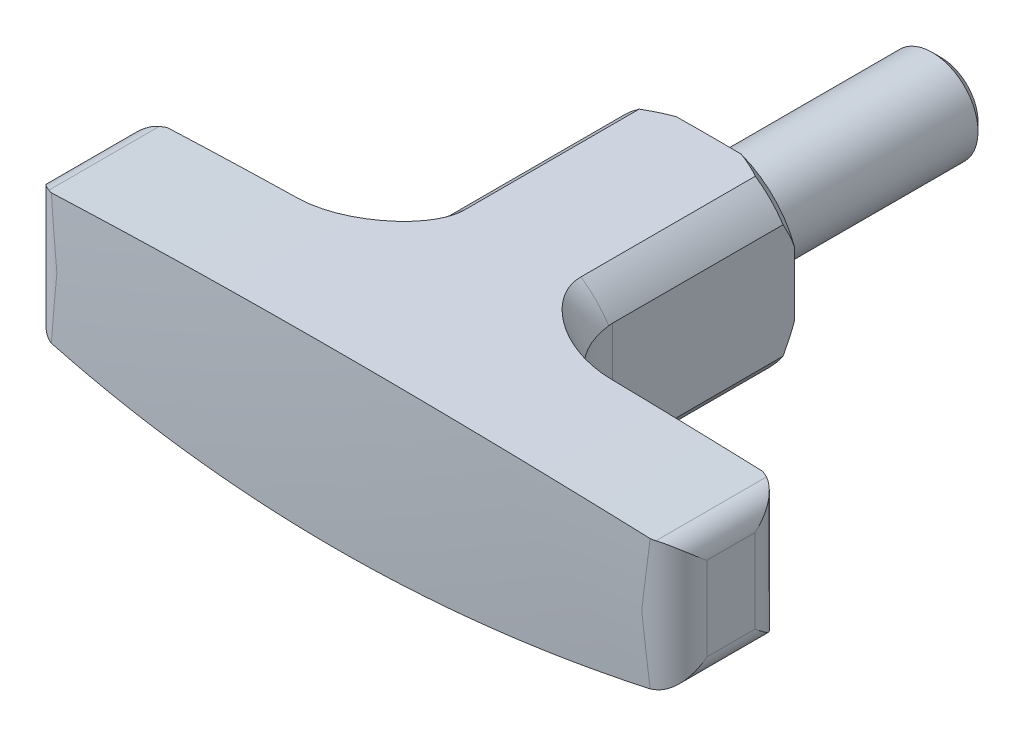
ISO-10303-21;
HEADER;
FILE_DESCRIPTION(('STEP AP214'),'2;1');
FILE_NAME('part.step','',(''),(''),'','','');
FILE_SCHEMA(('AUTOMOTIVE_DESIGN { 1 0 10303 214 1 1 1 1 }'));
ENDSEC;
DATA;
#1=APPLICATION_CONTEXT('core data for automotive mechanical design processes');
#2=APPLICATION_PROTOCOL_DEFINITION('international standard','automotive_design',2000,#1);
#3=PRODUCT_CONTEXT('',#1,'mechanical');
#4=PRODUCT('Part','Part','',(#3));
#5=PRODUCT_RELATED_PRODUCT_CATEGORY('part','',(#4));
#6=PRODUCT_DEFINITION_FORMATION('','',#4);
#7=PRODUCT_DEFINITION_CONTEXT('part definition',#1,'design');
#8=PRODUCT_DEFINITION('design','',#6,#7);
#9=PRODUCT_DEFINITION_SHAPE('','',#8);
#10=(LENGTH_UNIT() NAMED_UNIT(*) SI_UNIT(.MILLI.,.METRE.));
#11=(NAMED_UNIT(*) PLANE_ANGLE_UNIT() SI_UNIT($,.RADIAN.));
#12=(NAMED_UNIT(*) SI_UNIT($,.STERADIAN.) SOLID_ANGLE_UNIT());
#13=UNCERTAINTY_MEASURE_WITH_UNIT(LENGTH_MEASURE(1.E-05),#10,'distance_accuracy_value','');
#14=(GEOMETRIC_REPRESENTATION_CONTEXT(3) GLOBAL_UNCERTAINTY_ASSIGNED_CONTEXT((#13)) GLOBAL_UNIT_ASSIGNED_CONTEXT((#10,
#11,#12)) REPRESENTATION_CONTEXT('',''));
#15=CARTESIAN_POINT('',(0.,0.,0.));
#16=DIRECTION('',(0.,0.,1.));
#17=DIRECTION('',(1.,0.,0.));
#18=AXIS2_PLACEMENT_3D('',#15,#16,#17);
#19=CARTESIAN_POINT('',(-9.92261828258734E-13,0.,-229.835000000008));
#20=DIRECTION('',(0.,0.,-1.));
#21=DIRECTION('',(1.,0.,0.));
#22=AXIS2_PLACEMENT_3D('',#19,#20,#21);
#23=SPHERICAL_SURFACE('',#22,252.835000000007);
#24=CARTESIAN_POINT('',(-25.2498,-10.8950721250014,21.5000000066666));
#25=CARTESIAN_POINT('',(-25.2713311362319,-10.844823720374,21.500015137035));
#26=CARTESIAN_POINT('',(-25.2910180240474,-10.7938554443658,21.50022893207));
#27=CARTESIAN_POINT('',(-25.3275880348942,-10.6909777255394,21.5009434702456));
#28=CARTESIAN_POINT('',(-25.3444741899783,-10.6390693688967,21.5014439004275));
#29=CARTESIAN_POINT('',(-25.376335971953,-10.5348114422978,21.5026205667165));
#30=CARTESIAN_POINT('',(-25.3913156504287,-10.4824630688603,21.5032964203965));
#31=CARTESIAN_POINT('',(-25.4198241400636,-10.3773580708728,21.5047763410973));
#32=CARTESIAN_POINT('',(-25.4333524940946,-10.324601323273,21.5055804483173));
#33=CARTESIAN_POINT('',(-25.4721360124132,-10.1663138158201,21.508122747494));
#34=CARTESIAN_POINT('',(-25.4957036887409,-10.0603737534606,21.5099959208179));
#35=CARTESIAN_POINT('',(-25.5397410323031,-9.84780192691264,21.5139435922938));
#36=CARTESIAN_POINT('',(-25.5602087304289,-9.74116976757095,21.5160182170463));
#37=CARTESIAN_POINT('',(-25.5987530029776,-9.52771283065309,21.5202774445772));
#38=CARTESIAN_POINT('',(-25.61683455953,-9.42088894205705,21.5224618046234));
#39=CARTESIAN_POINT('',(-25.6511392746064,-9.20697378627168,21.5268898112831));
#40=CARTESIAN_POINT('',(-25.6673628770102,-9.09988258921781,21.5291334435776));
#41=CARTESIAN_POINT('',(-25.7138064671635,-8.77802255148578,21.5359027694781));
#42=CARTESIAN_POINT('',(-25.7417542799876,-8.56292685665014,21.5404615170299));
#43=CARTESIAN_POINT('',(-25.7967800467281,-8.10280288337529,21.5501004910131));
#44=CARTESIAN_POINT('',(-25.8232176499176,-7.85769952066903,21.5551668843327));
#45=CARTESIAN_POINT('',(-25.8717540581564,-7.36705401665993,21.565033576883));
#46=CARTESIAN_POINT('',(-25.8938526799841,-7.12151185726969,21.5698338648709));
#47=CARTESIAN_POINT('',(-25.9549471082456,-6.38437710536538,21.5836964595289));
#48=CARTESIAN_POINT('',(-25.9887340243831,-5.89234313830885,21.5922190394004));
#49=CARTESIAN_POINT('',(-26.0461474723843,-4.90774656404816,21.6074241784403));
#50=CARTESIAN_POINT('',(-26.0697752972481,-4.41518403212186,21.6141069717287));
#51=CARTESIAN_POINT('',(-26.1086786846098,-3.42975444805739,21.6254423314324));
#52=CARTESIAN_POINT('',(-26.123955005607,-2.93688742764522,21.6300950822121));
#53=CARTESIAN_POINT('',(-26.1472170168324,-1.94848067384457,21.6372833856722));
#54=CARTESIAN_POINT('',(-26.1551655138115,-1.45294000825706,21.639808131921));
#55=CARTESIAN_POINT('',(-26.1641023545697,-0.461781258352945,21.6426518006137));
#56=CARTESIAN_POINT('',(-26.1650905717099,0.0338368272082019,21.642970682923));
#57=CARTESIAN_POINT('',(-26.1601606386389,1.02516039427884,21.6413965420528));
#58=CARTESIAN_POINT('',(-26.1542407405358,1.52086586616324,21.639502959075));
#59=CARTESIAN_POINT('',(-26.135156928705,2.51212333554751,21.6335383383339));
#60=CARTESIAN_POINT('',(-26.1219931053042,3.007675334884,21.6294673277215));
#61=CARTESIAN_POINT('',(-26.093954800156,3.81472595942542,21.6211350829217));
#62=CARTESIAN_POINT('',(-26.0815257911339,4.12631712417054,21.6175044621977));
#63=CARTESIAN_POINT('',(-26.0531038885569,4.74929398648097,21.6094559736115));
#64=CARTESIAN_POINT('',(-26.037111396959,5.06067970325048,21.6050381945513));
#65=CARTESIAN_POINT('',(-26.0010581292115,5.68286120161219,21.5954760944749));
#66=CARTESIAN_POINT('',(-25.9810018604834,5.99365725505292,21.5903325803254));
#67=CARTESIAN_POINT('',(-25.9360183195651,6.61500354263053,21.579396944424));
#68=CARTESIAN_POINT('',(-25.9110893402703,6.92555365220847,21.573604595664));
#69=CARTESIAN_POINT('',(-25.8691604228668,7.38996807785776,21.5645546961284));
#70=CARTESIAN_POINT('',(-25.8544823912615,7.5440465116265,21.5614882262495));
#71=CARTESIAN_POINT('',(-25.8233592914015,7.85201126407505,21.5552568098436));
#72=CARTESIAN_POINT('',(-25.8069143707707,8.00589759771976,21.5520918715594));
#73=CARTESIAN_POINT('',(-25.7719532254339,8.31327530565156,21.5457013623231));
#74=CARTESIAN_POINT('',(-25.7534391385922,8.46676692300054,21.5424758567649));
#75=CARTESIAN_POINT('',(-25.7138616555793,8.77346999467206,21.5360100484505));
#76=CARTESIAN_POINT('',(-25.6927975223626,8.92668135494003,21.532769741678));
#77=CARTESIAN_POINT('',(-25.6473289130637,9.23325880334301,21.5263391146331));
#78=CARTESIAN_POINT('',(-25.6229110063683,9.38662291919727,21.5231490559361));
#79=CARTESIAN_POINT('',(-25.5696915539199,9.69249476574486,21.5169598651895));
#80=CARTESIAN_POINT('',(-25.5408934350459,9.84500307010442,21.5139605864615));
#81=CARTESIAN_POINT('',(-25.4926565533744,10.0730244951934,21.5097869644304));
#82=CARTESIAN_POINT('',(-25.4756994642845,10.1490562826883,21.5084476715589));
#83=CARTESIAN_POINT('',(-25.4395890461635,10.3005659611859,21.5059416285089));
#84=CARTESIAN_POINT('',(-25.4204367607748,10.376044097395,21.504774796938));
#85=CARTESIAN_POINT('',(-25.3790551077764,10.5264044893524,21.5027044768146));
#86=CARTESIAN_POINT('',(-25.356817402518,10.6012845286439,21.5018017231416));
#87=CARTESIAN_POINT('',(-25.3199675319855,10.7125292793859,21.5007907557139));
#88=CARTESIAN_POINT('',(-25.3070905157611,10.7494602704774,21.5005108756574));
#89=CARTESIAN_POINT('',(-25.2797442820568,10.8227533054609,21.5001175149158));
#90=CARTESIAN_POINT('',(-25.2652740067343,10.8591149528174,21.5000041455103));
#91=CARTESIAN_POINT('',(-25.2498,10.8950721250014,21.5000000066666));
#92=B_SPLINE_CURVE_WITH_KNOTS('',3,(#24,#25,#26,#27,#28,#29,#30,#31,#32,#33,#34,#35,#36,#37,#38,
#39,#40,#41,#42,#43,#44,#45,#46,#47,#48,#49,#50,#51,#52,#53,#54,#55,#56,#57,#58,#59,#60,#61,#62,
#63,#64,#65,#66,#67,#68,#69,#70,#71,#72,#73,#74,#75,#76,#77,#78,#79,#80,#81,#82,#83,#84,#85,#86,
#87,#88,#89,#90,#91),.UNSPECIFIED.,.F.,.F.,(4,2,2,2,2,2,2,2,2,2,2,2,2,2,2,2,2,2,2,2,2,2,2,2,2,2,
2,2,2,2,2,2,2,4),(0.,0.163873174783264,0.327567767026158,0.490908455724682,0.654300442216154,
0.979860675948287,1.30562684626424,1.63070169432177,1.95569871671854,2.60648297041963,
3.34616696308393,4.08588218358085,5.56551452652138,7.04495849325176,8.5242680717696,
10.0110453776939,11.4978497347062,12.9850303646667,14.4721924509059,15.4077551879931,
16.3432124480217,17.2776377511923,18.2123910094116,18.6768021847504,19.1411745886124,
19.6050715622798,20.0691029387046,20.5350499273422,21.0006342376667,21.2343434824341,
21.4679420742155,21.7021846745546,21.8194906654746,21.9368750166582),.UNSPECIFIED.);
#93=CARTESIAN_POINT('',(-25.9984396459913,-5.71347822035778,21.5948600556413));
#94=VERTEX_POINT('',#93);
#95=CARTESIAN_POINT('',(-25.9984396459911,5.71347822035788,21.5948600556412));
#96=VERTEX_POINT('',#95);
#97=EDGE_CURVE('E362',#94,#96,#92,.T.);
#98=ORIENTED_EDGE('',*,*,#97,.T.);
#99=CARTESIAN_POINT('',(-26.5293588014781,5.63940310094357,21.5410678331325));
#100=CARTESIAN_POINT('',(-25.4640024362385,5.78957881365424,21.6501338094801));
#101=CARTESIAN_POINT('',(-24.3967092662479,5.93079648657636,21.7526249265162));
#102=CARTESIAN_POINT('',(-22.2591784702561,6.19514454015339,21.9443769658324));
#103=CARTESIAN_POINT('',(-21.1889423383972,6.31828281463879,22.033643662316));
#104=CARTESIAN_POINT('',(-19.045520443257,6.54643263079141,22.1989620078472));
#105=CARTESIAN_POINT('',(-17.9723346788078,6.65144416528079,22.2750136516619));
#106=CARTESIAN_POINT('',(-15.8230106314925,6.84329292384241,22.413901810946));
#107=CARTESIAN_POINT('',(-14.7468712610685,6.93012216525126,22.4767325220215));
#108=CARTESIAN_POINT('',(-13.6697239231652,7.00779043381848,22.5329194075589));
#109=B_SPLINE_CURVE_WITH_KNOTS('',3,(#99,#100,#101,#102,#103,#104,#105,#106,#107,#108),
.UNSPECIFIED.,.F.,.F.,(4,2,2,2,4),(0.,3.24415139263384,6.48688208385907,9.72961405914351,
12.9737667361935),.UNSPECIFIED.);
#110=CARTESIAN_POINT('',(-13.6735574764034,7.00751396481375,22.532719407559));
#111=VERTEX_POINT('',#110);
#112=EDGE_CURVE('E351',#96,#111,#109,.T.);
#113=ORIENTED_EDGE('',*,*,#112,.T.);
#114=CARTESIAN_POINT('',(0.,0.,22.532719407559));
#115=DIRECTION('',(0.,0.,-1.));
#116=DIRECTION('',(0.,1.,0.));
#117=AXIS2_PLACEMENT_3D('',#114,#115,#116);
#118=CIRCLE('',#117,15.3646160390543);
#119=CARTESIAN_POINT('',(-13.6735574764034,-7.00751396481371,22.532719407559));
#120=VERTEX_POINT('',#119);
#121=EDGE_CURVE('E535',#120,#111,#118,.T.);
#122=ORIENTED_EDGE('',*,*,#121,.F.);
#123=CARTESIAN_POINT('',(-13.6697239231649,-7.00779043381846,22.532919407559));
#124=CARTESIAN_POINT('',(-14.7468712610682,-6.93012216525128,22.4767325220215));
#125=CARTESIAN_POINT('',(-15.8230106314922,-6.84329292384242,22.413901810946));
#126=CARTESIAN_POINT('',(-17.9723346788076,-6.65144416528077,22.275013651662));
#127=CARTESIAN_POINT('',(-19.0455204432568,-6.54643263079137,22.1989620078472));
#128=CARTESIAN_POINT('',(-21.1889423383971,-6.31828281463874,22.033643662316));
#129=CARTESIAN_POINT('',(-22.259178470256,-6.19514454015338,21.9443769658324));
#130=CARTESIAN_POINT('',(-24.3967092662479,-5.93079648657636,21.7526249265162));
#131=CARTESIAN_POINT('',(-25.4640024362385,-5.78957881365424,21.6501338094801));
#132=CARTESIAN_POINT('',(-26.5293588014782,-5.6394031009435,21.5410678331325));
#133=B_SPLINE_CURVE_WITH_KNOTS('',3,(#123,#124,#125,#126,#127,#128,#129,#130,#131,#132),
.UNSPECIFIED.,.F.,.F.,(4,2,2,2,4),(0.,3.24415267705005,6.4868846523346,9.72961534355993,
12.9737667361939),.UNSPECIFIED.);
#134=EDGE_CURVE('E327',#120,#94,#133,.T.);
#135=ORIENTED_EDGE('',*,*,#134,.T.);
#136=EDGE_LOOP('',(#98,#113,#122,#135));
#137=FACE_BOUND('',#136,.T.);
#138=ADVANCED_FACE('F14',(#137),#23,.F.);
#139=CARTESIAN_POINT('',(0.,0.,16.5438083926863));
#140=DIRECTION('',(0.,0.,-1.));
#141=DIRECTION('',(0.,1.,0.));
#142=AXIS2_PLACEMENT_3D('',#139,#140,#141);
#143=TOROIDAL_SURFACE('',#142,15.,6.);
#144=ORIENTED_EDGE('',*,*,#121,.T.);
#145=CARTESIAN_POINT('',(-15.3648160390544,6.87793772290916,22.2566395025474));
#146=CARTESIAN_POINT('',(-15.1174601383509,6.89800716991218,22.3265203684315));
#147=CARTESIAN_POINT('',(-14.866524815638,6.91786447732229,22.3832956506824));
#148=CARTESIAN_POINT('',(-14.3604248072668,6.95688789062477,22.4713471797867));
#149=CARTESIAN_POINT('',(-14.1052649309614,6.97605471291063,22.5026506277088));
#150=CARTESIAN_POINT('',(-13.5951706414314,7.01332327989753,22.5404636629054));
#151=CARTESIAN_POINT('',(-13.3402510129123,7.03143236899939,22.5471712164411));
#152=CARTESIAN_POINT('',(-12.8307656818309,7.06659241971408,22.5373328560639));
#153=CARTESIAN_POINT('',(-12.5762000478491,7.08364319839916,22.5207829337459));
#154=CARTESIAN_POINT('',(-12.1002489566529,7.11456655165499,22.4688686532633));
#155=CARTESIAN_POINT('',(-11.8785912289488,7.12857353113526,22.4360354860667));
#156=CARTESIAN_POINT('',(-11.4383507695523,7.15562904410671,22.3540590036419));
#157=CARTESIAN_POINT('',(-11.2197675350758,7.16867773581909,22.3049183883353));
#158=CARTESIAN_POINT('',(-10.5690963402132,7.20640662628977,22.1338826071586));
#159=CARTESIAN_POINT('',(-10.142824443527,7.22962194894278,21.9884579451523));
#160=CARTESIAN_POINT('',(-9.48727152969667,7.26322443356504,21.7135548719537));
#161=CARTESIAN_POINT('',(-9.24994355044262,7.27492511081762,21.6026975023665));
#162=CARTESIAN_POINT('',(-8.78457111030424,7.29702797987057,21.3625666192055));
#163=CARTESIAN_POINT('',(-8.55652896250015,7.30742984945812,21.2332885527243));
#164=CARTESIAN_POINT('',(-8.11153583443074,7.32696094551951,20.9571177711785));
#165=CARTESIAN_POINT('',(-7.89457799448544,7.33609096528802,20.8102361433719));
#166=CARTESIAN_POINT('',(-7.47348291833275,7.35312866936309,20.4991283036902));
#167=CARTESIAN_POINT('',(-7.26933986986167,7.36103691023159,20.3349100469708));
#168=CARTESIAN_POINT('',(-6.95067084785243,7.37290407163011,20.0542969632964));
#169=CARTESIAN_POINT('',(-6.83141340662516,7.37722665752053,19.9432595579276));
#170=CARTESIAN_POINT('',(-6.59975825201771,7.38541676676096,19.7142425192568));
#171=CARTESIAN_POINT('',(-6.48735899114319,7.38928439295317,19.5962644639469));
#172=CARTESIAN_POINT('',(-6.27061503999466,7.39656286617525,19.353179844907));
#173=CARTESIAN_POINT('',(-6.16626698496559,7.39997390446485,19.2280762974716));
#174=CARTESIAN_POINT('',(-5.96716491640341,7.4063322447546,18.9704360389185));
#175=CARTESIAN_POINT('',(-5.87240784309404,7.40927969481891,18.8379017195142));
#176=CARTESIAN_POINT('',(-5.72006328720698,7.41391762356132,18.6042155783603));
#177=CARTESIAN_POINT('',(-5.65960006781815,7.41572640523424,18.5049396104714));
#178=CARTESIAN_POINT('',(-5.54559770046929,7.41908833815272,18.3024219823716));
#179=CARTESIAN_POINT('',(-5.49206026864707,7.42064142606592,18.1991793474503));
#180=CARTESIAN_POINT('',(-5.39327191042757,7.42347143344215,17.9892854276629));
#181=CARTESIAN_POINT('',(-5.3479884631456,7.4247494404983,17.8826495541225));
#182=CARTESIAN_POINT('',(-5.26672367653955,7.42701957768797,17.6659317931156));
#183=CARTESIAN_POINT('',(-5.23073530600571,7.42801192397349,17.5558525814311));
#184=CARTESIAN_POINT('',(-5.17989407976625,7.42940340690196,17.3713174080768));
#185=CARTESIAN_POINT('',(-5.16203380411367,7.42988906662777,17.2976825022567));
#186=CARTESIAN_POINT('',(-5.13113540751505,7.43072603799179,17.1494175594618));
#187=CARTESIAN_POINT('',(-5.11809603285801,7.43107738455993,17.0747877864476));
#188=CARTESIAN_POINT('',(-5.09702218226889,7.43164394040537,16.9242825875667));
#189=CARTESIAN_POINT('',(-5.08902375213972,7.43185816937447,16.8484020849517));
#190=CARTESIAN_POINT('',(-5.07832091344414,7.43214441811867,16.6962202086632));
#191=CARTESIAN_POINT('',(-5.07561994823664,7.43221634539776,16.6199185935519));
#192=CARTESIAN_POINT('',(-5.07564444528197,7.43221592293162,16.5436083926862));
#193=B_SPLINE_CURVE_WITH_KNOTS('',3,(#145,#146,#147,#148,#149,#150,#151,#152,#153,#154,#155,
#156,#157,#158,#159,#160,#161,#162,#163,#164,#165,#166,#167,#168,#169,#170,#171,#172,#173,#174,
#175,#176,#177,#178,#179,#180,#181,#182,#183,#184,#185,#186,#187,#188,#189,#190,#191,#192),
.UNSPECIFIED.,.F.,.F.,(4,2,2,2,2,2,2,2,2,2,2,2,2,2,2,2,2,2,2,2,2,2,2,4),(0.,0.772911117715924,
1.54499576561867,2.31085228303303,3.07684081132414,3.74973077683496,4.42250939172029,
5.77027809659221,6.55624635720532,7.34240921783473,8.12807950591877,8.91339083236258,
9.40215808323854,9.89081463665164,10.379265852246,10.8675607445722,11.2160882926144,
11.5647020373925,11.9119110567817,12.2588566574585,12.4860295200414,12.7131432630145,
12.941863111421,13.1707315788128),.UNSPECIFIED.);
#194=CARTESIAN_POINT('',(-5.07564443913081,7.43221592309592,16.5438083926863));
#195=VERTEX_POINT('',#194);
#196=EDGE_CURVE('E478',#111,#195,#193,.T.);
#197=ORIENTED_EDGE('',*,*,#196,.T.);
#198=CARTESIAN_POINT('',(0.,0.,16.5438083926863));
#199=DIRECTION('',(0.,0.,-1.));
#200=DIRECTION('',(0.,1.,0.));
#201=AXIS2_PLACEMENT_3D('',#198,#199,#200);
#202=CIRCLE('',#201,9.);
#203=CARTESIAN_POINT('',(-7.51059243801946,4.95893146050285,16.5438083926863));
#204=VERTEX_POINT('',#203);
#205=EDGE_CURVE('E544',#204,#195,#202,.T.);
#206=ORIENTED_EDGE('',*,*,#205,.F.);
#207=CARTESIAN_POINT('',(-7.51058054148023,-4.95894948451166,16.5436083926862));
#208=CARTESIAN_POINT('',(-7.520449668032,-4.94393890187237,16.709966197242));
#209=CARTESIAN_POINT('',(-7.53730546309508,-4.93090967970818,16.8760761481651));
#210=CARTESIAN_POINT('',(-7.58482718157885,-4.90831468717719,17.2065158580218));
#211=CARTESIAN_POINT('',(-7.61549044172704,-4.89874824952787,17.3708459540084));
#212=CARTESIAN_POINT('',(-7.69040149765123,-4.88258846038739,17.69621855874));
#213=CARTESIAN_POINT('',(-7.73462516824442,-4.87598987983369,17.8572663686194));
#214=CARTESIAN_POINT('',(-7.83636765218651,-4.8651022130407,18.1751842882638));
#215=CARTESIAN_POINT('',(-7.89388653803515,-4.86081313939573,18.3320543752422));
#216=CARTESIAN_POINT('',(-8.0218134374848,-4.85378236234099,18.6404694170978));
#217=CARTESIAN_POINT('',(-8.09222064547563,-4.85104056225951,18.7920147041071));
#218=CARTESIAN_POINT('',(-8.24543304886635,-4.84618055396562,19.0887179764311));
#219=CARTESIAN_POINT('',(-8.3282385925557,-4.84406236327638,19.2338757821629));
#220=CARTESIAN_POINT('',(-8.50569258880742,-4.83931872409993,19.5168252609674));
#221=CARTESIAN_POINT('',(-8.60034531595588,-4.83669309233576,19.6546142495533));
#222=CARTESIAN_POINT('',(-8.80077973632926,-4.82952356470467,19.9217694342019));
#223=CARTESIAN_POINT('',(-8.90655922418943,-4.82498004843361,20.0511372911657));
#224=CARTESIAN_POINT('',(-9.10771117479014,-4.8133436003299,20.2772131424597));
#225=CARTESIAN_POINT('',(-9.20134040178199,-4.80688488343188,20.3755098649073));
#226=CARTESIAN_POINT('',(-9.39487039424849,-4.79021742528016,20.5653723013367));
#227=CARTESIAN_POINT('',(-9.49476995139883,-4.78000940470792,20.6569393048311));
#228=CARTESIAN_POINT('',(-9.70001531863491,-4.75424638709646,20.8326921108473));
#229=CARTESIAN_POINT('',(-9.80535422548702,-4.7386980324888,20.9168869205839));
#230=CARTESIAN_POINT('',(-10.020579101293,-4.7001940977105,21.0773923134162));
#231=CARTESIAN_POINT('',(-10.1304626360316,-4.67724243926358,21.1537070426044));
#232=CARTESIAN_POINT('',(-10.3114743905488,-4.63183770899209,21.2707671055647));
#233=CARTESIAN_POINT('',(-10.381686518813,-4.61242408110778,21.3141207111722));
#234=CARTESIAN_POINT('',(-10.5227535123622,-4.56897802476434,21.3973074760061));
#235=CARTESIAN_POINT('',(-10.593608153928,-4.5449471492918,21.4371418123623));
#236=CARTESIAN_POINT('',(-10.7351791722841,-4.49157490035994,21.5130598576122));
#237=CARTESIAN_POINT('',(-10.8058955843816,-4.46224235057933,21.5491496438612));
#238=CARTESIAN_POINT('',(-10.9464111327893,-4.39758597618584,21.6174771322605));
#239=CARTESIAN_POINT('',(-11.0162107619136,-4.36226552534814,21.6497169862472));
#240=CARTESIAN_POINT('',(-11.1548326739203,-4.28461847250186,21.7106654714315));
#241=CARTESIAN_POINT('',(-11.2236298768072,-4.2422055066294,21.7393218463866));
#242=CARTESIAN_POINT('',(-11.3581631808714,-4.15052086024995,21.7925977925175));
#243=CARTESIAN_POINT('',(-11.4238992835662,-4.1012491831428,21.8172173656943));
#244=CARTESIAN_POINT('',(-11.5512851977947,-3.99606212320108,21.8625707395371));
#245=CARTESIAN_POINT('',(-11.6129344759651,-3.94014587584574,21.8833040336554));
#246=CARTESIAN_POINT('',(-11.7313489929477,-3.82229933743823,21.9211789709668));
#247=CARTESIAN_POINT('',(-11.7881153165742,-3.76037038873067,21.9383214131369));
#248=CARTESIAN_POINT('',(-11.8998191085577,-3.62722285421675,21.9704358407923));
#249=CARTESIAN_POINT('',(-11.9544093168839,-3.55566374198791,21.9851998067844));
#250=CARTESIAN_POINT('',(-12.0575358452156,-3.40781695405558,22.0117117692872));
#251=CARTESIAN_POINT('',(-12.1060712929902,-3.33152859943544,22.0234593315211));
#252=CARTESIAN_POINT('',(-12.2431499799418,-3.09679743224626,22.055086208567));
#253=CARTESIAN_POINT('',(-12.322966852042,-2.93273394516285,22.0712962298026));
#254=CARTESIAN_POINT('',(-12.4534206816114,-2.6186810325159,22.0957741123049));
#255=CARTESIAN_POINT('',(-12.5065267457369,-2.46972209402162,22.1048115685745));
#256=CARTESIAN_POINT('',(-12.6002734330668,-2.16768563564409,22.1197893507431));
#257=CARTESIAN_POINT('',(-12.640904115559,-2.01460493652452,22.1257272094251));
#258=CARTESIAN_POINT('',(-12.7115554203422,-1.70540696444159,22.1355190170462));
#259=CARTESIAN_POINT('',(-12.7415362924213,-1.54928056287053,22.1393651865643));
#260=CARTESIAN_POINT('',(-12.7919695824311,-1.23545164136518,22.1455730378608));
#261=CARTESIAN_POINT('',(-12.8124192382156,-1.07774867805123,22.1479342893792));
#262=CARTESIAN_POINT('',(-12.8540166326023,-0.669377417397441,22.1526246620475));
#263=CARTESIAN_POINT('',(-12.8686437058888,-0.418021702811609,22.154135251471));
#264=CARTESIAN_POINT('',(-12.877643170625,0.0852629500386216,22.1550773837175));
#265=CARTESIAN_POINT('',(-12.8719955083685,0.337192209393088,22.1545068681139));
#266=CARTESIAN_POINT('',(-12.8399169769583,0.838684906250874,22.1510446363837));
#267=CARTESIAN_POINT('',(-12.8135731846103,1.08825383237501,22.1481626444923));
#268=CARTESIAN_POINT('',(-12.7376558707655,1.58358291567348,22.1389444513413));
#269=CARTESIAN_POINT('',(-12.68811837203,1.82934837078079,22.1326136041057));
#270=CARTESIAN_POINT('',(-12.575982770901,2.25442959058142,22.1160619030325));
#271=CARTESIAN_POINT('',(-12.5194801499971,2.43538525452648,22.1071595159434));
#272=CARTESIAN_POINT('',(-12.3862994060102,2.78974541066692,22.0835713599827));
#273=CARTESIAN_POINT('',(-12.3096189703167,2.96314903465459,22.0688849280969));
#274=CARTESIAN_POINT('',(-12.1756425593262,3.21424337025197,22.039634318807));
#275=CARTESIAN_POINT('',(-12.1273074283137,3.2971349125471,22.0285487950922));
#276=CARTESIAN_POINT('',(-12.0239316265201,3.45817059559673,22.0032883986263));
#277=CARTESIAN_POINT('',(-11.9688915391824,3.53631514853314,21.9891137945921));
#278=CARTESIAN_POINT('',(-11.8522121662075,3.68626806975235,21.9570542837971));
#279=CARTESIAN_POINT('',(-11.790597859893,3.75809865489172,21.9391831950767));
#280=CARTESIAN_POINT('',(-11.6610633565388,3.89444538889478,21.8990898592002));
#281=CARTESIAN_POINT('',(-11.5931450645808,3.95896373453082,21.8768689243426));
#282=CARTESIAN_POINT('',(-11.4023161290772,4.12201415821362,21.8102346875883));
#283=CARTESIAN_POINT('',(-11.2742010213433,4.21272750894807,21.7611772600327));
#284=CARTESIAN_POINT('',(-11.0095172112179,4.36930486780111,21.6480478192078));
#285=CARTESIAN_POINT('',(-10.8729275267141,4.43510408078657,21.5839373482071));
#286=CARTESIAN_POINT('',(-10.6456610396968,4.52677334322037,21.4660014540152));
#287=CARTESIAN_POINT('',(-10.555209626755,4.55860815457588,21.4161228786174));
#288=CARTESIAN_POINT('',(-10.3752785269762,4.61472114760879,21.3106219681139));
#289=CARTESIAN_POINT('',(-10.2857992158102,4.63899650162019,21.2549974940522));
#290=CARTESIAN_POINT('',(-10.1087736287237,4.68147331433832,21.1382860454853));
#291=CARTESIAN_POINT('',(-10.0212313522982,4.69966313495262,21.077188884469));
#292=CARTESIAN_POINT('',(-9.84897422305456,4.73121430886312,20.949950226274));
#293=CARTESIAN_POINT('',(-9.76426023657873,4.74457419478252,20.8838072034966));
#294=CARTESIAN_POINT('',(-9.55970904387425,4.77289500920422,20.7150147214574));
#295=CARTESIAN_POINT('',(-9.44180066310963,4.78572561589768,20.609659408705));
#296=CARTESIAN_POINT('',(-9.2144338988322,4.80610193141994,20.389699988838));
#297=CARTESIAN_POINT('',(-9.10497882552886,4.8136455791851,20.2750922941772));
#298=CARTESIAN_POINT('',(-8.89541553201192,4.82545472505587,20.0374926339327));
#299=CARTESIAN_POINT('',(-8.79530666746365,4.82972044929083,19.9145012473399));
#300=CARTESIAN_POINT('',(-8.60508015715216,4.83652261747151,19.6608983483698));
#301=CARTESIAN_POINT('',(-8.51496696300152,4.83905829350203,19.5302834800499));
#302=CARTESIAN_POINT('',(-8.34375631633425,4.84365844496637,19.2597788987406));
#303=CARTESIAN_POINT('',(-8.26286215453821,4.8457130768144,19.1197603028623));
#304=CARTESIAN_POINT('',(-8.11267204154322,4.85032577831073,18.833718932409));
#305=CARTESIAN_POINT('',(-8.04337119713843,4.85288363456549,18.6876987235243));
#306=CARTESIAN_POINT('',(-7.91682917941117,4.85935314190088,18.3906757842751));
#307=CARTESIAN_POINT('',(-7.85957913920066,4.86326379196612,18.2396768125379));
#308=CARTESIAN_POINT('',(-7.75746428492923,4.87314210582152,17.9336672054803));
#309=CARTESIAN_POINT('',(-7.71259569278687,4.8791091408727,17.7786578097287));
#310=CARTESIAN_POINT('',(-7.63044870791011,4.89465822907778,17.4450549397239));
#311=CARTESIAN_POINT('',(-7.59494262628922,4.90461229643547,17.2660391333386));
#312=CARTESIAN_POINT('',(-7.54039097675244,4.92857602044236,16.9059788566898));
#313=CARTESIAN_POINT('',(-7.52132832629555,4.94258144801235,16.7249366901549));
#314=CARTESIAN_POINT('',(-7.51058054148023,4.95894948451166,16.5436083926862));
#315=B_SPLINE_CURVE_WITH_KNOTS('',3,(#207,#208,#209,#210,#211,#212,#213,#214,#215,#216,#217,
#218,#219,#220,#221,#222,#223,#224,#225,#226,#227,#228,#229,#230,#231,#232,#233,#234,#235,#236,
#237,#238,#239,#240,#241,#242,#243,#244,#245,#246,#247,#248,#249,#250,#251,#252,#253,#254,#255,
#256,#257,#258,#259,#260,#261,#262,#263,#264,#265,#266,#267,#268,#269,#270,#271,#272,#273,#274,
#275,#276,#277,#278,#279,#280,#281,#282,#283,#284,#285,#286,#287,#288,#289,#290,#291,#292,#293,
#294,#295,#296,#297,#298,#299,#300,#301,#302,#303,#304,#305,#306,#307,#308,#309,#310,#311,#312,
#313,#314),.UNSPECIFIED.,.F.,.F.,(4,2,2,2,2,2,2,2,2,2,2,2,2,2,2,2,2,2,2,2,2,2,2,2,2,2,2,2,2,2,2,
2,2,2,2,2,2,2,2,2,2,2,2,2,2,2,2,2,2,2,2,2,2,4),(0.,0.501802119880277,1.00350749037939,
1.50432541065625,2.00514606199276,2.50593541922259,3.00673884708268,3.50772349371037,
4.00860902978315,4.41599502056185,4.82330274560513,5.23010567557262,5.63669346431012,
5.89083912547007,6.14489945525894,6.39854077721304,6.65203966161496,6.90888627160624,
7.16573275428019,7.4226126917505,7.67943541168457,7.95262969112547,8.22586328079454,
8.77327913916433,9.24788464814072,9.72286735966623,10.1996047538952,10.6764802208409,
11.430900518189,12.1860672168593,12.9380735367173,13.6889157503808,14.257371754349,
14.8258929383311,15.1153473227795,15.4047765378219,15.6931427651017,15.9814221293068,
16.471570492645,16.9629849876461,17.2868386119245,17.6108132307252,17.9354039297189,
18.2600931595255,18.7353441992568,19.210780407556,19.686183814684,20.161798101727,
20.6464284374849,21.1308537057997,21.6149212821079,22.0988409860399,22.64635422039,
23.1932979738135),.UNSPECIFIED.);
#316=CARTESIAN_POINT('',(-7.51059243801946,-4.95893146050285,16.5438083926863));
#317=VERTEX_POINT('',#316);
#318=EDGE_CURVE('E581',#317,#204,#315,.T.);
#319=ORIENTED_EDGE('',*,*,#318,.F.);
#320=CARTESIAN_POINT('',(-5.07564443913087,-7.43221592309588,16.5438083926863));
#321=VERTEX_POINT('',#320);
#322=EDGE_CURVE('E542',#321,#317,#202,.T.);
#323=ORIENTED_EDGE('',*,*,#322,.F.);
#324=CARTESIAN_POINT('',(-5.07564444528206,-7.43221592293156,16.5436083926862));
#325=CARTESIAN_POINT('',(-5.07557701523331,-7.43221700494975,16.6459869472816));
#326=CARTESIAN_POINT('',(-5.08046529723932,-7.4320871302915,16.7483304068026));
#327=CARTESIAN_POINT('',(-5.09967706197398,-7.43157281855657,16.9519710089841));
#328=CARTESIAN_POINT('',(-5.11398572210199,-7.43118878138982,17.0532695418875));
#329=CARTESIAN_POINT('',(-5.15131086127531,-7.43018031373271,17.2528135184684));
#330=CARTESIAN_POINT('',(-5.17420707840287,-7.42955920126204,17.3510817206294));
#331=CARTESIAN_POINT('',(-5.22798103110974,-7.42808715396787,17.5454328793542));
#332=CARTESIAN_POINT('',(-5.25886241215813,-7.42723611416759,17.6415148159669));
#333=CARTESIAN_POINT('',(-5.33944932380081,-7.42499086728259,17.8631538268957));
#334=CARTESIAN_POINT('',(-5.39198848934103,-7.42351031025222,17.9876809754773));
#335=CARTESIAN_POINT('',(-5.50790137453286,-7.4201852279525,18.2315598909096));
#336=CARTESIAN_POINT('',(-5.57127873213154,-7.41834058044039,18.3509099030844));
#337=CARTESIAN_POINT('',(-5.70753890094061,-7.41429596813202,18.5850442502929));
#338=CARTESIAN_POINT('',(-5.78048026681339,-7.41209379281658,18.6997942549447));
#339=CARTESIAN_POINT('',(-5.93409935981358,-7.40735748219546,18.9240064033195));
#340=CARTESIAN_POINT('',(-6.01478006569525,-7.4048232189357,19.03346648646));
#341=CARTESIAN_POINT('',(-6.23579777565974,-7.39772740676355,19.3148479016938));
#342=CARTESIAN_POINT('',(-6.38159233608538,-7.39289739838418,19.4824889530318));
#343=CARTESIAN_POINT('',(-6.68694977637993,-7.38239357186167,19.8047243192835));
#344=CARTESIAN_POINT('',(-6.84652108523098,-7.37671923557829,19.9593105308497));
#345=CARTESIAN_POINT('',(-7.17690233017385,-7.3645227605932,20.2557681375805));
#346=CARTESIAN_POINT('',(-7.3477083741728,-7.3580009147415,20.3976438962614));
#347=CARTESIAN_POINT('',(-7.69887099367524,-7.34409007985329,20.6688689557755));
#348=CARTESIAN_POINT('',(-7.87922563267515,-7.33670126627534,20.7982207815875));
#349=CARTESIAN_POINT('',(-8.25872936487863,-7.32058580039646,21.0513157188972));
#350=CARTESIAN_POINT('',(-8.4583644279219,-7.31180709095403,21.1743267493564));
#351=CARTESIAN_POINT('',(-8.86578165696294,-7.29322008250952,21.4059479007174));
#352=CARTESIAN_POINT('',(-9.07356425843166,-7.2834117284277,21.5145572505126));
#353=CARTESIAN_POINT('',(-9.49628447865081,-7.26273661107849,21.7168277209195));
#354=CARTESIAN_POINT('',(-9.71122336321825,-7.25186965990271,21.8104861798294));
#355=CARTESIAN_POINT('',(-10.147324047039,-7.22905615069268,21.9821636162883));
#356=CARTESIAN_POINT('',(-10.368488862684,-7.2171090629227,22.0601748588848));
#357=CARTESIAN_POINT('',(-10.8572609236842,-7.18982740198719,22.2125845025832));
#358=CARTESIAN_POINT('',(-11.12590359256,-7.17427465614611,22.283656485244));
#359=CARTESIAN_POINT('',(-11.6683213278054,-7.14169015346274,22.4011563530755));
#360=CARTESIAN_POINT('',(-11.9420938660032,-7.12465911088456,22.4475960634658));
#361=CARTESIAN_POINT('',(-12.4922598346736,-7.08922084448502,22.5143501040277));
#362=CARTESIAN_POINT('',(-12.7686477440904,-7.07081611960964,22.5347107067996));
#363=CARTESIAN_POINT('',(-13.321859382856,-7.03275615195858,22.5480452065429));
#364=CARTESIAN_POINT('',(-13.5986826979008,-7.01310175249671,22.5410373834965));
#365=CARTESIAN_POINT('',(-14.1263357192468,-6.97448007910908,22.5002506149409));
#366=CARTESIAN_POINT('',(-14.3773518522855,-6.95559928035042,22.4688279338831));
#367=CARTESIAN_POINT('',(-14.8750003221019,-6.9171933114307,22.3813718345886));
#368=CARTESIAN_POINT('',(-15.121632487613,-6.89766811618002,22.3253374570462));
#369=CARTESIAN_POINT('',(-15.3648160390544,-6.87793772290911,22.2566395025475));
#370=B_SPLINE_CURVE_WITH_KNOTS('',3,(#324,#325,#326,#327,#328,#329,#330,#331,#332,#333,#334,
#335,#336,#337,#338,#339,#340,#341,#342,#343,#344,#345,#346,#347,#348,#349,#350,#351,#352,#353,
#354,#355,#356,#357,#358,#359,#360,#361,#362,#363,#364,#365,#366,#367,#368,#369),.UNSPECIFIED.,
.F.,.F.,(4,2,2,2,2,2,2,2,2,2,2,2,2,2,2,2,2,2,2,2,2,2,4),(0.,0.306962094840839,0.613442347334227,
0.915781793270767,1.21825951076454,1.62310871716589,2.0280940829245,2.43568606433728,
2.84343555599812,3.50906959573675,4.17511381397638,4.84092849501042,5.50660865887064,
6.20997425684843,6.91337749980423,7.61690583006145,8.32078108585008,9.1546153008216,
9.98804885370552,10.8200015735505,11.6513987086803,12.4112327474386,13.1710964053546),.UNSPECIFIED.);
#371=EDGE_CURVE('E321',#321,#120,#370,.T.);
#372=ORIENTED_EDGE('',*,*,#371,.T.);
#373=EDGE_LOOP('',(#144,#197,#206,#319,#323,#372));
#374=FACE_BOUND('',#373,.T.);
#375=ADVANCED_FACE('F633',(#374),#143,.F.);
#376=CARTESIAN_POINT('',(0.,0.,0.));
#377=DIRECTION('',(0.,0.,-1.));
#378=DIRECTION('',(0.,1.,0.));
#379=AXIS2_PLACEMENT_3D('',#376,#377,#378);
#380=CYLINDRICAL_SURFACE('',#379,9.);
#381=ORIENTED_EDGE('',*,*,#205,.T.);
#382=DIRECTION('',(0.,0.,-1.));
#383=VECTOR('',#382,1.);
#384=CARTESIAN_POINT('',(-5.0756444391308,7.4322159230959,0.));
#385=LINE('',#384,#383);
#386=CARTESIAN_POINT('',(-5.07564443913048,7.43221592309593,1.29999999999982));
#387=VERTEX_POINT('',#386);
#388=EDGE_CURVE('E484',#195,#387,#385,.T.);
#389=ORIENTED_EDGE('',*,*,#388,.T.);
#390=CARTESIAN_POINT('',(0.,0.,1.3));
#391=DIRECTION('',(0.,0.,-1.));
#392=DIRECTION('',(0.,1.,0.));
#393=AXIS2_PLACEMENT_3D('',#390,#391,#392);
#394=CIRCLE('',#393,9.);
#395=CARTESIAN_POINT('',(-7.5,4.9749371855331,1.3));
#396=VERTEX_POINT('',#395);
#397=EDGE_CURVE('E606',#396,#387,#394,.T.);
#398=ORIENTED_EDGE('',*,*,#397,.F.);
#399=DIRECTION('',(0.,0.,-1.));
#400=VECTOR('',#399,1.);
#401=CARTESIAN_POINT('',(-7.5,4.9749371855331,0.));
#402=LINE('',#401,#400);
#403=CARTESIAN_POINT('',(-7.5,4.9749371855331,16.1874419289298));
#404=VERTEX_POINT('',#403);
#405=EDGE_CURVE('E636',#396,#404,#402,.F.);
#406=ORIENTED_EDGE('',*,*,#405,.T.);
#407=CARTESIAN_POINT('',(-7.51059243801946,4.95893146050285,16.5438083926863));
#408=CARTESIAN_POINT('',(-7.50706557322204,4.96426537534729,16.484586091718));
#409=CARTESIAN_POINT('',(-7.50441943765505,4.9682661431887,16.4252777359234));
#410=CARTESIAN_POINT('',(-7.50088862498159,4.97360138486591,16.3064889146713));
#411=CARTESIAN_POINT('',(-7.50000394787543,4.97493585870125,16.2470084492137));
#412=CARTESIAN_POINT('',(-7.5,4.9749371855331,16.1874419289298));
#413=B_SPLINE_CURVE_WITH_KNOTS('',3,(#407,#408,#409,#410,#411,#412),.UNSPECIFIED.,.F.,.F.,(4,2,
4),(0.,0.178506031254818,0.357012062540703),.UNSPECIFIED.);
#414=EDGE_CURVE('E560',#204,#404,#413,.T.);
#415=ORIENTED_EDGE('',*,*,#414,.F.);
#416=EDGE_LOOP('',(#381,#389,#398,#406,#415));
#417=FACE_BOUND('',#416,.T.);
#418=ADVANCED_FACE('F634',(#417),#380,.T.);
#419=CARTESIAN_POINT('',(7.51059243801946,-4.95893146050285,16.5438083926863));
#420=VERTEX_POINT('',#419);
#421=CARTESIAN_POINT('',(5.07564443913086,-7.43221592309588,16.5438083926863));
#422=VERTEX_POINT('',#421);
#423=EDGE_CURVE('E538',#420,#422,#202,.T.);
#424=ORIENTED_EDGE('',*,*,#423,.T.);
#425=DIRECTION('',(0.,0.,-1.));
#426=VECTOR('',#425,1.);
#427=CARTESIAN_POINT('',(5.07564443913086,-7.4322159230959,0.));
#428=LINE('',#427,#426);
#429=CARTESIAN_POINT('',(5.07564443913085,-7.43221592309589,1.3));
#430=VERTEX_POINT('',#429);
#431=EDGE_CURVE('E659',#422,#430,#428,.T.);
#432=ORIENTED_EDGE('',*,*,#431,.T.);
#433=CARTESIAN_POINT('',(7.5,-4.9749371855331,1.3));
#434=VERTEX_POINT('',#433);
#435=EDGE_CURVE('E609',#434,#430,#394,.T.);
#436=ORIENTED_EDGE('',*,*,#435,.F.);
#437=DIRECTION('',(0.,0.,-1.));
#438=VECTOR('',#437,1.);
#439=CARTESIAN_POINT('',(7.5,-4.9749371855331,0.));
#440=LINE('',#439,#438);
#441=CARTESIAN_POINT('',(7.5,-4.9749371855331,16.1874419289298));
#442=VERTEX_POINT('',#441);
#443=EDGE_CURVE('E661',#434,#442,#440,.F.);
#444=ORIENTED_EDGE('',*,*,#443,.T.);
#445=CARTESIAN_POINT('',(7.51059243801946,-4.95893146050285,16.5438083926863));
#446=CARTESIAN_POINT('',(7.50706557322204,-4.96426537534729,16.484586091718));
#447=CARTESIAN_POINT('',(7.50441943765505,-4.9682661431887,16.4252777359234));
#448=CARTESIAN_POINT('',(7.50088862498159,-4.97360138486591,16.3064889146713));
#449=CARTESIAN_POINT('',(7.50000394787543,-4.97493585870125,16.2470084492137));
#450=CARTESIAN_POINT('',(7.5,-4.9749371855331,16.1874419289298));
#451=B_SPLINE_CURVE_WITH_KNOTS('',3,(#445,#446,#447,#448,#449,#450),.UNSPECIFIED.,.F.,.F.,(4,2,
4),(0.,0.178506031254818,0.357012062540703),.UNSPECIFIED.);
#452=EDGE_CURVE('E637',#420,#442,#451,.T.);
#453=ORIENTED_EDGE('',*,*,#452,.F.);
#454=EDGE_LOOP('',(#424,#432,#436,#444,#453));
#455=FACE_BOUND('',#454,.T.);
#456=ADVANCED_FACE('F658',(#455),#380,.T.);
#457=CARTESIAN_POINT('',(0.,0.,1.3));
#458=DIRECTION('',(0.,0.,1.));
#459=DIRECTION('',(0.,-1.,0.));
#460=AXIS2_PLACEMENT_3D('',#457,#458,#459);
#461=CONICAL_SURFACE('',#460,9.,0.785398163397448);
#462=ORIENTED_EDGE('',*,*,#435,.T.);
#463=CARTESIAN_POINT('',(5.07601350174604,-7.43220606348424,1.3002));
#464=CARTESIAN_POINT('',(4.89621897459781,-7.43700890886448,1.20279250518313));
#465=CARTESIAN_POINT('',(4.71490221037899,-7.44159818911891,1.10810293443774));
#466=CARTESIAN_POINT('',(4.34930234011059,-7.45031841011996,0.925456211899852));
#467=CARTESIAN_POINT('',(4.16502498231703,-7.45445013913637,0.837487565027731));
#468=CARTESIAN_POINT('',(3.79289043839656,-7.46224236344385,0.669201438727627));
#469=CARTESIAN_POINT('',(3.60503204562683,-7.46590269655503,0.588886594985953));
#470=CARTESIAN_POINT('',(3.22535337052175,-7.47272628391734,0.437214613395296));
#471=CARTESIAN_POINT('',(3.03352671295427,-7.4758886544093,0.365873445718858));
#472=CARTESIAN_POINT('',(2.83982362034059,-7.47878344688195,0.29979999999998));
#473=B_SPLINE_CURVE_WITH_KNOTS('',3,(#463,#464,#465,#466,#467,#468,#469,#470,#471,#472),
.UNSPECIFIED.,.F.,.F.,(4,2,2,2,4),(0.,0.613657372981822,1.22624052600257,1.83903387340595,
2.45290280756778),.UNSPECIFIED.);
#474=CARTESIAN_POINT('',(2.84041004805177,-7.47877468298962,0.299999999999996));
#475=VERTEX_POINT('',#474);
#476=EDGE_CURVE('E305',#430,#475,#473,.T.);
#477=ORIENTED_EDGE('',*,*,#476,.T.);
#478=CARTESIAN_POINT('',(0.,0.,0.3));
#479=DIRECTION('',(0.,0.,-1.));
#480=DIRECTION('',(0.,1.,0.));
#481=AXIS2_PLACEMENT_3D('',#478,#479,#480);
#482=CIRCLE('',#481,8.);
#483=CARTESIAN_POINT('',(7.5,-2.78388218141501,0.3));
#484=VERTEX_POINT('',#483);
#485=EDGE_CURVE('E605',#484,#475,#482,.T.);
#486=ORIENTED_EDGE('',*,*,#485,.F.);
#487=CARTESIAN_POINT('',(7.5,18.3427832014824,12.116853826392));
#488=CARTESIAN_POINT('',(7.5,18.0676096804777,11.8621540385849));
#489=CARTESIAN_POINT('',(7.5,17.7920321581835,11.6078904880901));
#490=CARTESIAN_POINT('',(7.5,17.2399473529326,11.1003709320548));
#491=CARTESIAN_POINT('',(7.5,16.9634400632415,10.8471149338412));
#492=CARTESIAN_POINT('',(7.5,16.1322277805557,10.0889577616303));
#493=CARTESIAN_POINT('',(7.5,15.5759505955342,9.585777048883));
#494=CARTESIAN_POINT('',(7.5,14.4545876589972,8.5825595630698));
#495=CARTESIAN_POINT('',(7.5,13.8894692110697,8.08255922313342));
#496=CARTESIAN_POINT('',(7.5,13.0361890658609,7.33904552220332));
#497=CARTESIAN_POINT('',(7.5,12.7508436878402,7.09230150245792));
#498=CARTESIAN_POINT('',(7.5,12.1779334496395,6.60140794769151));
#499=CARTESIAN_POINT('',(7.5,11.8903685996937,6.35725840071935));
#500=CARTESIAN_POINT('',(7.5,11.1387792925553,5.72605395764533));
#501=CARTESIAN_POINT('',(7.5,10.6727067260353,5.34142049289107));
#502=CARTESIAN_POINT('',(7.5,9.96684692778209,4.77272122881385));
#503=CARTESIAN_POINT('',(7.5,9.73040218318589,4.58450464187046));
#504=CARTESIAN_POINT('',(7.5,9.25490338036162,4.21140053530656));
#505=CARTESIAN_POINT('',(7.5,9.01584937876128,4.02651294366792));
#506=CARTESIAN_POINT('',(7.5,8.53495973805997,3.66094903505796));
#507=CARTESIAN_POINT('',(7.5,8.29312751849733,3.48026822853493));
#508=CARTESIAN_POINT('',(7.5,7.80587666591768,3.12377539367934));
#509=CARTESIAN_POINT('',(7.5,7.56045789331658,2.94796355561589));
#510=CARTESIAN_POINT('',(7.5,7.06551064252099,2.60242917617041));
#511=CARTESIAN_POINT('',(7.5,6.81598394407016,2.43270409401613));
#512=CARTESIAN_POINT('',(7.5,6.31199187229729,2.10077901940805));
#513=CARTESIAN_POINT('',(7.5,6.05752705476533,1.93857818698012));
#514=CARTESIAN_POINT('',(7.5,5.54877417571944,1.62734404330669));
#515=CARTESIAN_POINT('',(7.5,5.29462088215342,1.4780916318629));
#516=CARTESIAN_POINT('',(7.5,4.77982503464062,1.19106608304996));
#517=CARTESIAN_POINT('',(7.5,4.51918175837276,1.0532942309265));
#518=CARTESIAN_POINT('',(7.5,3.99074563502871,0.792541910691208));
#519=CARTESIAN_POINT('',(7.5,3.722957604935,0.669551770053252));
#520=CARTESIAN_POINT('',(7.5,3.17947874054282,0.442372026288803));
#521=CARTESIAN_POINT('',(7.5,2.90379017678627,0.338177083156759));
#522=CARTESIAN_POINT('',(7.5,2.40582810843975,0.173726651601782));
#523=CARTESIAN_POINT('',(7.5,2.18509082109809,0.108846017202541));
#524=CARTESIAN_POINT('',(7.5,1.73929640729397,-0.00398177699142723));
#525=CARTESIAN_POINT('',(7.5,1.51423982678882,-0.0519310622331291));
#526=CARTESIAN_POINT('',(7.5,1.06157040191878,-0.128515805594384));
#527=CARTESIAN_POINT('',(7.5,0.833968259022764,-0.157213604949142));
#528=CARTESIAN_POINT('',(7.5,0.377088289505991,-0.193977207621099));
#529=CARTESIAN_POINT('',(7.5,0.147810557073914,-0.202044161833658));
#530=CARTESIAN_POINT('',(7.5,-0.311108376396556,-0.197067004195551));
#531=CARTESIAN_POINT('',(7.5,-0.540748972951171,-0.183967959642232));
#532=CARTESIAN_POINT('',(7.5,-0.997927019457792,-0.137321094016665));
#533=CARTESIAN_POINT('',(7.5,-1.2254642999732,-0.10377163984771));
#534=CARTESIAN_POINT('',(7.5,-1.67764543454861,-0.0178761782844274));
#535=CARTESIAN_POINT('',(7.5,-1.90227806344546,0.0345280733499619));
#536=CARTESIAN_POINT('',(7.5,-2.34702149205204,0.155742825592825));
#537=CARTESIAN_POINT('',(7.5,-2.56713210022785,0.224554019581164));
#538=CARTESIAN_POINT('',(7.5,-3.02847542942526,0.385137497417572));
#539=CARTESIAN_POINT('',(7.5,-3.26909011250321,0.478670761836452));
#540=CARTESIAN_POINT('',(7.5,-3.74434491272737,0.679960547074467));
#541=CARTESIAN_POINT('',(7.5,-3.97898242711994,0.787723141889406));
#542=CARTESIAN_POINT('',(7.5,-4.44299815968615,1.01488587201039));
#543=CARTESIAN_POINT('',(7.5,-4.67236692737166,1.13430516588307));
#544=CARTESIAN_POINT('',(7.5,-5.12598265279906,1.3823813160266));
#545=CARTESIAN_POINT('',(7.5,-5.35023026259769,1.51103698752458));
#546=CARTESIAN_POINT('',(7.5,-5.79701218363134,1.77748915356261));
#547=CARTESIAN_POINT('',(7.5,-6.01949011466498,1.91537974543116));
#548=CARTESIAN_POINT('',(7.5,-6.46044410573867,2.19740473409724));
#549=CARTESIAN_POINT('',(7.5,-6.67892007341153,2.34153927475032));
#550=CARTESIAN_POINT('',(7.5,-7.11218457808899,2.63478442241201));
#551=CARTESIAN_POINT('',(7.5,-7.32697651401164,2.78389002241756));
#552=CARTESIAN_POINT('',(7.5,-7.75355073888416,3.08633099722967));
#553=CARTESIAN_POINT('',(7.5,-7.96533305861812,3.23966632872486));
#554=CARTESIAN_POINT('',(7.5,-8.4069705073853,3.56511077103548));
#555=CARTESIAN_POINT('',(7.5,-8.63655678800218,3.73758417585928));
#556=CARTESIAN_POINT('',(7.5,-9.09302900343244,4.08607213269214));
#557=CARTESIAN_POINT('',(7.5,-9.31991486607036,4.26208677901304));
#558=CARTESIAN_POINT('',(7.5,-9.99713552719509,4.79458230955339));
#559=CARTESIAN_POINT('',(7.5,-10.4439936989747,5.15548521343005));
#560=CARTESIAN_POINT('',(7.5,-11.3311051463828,5.88605275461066));
#561=CARTESIAN_POINT('',(7.5,-11.7713522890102,6.25572479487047));
#562=CARTESIAN_POINT('',(7.5,-12.6464717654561,7.00138831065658));
#563=CARTESIAN_POINT('',(7.5,-13.0813439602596,7.37737994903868));
#564=CARTESIAN_POINT('',(7.5,-13.922686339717,8.1130312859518));
#565=CARTESIAN_POINT('',(7.5,-14.3293856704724,8.47242950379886));
#566=CARTESIAN_POINT('',(7.5,-15.1397597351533,9.19463161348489));
#567=CARTESIAN_POINT('',(7.5,-15.5434344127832,9.55743556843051));
#568=CARTESIAN_POINT('',(7.5,-16.3475563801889,10.285085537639));
#569=CARTESIAN_POINT('',(7.5,-16.7480083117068,10.6499264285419));
#570=CARTESIAN_POINT('',(7.5,-17.5468420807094,11.3818349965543));
#571=CARTESIAN_POINT('',(7.5,-17.9452240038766,11.7489025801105));
#572=CARTESIAN_POINT('',(7.5,-18.3427832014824,12.116853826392));
#573=B_SPLINE_CURVE_WITH_KNOTS('',3,(#487,#488,#489,#490,#491,#492,#493,#494,#495,#496,#497,
#498,#499,#500,#501,#502,#503,#504,#505,#506,#507,#508,#509,#510,#511,#512,#513,#514,#515,#516,
#517,#518,#519,#520,#521,#522,#523,#524,#525,#526,#527,#528,#529,#530,#531,#532,#533,#534,#535,
#536,#537,#538,#539,#540,#541,#542,#543,#544,#545,#546,#547,#548,#549,#550,#551,#552,#553,#554,
#555,#556,#557,#558,#559,#560,#561,#562,#563,#564,#565,#566,#567,#568,#569,#570,#571,#572),
.UNSPECIFIED.,.F.,.F.,(4,2,2,2,2,2,2,2,2,2,2,2,2,2,2,2,2,2,2,2,2,2,2,2,2,2,2,2,2,2,2,2,2,2,2,2,
2,2,2,2,2,2,4),(0.,1.12486927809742,2.24974672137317,4.49998530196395,6.76359131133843,
7.89527584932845,9.02695517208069,10.8396782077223,11.7462891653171,12.6528804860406,
13.5584552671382,14.4640653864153,15.3692929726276,16.2744192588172,17.1583988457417,
18.0424772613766,18.925973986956,19.8092193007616,20.4988790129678,21.1884521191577,
21.8757812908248,22.5630721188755,23.2521495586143,23.9412820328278,24.6325618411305,
25.3238708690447,26.0977670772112,26.8719947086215,27.6475169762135,28.4229399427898,
29.2080477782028,29.9931737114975,30.7775314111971,31.561881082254,32.4232982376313,
33.2847383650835,35.0077670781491,36.732306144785,38.456889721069,40.0851003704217,
41.7133412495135,43.338520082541,44.9636311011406),.UNSPECIFIED.);
#574=EDGE_CURVE('E665',#484,#434,#573,.T.);
#575=ORIENTED_EDGE('',*,*,#574,.T.);
#576=EDGE_LOOP('',(#462,#477,#486,#575));
#577=FACE_BOUND('',#576,.T.);
#578=ADVANCED_FACE('F809',(#577),#461,.T.);
#579=ORIENTED_EDGE('',*,*,#397,.T.);
#580=CARTESIAN_POINT('',(-5.07601350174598,7.43220606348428,1.3002));
#581=CARTESIAN_POINT('',(-4.89621897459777,7.43700890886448,1.2027925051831));
#582=CARTESIAN_POINT('',(-4.71490221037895,7.44159818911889,1.10810293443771));
#583=CARTESIAN_POINT('',(-4.34930234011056,7.45031841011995,0.925456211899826));
#584=CARTESIAN_POINT('',(-4.165024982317,7.45445013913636,0.837487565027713));
#585=CARTESIAN_POINT('',(-3.79289043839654,7.46224236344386,0.669201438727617));
#586=CARTESIAN_POINT('',(-3.60503204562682,7.46590269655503,0.588886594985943));
#587=CARTESIAN_POINT('',(-3.22535337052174,7.47272628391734,0.43721461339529));
#588=CARTESIAN_POINT('',(-3.03352671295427,7.47588865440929,0.365873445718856));
#589=CARTESIAN_POINT('',(-2.83982362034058,7.47878344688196,0.299799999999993));
#590=B_SPLINE_CURVE_WITH_KNOTS('',3,(#580,#581,#582,#583,#584,#585,#586,#587,#588,#589),
.UNSPECIFIED.,.F.,.F.,(4,2,2,2,4),(0.,0.61365737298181,1.22624052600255,1.83903387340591,
2.45290280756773),.UNSPECIFIED.);
#591=CARTESIAN_POINT('',(-2.84041004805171,7.47877468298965,0.3));
#592=VERTEX_POINT('',#591);
#593=EDGE_CURVE('E472',#387,#592,#590,.T.);
#594=ORIENTED_EDGE('',*,*,#593,.T.);
#595=CARTESIAN_POINT('',(-7.5,2.78388218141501,0.3));
#596=VERTEX_POINT('',#595);
#597=EDGE_CURVE('E603',#596,#592,#482,.T.);
#598=ORIENTED_EDGE('',*,*,#597,.F.);
#599=CARTESIAN_POINT('',(-7.5,-18.3427832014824,12.116853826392));
#600=CARTESIAN_POINT('',(-7.5,-18.0676096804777,11.8621540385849));
#601=CARTESIAN_POINT('',(-7.5,-17.7920321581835,11.6078904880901));
#602=CARTESIAN_POINT('',(-7.5,-17.2399473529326,11.1003709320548));
#603=CARTESIAN_POINT('',(-7.5,-16.9634400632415,10.8471149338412));
#604=CARTESIAN_POINT('',(-7.5,-16.1322277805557,10.0889577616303));
#605=CARTESIAN_POINT('',(-7.5,-15.5759505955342,9.585777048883));
#606=CARTESIAN_POINT('',(-7.5,-14.4545876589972,8.5825595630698));
#607=CARTESIAN_POINT('',(-7.5,-13.8894692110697,8.08255922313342));
#608=CARTESIAN_POINT('',(-7.5,-13.0361890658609,7.33904552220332));
#609=CARTESIAN_POINT('',(-7.5,-12.7508436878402,7.09230150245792));
#610=CARTESIAN_POINT('',(-7.5,-12.1779334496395,6.60140794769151));
#611=CARTESIAN_POINT('',(-7.5,-11.8903685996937,6.35725840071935));
#612=CARTESIAN_POINT('',(-7.5,-11.1387792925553,5.72605395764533));
#613=CARTESIAN_POINT('',(-7.5,-10.6727067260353,5.34142049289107));
#614=CARTESIAN_POINT('',(-7.5,-9.96684692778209,4.77272122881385));
#615=CARTESIAN_POINT('',(-7.5,-9.73040218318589,4.58450464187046));
#616=CARTESIAN_POINT('',(-7.5,-9.25490338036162,4.21140053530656));
#617=CARTESIAN_POINT('',(-7.5,-9.01584937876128,4.02651294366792));
#618=CARTESIAN_POINT('',(-7.5,-8.53495973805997,3.66094903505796));
#619=CARTESIAN_POINT('',(-7.5,-8.29312751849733,3.48026822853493));
#620=CARTESIAN_POINT('',(-7.5,-7.80587666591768,3.12377539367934));
#621=CARTESIAN_POINT('',(-7.5,-7.56045789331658,2.94796355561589));
#622=CARTESIAN_POINT('',(-7.5,-7.06551064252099,2.60242917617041));
#623=CARTESIAN_POINT('',(-7.5,-6.81598394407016,2.43270409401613));
#624=CARTESIAN_POINT('',(-7.5,-6.31199187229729,2.10077901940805));
#625=CARTESIAN_POINT('',(-7.5,-6.05752705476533,1.93857818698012));
#626=CARTESIAN_POINT('',(-7.5,-5.54877417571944,1.62734404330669));
#627=CARTESIAN_POINT('',(-7.5,-5.29462088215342,1.4780916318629));
#628=CARTESIAN_POINT('',(-7.5,-4.77982503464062,1.19106608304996));
#629=CARTESIAN_POINT('',(-7.5,-4.51918175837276,1.0532942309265));
#630=CARTESIAN_POINT('',(-7.5,-3.99074563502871,0.792541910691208));
#631=CARTESIAN_POINT('',(-7.5,-3.722957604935,0.669551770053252));
#632=CARTESIAN_POINT('',(-7.5,-3.17947874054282,0.442372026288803));
#633=CARTESIAN_POINT('',(-7.5,-2.90379017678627,0.338177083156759));
#634=CARTESIAN_POINT('',(-7.5,-2.40582810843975,0.173726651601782));
#635=CARTESIAN_POINT('',(-7.5,-2.18509082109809,0.108846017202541));
#636=CARTESIAN_POINT('',(-7.5,-1.73929640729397,-0.00398177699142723));
#637=CARTESIAN_POINT('',(-7.5,-1.51423982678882,-0.0519310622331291));
#638=CARTESIAN_POINT('',(-7.5,-1.06157040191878,-0.128515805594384));
#639=CARTESIAN_POINT('',(-7.5,-0.833968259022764,-0.157213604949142));
#640=CARTESIAN_POINT('',(-7.5,-0.377088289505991,-0.193977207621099));
#641=CARTESIAN_POINT('',(-7.5,-0.147810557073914,-0.202044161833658));
#642=CARTESIAN_POINT('',(-7.5,0.311108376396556,-0.197067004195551));
#643=CARTESIAN_POINT('',(-7.5,0.540748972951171,-0.183967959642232));
#644=CARTESIAN_POINT('',(-7.5,0.997927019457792,-0.137321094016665));
#645=CARTESIAN_POINT('',(-7.5,1.2254642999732,-0.10377163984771));
#646=CARTESIAN_POINT('',(-7.5,1.67764543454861,-0.0178761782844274));
#647=CARTESIAN_POINT('',(-7.5,1.90227806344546,0.0345280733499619));
#648=CARTESIAN_POINT('',(-7.5,2.34702149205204,0.155742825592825));
#649=CARTESIAN_POINT('',(-7.5,2.56713210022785,0.224554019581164));
#650=CARTESIAN_POINT('',(-7.5,3.02847542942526,0.385137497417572));
#651=CARTESIAN_POINT('',(-7.5,3.26909011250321,0.478670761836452));
#652=CARTESIAN_POINT('',(-7.5,3.74434491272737,0.679960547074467));
#653=CARTESIAN_POINT('',(-7.5,3.97898242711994,0.787723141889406));
#654=CARTESIAN_POINT('',(-7.5,4.44299815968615,1.01488587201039));
#655=CARTESIAN_POINT('',(-7.5,4.67236692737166,1.13430516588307));
#656=CARTESIAN_POINT('',(-7.5,5.12598265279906,1.3823813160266));
#657=CARTESIAN_POINT('',(-7.5,5.35023026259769,1.51103698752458));
#658=CARTESIAN_POINT('',(-7.5,5.79701218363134,1.77748915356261));
#659=CARTESIAN_POINT('',(-7.5,6.01949011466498,1.91537974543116));
#660=CARTESIAN_POINT('',(-7.5,6.46044410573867,2.19740473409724));
#661=CARTESIAN_POINT('',(-7.5,6.67892007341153,2.34153927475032));
#662=CARTESIAN_POINT('',(-7.5,7.11218457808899,2.63478442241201));
#663=CARTESIAN_POINT('',(-7.5,7.32697651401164,2.78389002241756));
#664=CARTESIAN_POINT('',(-7.5,7.75355073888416,3.08633099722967));
#665=CARTESIAN_POINT('',(-7.5,7.96533305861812,3.23966632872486));
#666=CARTESIAN_POINT('',(-7.5,8.4069705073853,3.56511077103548));
#667=CARTESIAN_POINT('',(-7.5,8.63655678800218,3.73758417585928));
#668=CARTESIAN_POINT('',(-7.5,9.09302900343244,4.08607213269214));
#669=CARTESIAN_POINT('',(-7.5,9.31991486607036,4.26208677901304));
#670=CARTESIAN_POINT('',(-7.5,9.99713552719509,4.79458230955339));
#671=CARTESIAN_POINT('',(-7.5,10.4439936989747,5.15548521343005));
#672=CARTESIAN_POINT('',(-7.5,11.3311051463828,5.88605275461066));
#673=CARTESIAN_POINT('',(-7.5,11.7713522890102,6.25572479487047));
#674=CARTESIAN_POINT('',(-7.5,12.6464717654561,7.00138831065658));
#675=CARTESIAN_POINT('',(-7.5,13.0813439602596,7.37737994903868));
#676=CARTESIAN_POINT('',(-7.5,13.922686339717,8.1130312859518));
#677=CARTESIAN_POINT('',(-7.5,14.3293856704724,8.47242950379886));
#678=CARTESIAN_POINT('',(-7.5,15.1397597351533,9.19463161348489));
#679=CARTESIAN_POINT('',(-7.5,15.5434344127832,9.55743556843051));
#680=CARTESIAN_POINT('',(-7.5,16.3475563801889,10.285085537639));
#681=CARTESIAN_POINT('',(-7.5,16.7480083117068,10.6499264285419));
#682=CARTESIAN_POINT('',(-7.5,17.5468420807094,11.3818349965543));
#683=CARTESIAN_POINT('',(-7.5,17.9452240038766,11.7489025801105));
#684=CARTESIAN_POINT('',(-7.5,18.3427832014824,12.116853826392));
#685=B_SPLINE_CURVE_WITH_KNOTS('',3,(#599,#600,#601,#602,#603,#604,#605,#606,#607,#608,#609,
#610,#611,#612,#613,#614,#615,#616,#617,#618,#619,#620,#621,#622,#623,#624,#625,#626,#627,#628,
#629,#630,#631,#632,#633,#634,#635,#636,#637,#638,#639,#640,#641,#642,#643,#644,#645,#646,#647,
#648,#649,#650,#651,#652,#653,#654,#655,#656,#657,#658,#659,#660,#661,#662,#663,#664,#665,#666,
#667,#668,#669,#670,#671,#672,#673,#674,#675,#676,#677,#678,#679,#680,#681,#682,#683,#684),
.UNSPECIFIED.,.F.,.F.,(4,2,2,2,2,2,2,2,2,2,2,2,2,2,2,2,2,2,2,2,2,2,2,2,2,2,2,2,2,2,2,2,2,2,2,2,
2,2,2,2,2,2,4),(0.,1.12486927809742,2.24974672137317,4.49998530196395,6.76359131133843,
7.89527584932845,9.02695517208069,10.8396782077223,11.7462891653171,12.6528804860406,
13.5584552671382,14.4640653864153,15.3692929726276,16.2744192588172,17.1583988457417,
18.0424772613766,18.925973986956,19.8092193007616,20.4988790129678,21.1884521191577,
21.8757812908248,22.5630721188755,23.2521495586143,23.9412820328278,24.6325618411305,
25.3238708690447,26.0977670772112,26.8719947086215,27.6475169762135,28.4229399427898,
29.2080477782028,29.9931737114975,30.7775314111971,31.561881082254,32.4232982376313,
33.2847383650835,35.0077670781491,36.732306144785,38.456889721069,40.0851003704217,
41.7133412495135,43.338520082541,44.9636311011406),.UNSPECIFIED.);
#686=EDGE_CURVE('E712',#596,#396,#685,.T.);
#687=ORIENTED_EDGE('',*,*,#686,.T.);
#688=EDGE_LOOP('',(#579,#594,#598,#687));
#689=FACE_BOUND('',#688,.T.);
#690=ADVANCED_FACE('F804',(#689),#461,.T.);
#691=CARTESIAN_POINT('',(8.,0.,0.3));
#692=DIRECTION('',(0.,0.,1.));
#693=DIRECTION('',(0.,-1.,0.));
#694=AXIS2_PLACEMENT_3D('',#691,#692,#693);
#695=PLANE('',#694);
#696=CARTESIAN_POINT('',(0.,0.,0.3));
#697=DIRECTION('',(0.,0.,-1.));
#698=DIRECTION('',(0.,1.,0.));
#699=AXIS2_PLACEMENT_3D('',#696,#697,#698);
#700=CIRCLE('',#699,5.);
#701=CARTESIAN_POINT('',(0.,5.,0.3));
#702=VERTEX_POINT('',#701);
#703=EDGE_CURVE('E599',#702,#702,#700,.T.);
#704=ORIENTED_EDGE('',*,*,#703,.F.);
#705=EDGE_LOOP('',(#704));
#706=FACE_BOUND('',#705,.T.);
#707=ORIENTED_EDGE('',*,*,#597,.T.);
#708=CARTESIAN_POINT('',(0.,-182.565,0.299999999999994));
#709=DIRECTION('',(0.,0.,1.));
#710=DIRECTION('',(0.,-1.,0.));
#711=AXIS2_PLACEMENT_3D('',#708,#709,#710);
#712=CIRCLE('',#711,190.065);
#713=CARTESIAN_POINT('',(2.84041004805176,7.47877468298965,0.300000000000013));
#714=VERTEX_POINT('',#713);
#715=EDGE_CURVE('E491',#592,#714,#712,.F.);
#716=ORIENTED_EDGE('',*,*,#715,.T.);
#717=CARTESIAN_POINT('',(7.5,2.78388218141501,0.3));
#718=VERTEX_POINT('',#717);
#719=EDGE_CURVE('E602',#714,#718,#482,.T.);
#720=ORIENTED_EDGE('',*,*,#719,.T.);
#721=DIRECTION('',(0.,-1.,0.));
#722=VECTOR('',#721,1.);
#723=CARTESIAN_POINT('',(7.5,0.,0.3));
#724=LINE('',#723,#722);
#725=EDGE_CURVE('E549',#718,#484,#724,.T.);
#726=ORIENTED_EDGE('',*,*,#725,.T.);
#727=ORIENTED_EDGE('',*,*,#485,.T.);
#728=CARTESIAN_POINT('',(0.,182.565,0.299999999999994));
#729=DIRECTION('',(0.,0.,1.));
#730=DIRECTION('',(0.,-1.,0.));
#731=AXIS2_PLACEMENT_3D('',#728,#729,#730);
#732=CIRCLE('',#731,190.065);
#733=CARTESIAN_POINT('',(-2.84041004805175,-7.47877468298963,0.3));
#734=VERTEX_POINT('',#733);
#735=EDGE_CURVE('E705',#475,#734,#732,.F.);
#736=ORIENTED_EDGE('',*,*,#735,.T.);
#737=CARTESIAN_POINT('',(-7.5,-2.78388218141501,0.3));
#738=VERTEX_POINT('',#737);
#739=EDGE_CURVE('E604',#734,#738,#482,.T.);
#740=ORIENTED_EDGE('',*,*,#739,.T.);
#741=DIRECTION('',(0.,1.,0.));
#742=VECTOR('',#741,1.);
#743=CARTESIAN_POINT('',(-7.5,0.,0.3));
#744=LINE('',#743,#742);
#745=EDGE_CURVE('E540',#738,#596,#744,.T.);
#746=ORIENTED_EDGE('',*,*,#745,.T.);
#747=EDGE_LOOP('',(#707,#716,#720,#726,#727,#736,#740,#746));
#748=FACE_BOUND('',#747,.T.);
#749=ADVANCED_FACE('F701',(#706,#748),#695,.F.);
#750=CARTESIAN_POINT('',(-28.25,-56.5,28.7207577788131));
#751=DIRECTION('',(1.,0.,0.));
#752=DIRECTION('',(0.,1.,0.));
#753=AXIS2_PLACEMENT_3D('',#750,#751,#752);
#754=PLANE('',#753);
#755=DIRECTION('',(0.,0.,-1.));
#756=VECTOR('',#755,1.);
#757=CARTESIAN_POINT('',(-28.25,3.65900952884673,56.5));
#758=LINE('',#757,#756);
#759=CARTESIAN_POINT('',(-28.25,3.65900952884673,28.720757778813));
#760=VERTEX_POINT('',#759);
#761=CARTESIAN_POINT('',(-28.25,3.65900952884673,24.5));
#762=VERTEX_POINT('',#761);
#763=EDGE_CURVE('E761',#760,#762,#758,.T.);
#764=ORIENTED_EDGE('',*,*,#763,.T.);
#765=DIRECTION('',(0.,1.,0.));
#766=VECTOR('',#765,1.);
#767=CARTESIAN_POINT('',(-28.25,-56.5,24.5));
#768=LINE('',#767,#766);
#769=CARTESIAN_POINT('',(-28.25,-3.6590095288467,24.5));
#770=VERTEX_POINT('',#769);
#771=EDGE_CURVE('E723',#770,#762,#768,.T.);
#772=ORIENTED_EDGE('',*,*,#771,.F.);
#773=DIRECTION('',(0.,0.,-1.));
#774=VECTOR('',#773,1.);
#775=CARTESIAN_POINT('',(-28.25,-3.6590095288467,56.5));
#776=LINE('',#775,#774);
#777=CARTESIAN_POINT('',(-28.25,-3.6590095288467,28.720757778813));
#778=VERTEX_POINT('',#777);
#779=EDGE_CURVE('E759',#778,#770,#776,.T.);
#780=ORIENTED_EDGE('',*,*,#779,.F.);
#781=DIRECTION('',(0.,1.,0.));
#782=VECTOR('',#781,1.);
#783=CARTESIAN_POINT('',(-28.25,-56.5,28.7207577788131));
#784=LINE('',#783,#782);
#785=EDGE_CURVE('E720',#778,#760,#784,.T.);
#786=ORIENTED_EDGE('',*,*,#785,.T.);
#787=EDGE_LOOP('',(#764,#772,#780,#786));
#788=FACE_BOUND('',#787,.T.);
#789=ADVANCED_FACE('F803',(#788),#754,.F.);
#790=CARTESIAN_POINT('',(28.25,-56.5,24.5));
#791=DIRECTION('',(-1.,0.,0.));
#792=DIRECTION('',(0.,-1.,0.));
#793=AXIS2_PLACEMENT_3D('',#790,#791,#792);
#794=PLANE('',#793);
#795=DIRECTION('',(0.,1.,0.));
#796=VECTOR('',#795,1.);
#797=CARTESIAN_POINT('',(28.25,-56.5,24.5000000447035));
#798=LINE('',#797,#796);
#799=CARTESIAN_POINT('',(28.25,-3.65900952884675,24.5000000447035));
#800=VERTEX_POINT('',#799);
#801=CARTESIAN_POINT('',(28.25,3.65900952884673,24.5000000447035));
#802=VERTEX_POINT('',#801);
#803=EDGE_CURVE('E728',#800,#802,#798,.T.);
#804=ORIENTED_EDGE('',*,*,#803,.T.);
#805=DIRECTION('',(0.,0.,-1.));
#806=VECTOR('',#805,1.);
#807=CARTESIAN_POINT('',(28.25,3.65900952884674,56.5));
#808=LINE('',#807,#806);
#809=CARTESIAN_POINT('',(28.25,3.65900952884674,28.720757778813));
#810=VERTEX_POINT('',#809);
#811=EDGE_CURVE('E231',#802,#810,#808,.F.);
#812=ORIENTED_EDGE('',*,*,#811,.T.);
#813=DIRECTION('',(0.,1.,0.));
#814=VECTOR('',#813,1.);
#815=CARTESIAN_POINT('',(28.25,-56.5,28.720757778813));
#816=LINE('',#815,#814);
#817=CARTESIAN_POINT('',(28.25,-3.65900952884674,28.720757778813));
#818=VERTEX_POINT('',#817);
#819=EDGE_CURVE('E714',#818,#810,#816,.T.);
#820=ORIENTED_EDGE('',*,*,#819,.F.);
#821=DIRECTION('',(0.,0.,-1.));
#822=VECTOR('',#821,1.);
#823=CARTESIAN_POINT('',(28.25,-3.65900952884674,56.5));
#824=LINE('',#823,#822);
#825=EDGE_CURVE('E210',#800,#818,#824,.F.);
#826=ORIENTED_EDGE('',*,*,#825,.F.);
#827=EDGE_LOOP('',(#804,#812,#820,#826));
#828=FACE_BOUND('',#827,.T.);
#829=ADVANCED_FACE('F344',(#828),#794,.F.);
#830=CARTESIAN_POINT('',(25.2498,10.895072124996,21.5000000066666));
#831=CARTESIAN_POINT('',(25.2713311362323,10.8448237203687,21.500015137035));
#832=CARTESIAN_POINT('',(25.2910180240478,10.7938554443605,21.50022893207));
#833=CARTESIAN_POINT('',(25.3275880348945,10.690977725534,21.5009434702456));
#834=CARTESIAN_POINT('',(25.3444741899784,10.6390693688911,21.5014439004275));
#835=CARTESIAN_POINT('',(25.376335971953,10.5348114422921,21.5026205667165));
#836=CARTESIAN_POINT('',(25.3913156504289,10.4824630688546,21.5032964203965));
#837=CARTESIAN_POINT('',(25.4198241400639,10.3773580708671,21.5047763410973));
#838=CARTESIAN_POINT('',(25.433352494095,10.3246013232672,21.5055804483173));
#839=CARTESIAN_POINT('',(25.4721360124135,10.1663138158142,21.508122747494));
#840=CARTESIAN_POINT('',(25.4957036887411,10.0603737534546,21.5099959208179));
#841=CARTESIAN_POINT('',(25.5397410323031,9.84780192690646,21.5139435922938));
#842=CARTESIAN_POINT('',(25.5602087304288,9.74116976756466,21.5160182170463));
#843=CARTESIAN_POINT('',(25.5987530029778,9.52771283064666,21.5202774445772));
#844=CARTESIAN_POINT('',(25.6168345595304,9.42088894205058,21.5224618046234));
#845=CARTESIAN_POINT('',(25.6511392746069,9.20697378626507,21.5268898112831));
#846=CARTESIAN_POINT('',(25.6673628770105,9.09988258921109,21.5291334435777));
#847=CARTESIAN_POINT('',(25.7138064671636,8.77802255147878,21.5359027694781));
#848=CARTESIAN_POINT('',(25.7417542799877,8.56292685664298,21.5404615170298));
#849=CARTESIAN_POINT('',(25.7967800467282,8.10280288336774,21.5501004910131));
#850=CARTESIAN_POINT('',(25.8232176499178,7.85769952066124,21.5551668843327));
#851=CARTESIAN_POINT('',(25.8717540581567,7.36705401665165,21.5650335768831));
#852=CARTESIAN_POINT('',(25.8938526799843,7.12151185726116,21.569833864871));
#853=CARTESIAN_POINT('',(25.9549471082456,6.38437710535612,21.5836964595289));
#854=CARTESIAN_POINT('',(25.9887340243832,5.89234313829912,21.5922190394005));
#855=CARTESIAN_POINT('',(26.0461474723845,4.90774656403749,21.6074241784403));
#856=CARTESIAN_POINT('',(26.0697752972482,4.41518403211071,21.6141069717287));
#857=CARTESIAN_POINT('',(26.1086786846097,3.42975444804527,21.6254423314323));
#858=CARTESIAN_POINT('',(26.1239550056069,2.93688742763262,21.6300950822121));
#859=CARTESIAN_POINT('',(26.1472170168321,1.94848067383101,21.6372833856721));
#860=CARTESIAN_POINT('',(26.1551655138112,1.45294000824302,21.6398081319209));
#861=CARTESIAN_POINT('',(26.1641023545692,0.461781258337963,21.6426518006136));
#862=CARTESIAN_POINT('',(26.1650905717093,-0.033836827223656,21.6429706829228));
#863=CARTESIAN_POINT('',(26.1601606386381,-1.02516039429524,21.6413965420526));
#864=CARTESIAN_POINT('',(26.154240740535,-1.52086586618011,21.6395029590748));
#865=CARTESIAN_POINT('',(26.1351569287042,-2.51212333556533,21.6335383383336));
#866=CARTESIAN_POINT('',(26.1219931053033,-3.00767533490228,21.6294673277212));
#867=CARTESIAN_POINT('',(26.0939548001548,-3.81472595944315,21.6211350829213));
#868=CARTESIAN_POINT('',(26.0815257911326,-4.12631712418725,21.6175044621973));
#869=CARTESIAN_POINT('',(26.0531038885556,-4.74929398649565,21.6094559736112));
#870=CARTESIAN_POINT('',(26.0371113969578,-5.06067970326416,21.605038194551));
#871=CARTESIAN_POINT('',(26.0010581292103,-5.68286120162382,21.5954760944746));
#872=CARTESIAN_POINT('',(25.981001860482,-5.99365725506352,21.5903325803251));
#873=CARTESIAN_POINT('',(25.9360183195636,-6.61500354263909,21.5793969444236));
#874=CARTESIAN_POINT('',(25.911089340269,-6.92555365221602,21.5736045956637));
#875=CARTESIAN_POINT('',(25.8691604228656,-7.38996807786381,21.5645546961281));
#876=CARTESIAN_POINT('',(25.8544823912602,-7.54404651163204,21.5614882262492));
#877=CARTESIAN_POINT('',(25.8233592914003,-7.85201126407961,21.5552568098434));
#878=CARTESIAN_POINT('',(25.8069143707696,-8.00589759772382,21.5520918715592));
#879=CARTESIAN_POINT('',(25.7719532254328,-8.31327530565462,21.5457013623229));
#880=CARTESIAN_POINT('',(25.7534391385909,-8.46676692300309,21.5424758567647));
#881=CARTESIAN_POINT('',(25.7138616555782,-8.77346999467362,21.5360100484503));
#882=CARTESIAN_POINT('',(25.6927975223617,-8.92668135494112,21.5327697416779));
#883=CARTESIAN_POINT('',(25.647328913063,-9.23325880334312,21.526339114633));
#884=CARTESIAN_POINT('',(25.6229110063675,-9.38662291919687,21.523149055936));
#885=CARTESIAN_POINT('',(25.5696915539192,-9.69249476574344,21.5169598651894));
#886=CARTESIAN_POINT('',(25.5408934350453,-9.84500307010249,21.5139605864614));
#887=CARTESIAN_POINT('',(25.4926565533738,-10.0730244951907,21.5097869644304));
#888=CARTESIAN_POINT('',(25.4756994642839,-10.1490562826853,21.5084476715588));
#889=CARTESIAN_POINT('',(25.4395890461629,-10.3005659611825,21.5059416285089));
#890=CARTESIAN_POINT('',(25.4204367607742,-10.3760440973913,21.504774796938));
#891=CARTESIAN_POINT('',(25.379055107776,-10.5264044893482,21.5027044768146));
#892=CARTESIAN_POINT('',(25.3568174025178,-10.6012845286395,21.5018017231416));
#893=CARTESIAN_POINT('',(25.3199675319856,-10.7125292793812,21.5007907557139));
#894=CARTESIAN_POINT('',(25.3070905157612,-10.7494602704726,21.5005108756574));
#895=CARTESIAN_POINT('',(25.2797442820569,-10.8227533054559,21.5001175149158));
#896=CARTESIAN_POINT('',(25.2652740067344,-10.8591149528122,21.5000041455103));
#897=CARTESIAN_POINT('',(25.2498,-10.8950721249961,21.5000000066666));
#898=B_SPLINE_CURVE_WITH_KNOTS('',3,(#830,#831,#832,#833,#834,#835,#836,#837,#838,#839,#840,
#841,#842,#843,#844,#845,#846,#847,#848,#849,#850,#851,#852,#853,#854,#855,#856,#857,#858,#859,
#860,#861,#862,#863,#864,#865,#866,#867,#868,#869,#870,#871,#872,#873,#874,#875,#876,#877,#878,
#879,#880,#881,#882,#883,#884,#885,#886,#887,#888,#889,#890,#891,#892,#893,#894,#895,#896,#897),
.UNSPECIFIED.,.F.,.F.,(4,2,2,2,2,2,2,2,2,2,2,2,2,2,2,2,2,2,2,2,2,2,2,2,2,2,2,2,2,2,2,2,2,4),(0.,
0.1638731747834,0.327567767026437,0.490908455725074,0.654300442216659,0.979860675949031,
1.30562684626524,1.63070169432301,1.95569871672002,2.60648297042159,3.34616696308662,
4.08588218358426,5.56551452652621,7.04495849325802,8.52426807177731,10.0110453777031,
11.4978497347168,12.9850303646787,14.4721924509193,15.4077551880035,16.343212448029,
17.2776377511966,18.2123910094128,18.6768021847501,19.1411745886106,19.6050715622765,
20.0691029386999,20.5350499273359,21.0006342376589,21.2343434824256,21.4679420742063,
21.7021846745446,21.8194906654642,21.9368750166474),.UNSPECIFIED.);
#899=CARTESIAN_POINT('',(25.9984396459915,5.71347822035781,21.594860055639));
#900=VERTEX_POINT('',#899);
#901=CARTESIAN_POINT('',(25.9984396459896,-5.71347822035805,21.5948600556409));
#902=VERTEX_POINT('',#901);
#903=EDGE_CURVE('E370',#900,#902,#898,.T.);
#904=ORIENTED_EDGE('',*,*,#903,.T.);
#905=CARTESIAN_POINT('',(26.5293588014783,-5.6394031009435,21.5410678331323));
#906=CARTESIAN_POINT('',(25.4640024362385,-5.78957881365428,21.65013380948));
#907=CARTESIAN_POINT('',(24.3967092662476,-5.93079648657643,21.7526249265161));
#908=CARTESIAN_POINT('',(22.2591784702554,-6.19514454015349,21.9443769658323));
#909=CARTESIAN_POINT('',(21.1889423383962,-6.31828281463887,22.0336436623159));
#910=CARTESIAN_POINT('',(19.0455204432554,-6.54643263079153,22.1989620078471));
#911=CARTESIAN_POINT('',(17.9723346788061,-6.65144416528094,22.2750136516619));
#912=CARTESIAN_POINT('',(15.8230106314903,-6.84329292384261,22.413901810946));
#913=CARTESIAN_POINT('',(14.746871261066,-6.93012216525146,22.4767325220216));
#914=CARTESIAN_POINT('',(13.6697239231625,-7.00779043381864,22.532919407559));
#915=B_SPLINE_CURVE_WITH_KNOTS('',3,(#905,#906,#907,#908,#909,#910,#911,#912,#913,#914),
.UNSPECIFIED.,.F.,.F.,(4,2,2,2,4),(0.,3.24415139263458,6.48688208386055,9.72961405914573,
12.9737667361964),.UNSPECIFIED.);
#916=CARTESIAN_POINT('',(13.6735574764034,-7.00751396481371,22.5327194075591));
#917=VERTEX_POINT('',#916);
#918=EDGE_CURVE('E289',#902,#917,#915,.T.);
#919=ORIENTED_EDGE('',*,*,#918,.T.);
#920=CARTESIAN_POINT('',(13.6735574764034,7.00751396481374,22.5327194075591));
#921=VERTEX_POINT('',#920);
#922=EDGE_CURVE('E537',#921,#917,#118,.T.);
#923=ORIENTED_EDGE('',*,*,#922,.F.);
#924=CARTESIAN_POINT('',(13.6697239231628,7.00779043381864,22.532919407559));
#925=CARTESIAN_POINT('',(14.7468712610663,6.93012216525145,22.4767325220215));
#926=CARTESIAN_POINT('',(15.8230106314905,6.84329292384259,22.413901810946));
#927=CARTESIAN_POINT('',(17.9723346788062,6.65144416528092,22.2750136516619));
#928=CARTESIAN_POINT('',(19.0455204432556,6.54643263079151,22.1989620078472));
#929=CARTESIAN_POINT('',(21.1889423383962,6.31828281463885,22.0336436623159));
#930=CARTESIAN_POINT('',(22.2591784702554,6.19514454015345,21.9443769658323));
#931=CARTESIAN_POINT('',(24.3967092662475,5.93079648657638,21.7526249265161));
#932=CARTESIAN_POINT('',(25.4640024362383,5.78957881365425,21.65013380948));
#933=CARTESIAN_POINT('',(26.5293588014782,5.63940310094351,21.5410678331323));
#934=B_SPLINE_CURVE_WITH_KNOTS('',3,(#924,#925,#926,#927,#928,#929,#930,#931,#932,#933),
.UNSPECIFIED.,.F.,.F.,(4,2,2,2,4),(0.,3.24415267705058,6.48688465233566,9.72961534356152,
12.973766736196),.UNSPECIFIED.);
#935=EDGE_CURVE('E449',#921,#900,#934,.T.);
#936=ORIENTED_EDGE('',*,*,#935,.T.);
#937=EDGE_LOOP('',(#904,#919,#923,#936));
#938=FACE_BOUND('',#937,.T.);
#939=ADVANCED_FACE('F340',(#938),#23,.F.);
#940=ORIENTED_EDGE('',*,*,#922,.T.);
#941=CARTESIAN_POINT('',(15.3648160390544,-6.87793772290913,22.2566395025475));
#942=CARTESIAN_POINT('',(15.1174601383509,-6.8980071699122,22.3265203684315));
#943=CARTESIAN_POINT('',(14.866524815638,-6.91786447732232,22.3832956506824));
#944=CARTESIAN_POINT('',(14.3604248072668,-6.95688789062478,22.4713471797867));
#945=CARTESIAN_POINT('',(14.1052649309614,-6.97605471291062,22.5026506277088));
#946=CARTESIAN_POINT('',(13.5951706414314,-7.01332327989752,22.5404636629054));
#947=CARTESIAN_POINT('',(13.3402510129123,-7.03143236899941,22.5471712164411));
#948=CARTESIAN_POINT('',(12.8307656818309,-7.06659241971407,22.5373328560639));
#949=CARTESIAN_POINT('',(12.5762000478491,-7.0836431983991,22.5207829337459));
#950=CARTESIAN_POINT('',(12.1002489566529,-7.11456655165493,22.4688686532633));
#951=CARTESIAN_POINT('',(11.8785912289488,-7.12857353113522,22.4360354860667));
#952=CARTESIAN_POINT('',(11.4383507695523,-7.1556290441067,22.3540590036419));
#953=CARTESIAN_POINT('',(11.2197675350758,-7.1686777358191,22.3049183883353));
#954=CARTESIAN_POINT('',(10.5690963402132,-7.20640662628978,22.1338826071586));
#955=CARTESIAN_POINT('',(10.142824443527,-7.22962194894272,21.9884579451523));
#956=CARTESIAN_POINT('',(9.48727152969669,-7.26322443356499,21.7135548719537));
#957=CARTESIAN_POINT('',(9.24994355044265,-7.27492511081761,21.6026975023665));
#958=CARTESIAN_POINT('',(8.78457111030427,-7.29702797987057,21.3625666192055));
#959=CARTESIAN_POINT('',(8.55652896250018,-7.3074298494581,21.2332885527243));
#960=CARTESIAN_POINT('',(8.11153583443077,-7.32696094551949,20.9571177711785));
#961=CARTESIAN_POINT('',(7.89457799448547,-7.33609096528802,20.810236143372));
#962=CARTESIAN_POINT('',(7.47348291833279,-7.35312866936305,20.4991283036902));
#963=CARTESIAN_POINT('',(7.26933986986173,-7.3610369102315,20.3349100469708));
#964=CARTESIAN_POINT('',(6.95067084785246,-7.37290407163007,20.0542969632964));
#965=CARTESIAN_POINT('',(6.83141340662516,-7.37722665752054,19.9432595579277));
#966=CARTESIAN_POINT('',(6.59975825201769,-7.385416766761,19.7142425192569));
#967=CARTESIAN_POINT('',(6.48735899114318,-7.38928439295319,19.5962644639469));
#968=CARTESIAN_POINT('',(6.27061503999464,-7.39656286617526,19.353179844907));
#969=CARTESIAN_POINT('',(6.16626698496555,-7.39997390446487,19.2280762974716));
#970=CARTESIAN_POINT('',(5.96716491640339,-7.40633224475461,18.9704360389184));
#971=CARTESIAN_POINT('',(5.87240784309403,-7.40927969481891,18.8379017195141));
#972=CARTESIAN_POINT('',(5.72006328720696,-7.41391762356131,18.6042155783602));
#973=CARTESIAN_POINT('',(5.65960006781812,-7.41572640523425,18.5049396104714));
#974=CARTESIAN_POINT('',(5.54559770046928,-7.41908833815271,18.3024219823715));
#975=CARTESIAN_POINT('',(5.4920602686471,-7.42064142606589,18.1991793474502));
#976=CARTESIAN_POINT('',(5.39327191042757,-7.42347143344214,17.9892854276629));
#977=CARTESIAN_POINT('',(5.34798846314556,-7.42474944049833,17.8826495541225));
#978=CARTESIAN_POINT('',(5.26672367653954,-7.42701957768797,17.6659317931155));
#979=CARTESIAN_POINT('',(5.2307353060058,-7.42801192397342,17.555852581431));
#980=CARTESIAN_POINT('',(5.17989407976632,-7.42940340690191,17.3713174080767));
#981=CARTESIAN_POINT('',(5.16203380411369,-7.42988906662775,17.2976825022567));
#982=CARTESIAN_POINT('',(5.13113540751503,-7.4307260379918,17.1494175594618));
#983=CARTESIAN_POINT('',(5.11809603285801,-7.43107738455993,17.0747877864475));
#984=CARTESIAN_POINT('',(5.09702218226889,-7.43164394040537,16.9242825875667));
#985=CARTESIAN_POINT('',(5.08902375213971,-7.43185816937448,16.8484020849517));
#986=CARTESIAN_POINT('',(5.07832091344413,-7.43214441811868,16.6962202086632));
#987=CARTESIAN_POINT('',(5.07561994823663,-7.43221634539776,16.619918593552));
#988=CARTESIAN_POINT('',(5.07564444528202,-7.43221592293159,16.5436083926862));
#989=B_SPLINE_CURVE_WITH_KNOTS('',3,(#941,#942,#943,#944,#945,#946,#947,#948,#949,#950,#951,
#952,#953,#954,#955,#956,#957,#958,#959,#960,#961,#962,#963,#964,#965,#966,#967,#968,#969,#970,
#971,#972,#973,#974,#975,#976,#977,#978,#979,#980,#981,#982,#983,#984,#985,#986,#987,#988),
.UNSPECIFIED.,.F.,.F.,(4,2,2,2,2,2,2,2,2,2,2,2,2,2,2,2,2,2,2,2,2,2,2,4),(0.,0.772911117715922,
1.54499576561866,2.31085228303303,3.07684081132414,3.74973077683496,4.42250939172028,
5.77027809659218,6.55624635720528,7.34240921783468,8.12807950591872,8.91339083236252,
9.40215808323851,9.89081463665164,10.3792658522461,10.8675607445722,11.2160882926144,
11.5647020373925,11.9119110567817,12.2588566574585,12.4860295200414,12.7131432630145,
12.941863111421,13.1707315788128),.UNSPECIFIED.);
#990=EDGE_CURVE('E296',#917,#422,#989,.T.);
#991=ORIENTED_EDGE('',*,*,#990,.T.);
#992=ORIENTED_EDGE('',*,*,#423,.F.);
#993=CARTESIAN_POINT('',(7.51058054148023,4.95894948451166,16.5436083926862));
#994=CARTESIAN_POINT('',(7.520449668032,4.94393890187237,16.709966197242));
#995=CARTESIAN_POINT('',(7.53730546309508,4.93090967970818,16.8760761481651));
#996=CARTESIAN_POINT('',(7.58482718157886,4.90831468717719,17.2065158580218));
#997=CARTESIAN_POINT('',(7.61549044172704,4.89874824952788,17.3708459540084));
#998=CARTESIAN_POINT('',(7.69040149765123,4.88258846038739,17.69621855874));
#999=CARTESIAN_POINT('',(7.73462516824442,4.87598987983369,17.8572663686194));
#1000=CARTESIAN_POINT('',(7.83636765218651,4.86510221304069,18.1751842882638));
#1001=CARTESIAN_POINT('',(7.89388653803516,4.86081313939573,18.3320543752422));
#1002=CARTESIAN_POINT('',(8.02181343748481,4.85378236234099,18.6404694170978));
#1003=CARTESIAN_POINT('',(8.09222064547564,4.85104056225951,18.7920147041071));
#1004=CARTESIAN_POINT('',(8.24543304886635,4.84618055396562,19.0887179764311));
#1005=CARTESIAN_POINT('',(8.3282385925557,4.84406236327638,19.2338757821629));
#1006=CARTESIAN_POINT('',(8.50569258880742,4.83931872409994,19.5168252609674));
#1007=CARTESIAN_POINT('',(8.60034531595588,4.83669309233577,19.6546142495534));
#1008=CARTESIAN_POINT('',(8.80077973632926,4.82952356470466,19.9217694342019));
#1009=CARTESIAN_POINT('',(8.90655922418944,4.82498004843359,20.0511372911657));
#1010=CARTESIAN_POINT('',(9.10771117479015,4.81334360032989,20.2772131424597));
#1011=CARTESIAN_POINT('',(9.20134040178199,4.80688488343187,20.3755098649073));
#1012=CARTESIAN_POINT('',(9.39487039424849,4.79021742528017,20.5653723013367));
#1013=CARTESIAN_POINT('',(9.49476995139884,4.78000940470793,20.6569393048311));
#1014=CARTESIAN_POINT('',(9.70001531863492,4.75424638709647,20.8326921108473));
#1015=CARTESIAN_POINT('',(9.80535422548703,4.73869803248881,20.9168869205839));
#1016=CARTESIAN_POINT('',(10.020579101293,4.70019409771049,21.0773923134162));
#1017=CARTESIAN_POINT('',(10.1304626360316,4.67724243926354,21.1537070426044));
#1018=CARTESIAN_POINT('',(10.3114743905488,4.63183770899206,21.2707671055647));
#1019=CARTESIAN_POINT('',(10.381686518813,4.61242408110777,21.3141207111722));
#1020=CARTESIAN_POINT('',(10.5227535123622,4.56897802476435,21.3973074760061));
#1021=CARTESIAN_POINT('',(10.593608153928,4.5449471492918,21.4371418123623));
#1022=CARTESIAN_POINT('',(10.7351791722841,4.49157490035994,21.5130598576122));
#1023=CARTESIAN_POINT('',(10.8058955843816,4.46224235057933,21.5491496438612));
#1024=CARTESIAN_POINT('',(10.9464111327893,4.39758597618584,21.6174771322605));
#1025=CARTESIAN_POINT('',(11.0162107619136,4.36226552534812,21.6497169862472));
#1026=CARTESIAN_POINT('',(11.1548326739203,4.28461847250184,21.7106654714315));
#1027=CARTESIAN_POINT('',(11.2236298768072,4.24220550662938,21.7393218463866));
#1028=CARTESIAN_POINT('',(11.3581631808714,4.15052086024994,21.7925977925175));
#1029=CARTESIAN_POINT('',(11.4238992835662,4.10124918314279,21.8172173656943));
#1030=CARTESIAN_POINT('',(11.5512851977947,3.99606212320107,21.8625707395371));
#1031=CARTESIAN_POINT('',(11.6129344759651,3.94014587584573,21.8833040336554));
#1032=CARTESIAN_POINT('',(11.7313489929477,3.82229933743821,21.9211789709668));
#1033=CARTESIAN_POINT('',(11.7881153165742,3.76037038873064,21.9383214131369));
#1034=CARTESIAN_POINT('',(11.8998191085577,3.62722285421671,21.9704358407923));
#1035=CARTESIAN_POINT('',(11.9544093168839,3.55566374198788,21.9851998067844));
#1036=CARTESIAN_POINT('',(12.0575358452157,3.40781695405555,22.0117117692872));
#1037=CARTESIAN_POINT('',(12.1060712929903,3.3315285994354,22.0234593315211));
#1038=CARTESIAN_POINT('',(12.2431499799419,3.09679743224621,22.055086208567));
#1039=CARTESIAN_POINT('',(12.322966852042,2.9327339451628,22.0712962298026));
#1040=CARTESIAN_POINT('',(12.4534206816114,2.61868103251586,22.0957741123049));
#1041=CARTESIAN_POINT('',(12.506526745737,2.46972209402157,22.1048115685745));
#1042=CARTESIAN_POINT('',(12.6002734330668,2.16768563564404,22.1197893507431));
#1043=CARTESIAN_POINT('',(12.640904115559,2.01460493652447,22.1257272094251));
#1044=CARTESIAN_POINT('',(12.7115554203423,1.70540696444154,22.1355190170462));
#1045=CARTESIAN_POINT('',(12.7415362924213,1.54928056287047,22.1393651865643));
#1046=CARTESIAN_POINT('',(12.7919695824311,1.23545164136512,22.1455730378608));
#1047=CARTESIAN_POINT('',(12.8124192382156,1.07774867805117,22.1479342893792));
#1048=CARTESIAN_POINT('',(12.8540166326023,0.66937741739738,22.1526246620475));
#1049=CARTESIAN_POINT('',(12.8686437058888,0.41802170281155,22.154135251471));
#1050=CARTESIAN_POINT('',(12.877643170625,-0.0852629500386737,22.1550773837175));
#1051=CARTESIAN_POINT('',(12.8719955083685,-0.337192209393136,22.1545068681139));
#1052=CARTESIAN_POINT('',(12.8399169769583,-0.838684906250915,22.1510446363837));
#1053=CARTESIAN_POINT('',(12.8135731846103,-1.08825383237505,22.1481626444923));
#1054=CARTESIAN_POINT('',(12.7376558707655,-1.58358291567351,22.1389444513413));
#1055=CARTESIAN_POINT('',(12.68811837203,-1.82934837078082,22.1326136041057));
#1056=CARTESIAN_POINT('',(12.575982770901,-2.25442959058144,22.1160619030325));
#1057=CARTESIAN_POINT('',(12.5194801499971,-2.43538525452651,22.1071595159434));
#1058=CARTESIAN_POINT('',(12.3862994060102,-2.78974541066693,22.0835713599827));
#1059=CARTESIAN_POINT('',(12.3096189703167,-2.9631490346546,22.0688849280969));
#1060=CARTESIAN_POINT('',(12.1756425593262,-3.21424337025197,22.039634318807));
#1061=CARTESIAN_POINT('',(12.1273074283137,-3.29713491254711,22.0285487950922));
#1062=CARTESIAN_POINT('',(12.0239316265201,-3.45817059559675,22.0032883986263));
#1063=CARTESIAN_POINT('',(11.9688915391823,-3.53631514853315,21.9891137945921));
#1064=CARTESIAN_POINT('',(11.8522121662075,-3.68626806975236,21.9570542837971));
#1065=CARTESIAN_POINT('',(11.790597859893,-3.75809865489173,21.9391831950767));
#1066=CARTESIAN_POINT('',(11.6610633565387,-3.89444538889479,21.8990898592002));
#1067=CARTESIAN_POINT('',(11.5931450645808,-3.95896373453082,21.8768689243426));
#1068=CARTESIAN_POINT('',(11.4023161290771,-4.12201415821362,21.8102346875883));
#1069=CARTESIAN_POINT('',(11.2742010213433,-4.21272750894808,21.7611772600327));
#1070=CARTESIAN_POINT('',(11.0095172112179,-4.36930486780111,21.6480478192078));
#1071=CARTESIAN_POINT('',(10.8729275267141,-4.43510408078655,21.5839373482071));
#1072=CARTESIAN_POINT('',(10.6456610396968,-4.52677334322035,21.4660014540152));
#1073=CARTESIAN_POINT('',(10.5552096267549,-4.55860815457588,21.4161228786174));
#1074=CARTESIAN_POINT('',(10.3752785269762,-4.6147211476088,21.3106219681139));
#1075=CARTESIAN_POINT('',(10.2857992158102,-4.6389965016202,21.2549974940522));
#1076=CARTESIAN_POINT('',(10.1087736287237,-4.68147331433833,21.1382860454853));
#1077=CARTESIAN_POINT('',(10.0212313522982,-4.69966313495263,21.077188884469));
#1078=CARTESIAN_POINT('',(9.84897422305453,-4.73121430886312,20.949950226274));
#1079=CARTESIAN_POINT('',(9.76426023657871,-4.74457419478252,20.8838072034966));
#1080=CARTESIAN_POINT('',(9.55970904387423,-4.77289500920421,20.7150147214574));
#1081=CARTESIAN_POINT('',(9.44180066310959,-4.78572561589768,20.6096594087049));
#1082=CARTESIAN_POINT('',(9.21443389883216,-4.80610193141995,20.3896999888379));
#1083=CARTESIAN_POINT('',(9.10497882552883,-4.8136455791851,20.2750922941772));
#1084=CARTESIAN_POINT('',(8.89541553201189,-4.82545472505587,20.0374926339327));
#1085=CARTESIAN_POINT('',(8.79530666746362,-4.82972044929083,19.9145012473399));
#1086=CARTESIAN_POINT('',(8.60508015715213,-4.83652261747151,19.6608983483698));
#1087=CARTESIAN_POINT('',(8.5149669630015,-4.83905829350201,19.5302834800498));
#1088=CARTESIAN_POINT('',(8.34375631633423,-4.84365844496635,19.2597788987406));
#1089=CARTESIAN_POINT('',(8.26286215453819,-4.84571307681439,19.1197603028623));
#1090=CARTESIAN_POINT('',(8.11267204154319,-4.85032577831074,18.833718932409));
#1091=CARTESIAN_POINT('',(8.04337119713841,-4.85288363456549,18.6876987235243));
#1092=CARTESIAN_POINT('',(7.91682917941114,-4.85935314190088,18.390675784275));
#1093=CARTESIAN_POINT('',(7.85957913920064,-4.86326379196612,18.2396768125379));
#1094=CARTESIAN_POINT('',(7.75746428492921,-4.87314210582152,17.9336672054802));
#1095=CARTESIAN_POINT('',(7.71259569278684,-4.87910914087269,17.7786578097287));
#1096=CARTESIAN_POINT('',(7.63044870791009,-4.89465822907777,17.4450549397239));
#1097=CARTESIAN_POINT('',(7.59494262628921,-4.90461229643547,17.2660391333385));
#1098=CARTESIAN_POINT('',(7.54039097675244,-4.92857602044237,16.9059788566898));
#1099=CARTESIAN_POINT('',(7.52132832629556,-4.94258144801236,16.7249366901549));
#1100=CARTESIAN_POINT('',(7.51058054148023,-4.95894948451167,16.5436083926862));
#1101=B_SPLINE_CURVE_WITH_KNOTS('',3,(#993,#994,#995,#996,#997,#998,#999,#1000,#1001,#1002,
#1003,#1004,#1005,#1006,#1007,#1008,#1009,#1010,#1011,#1012,#1013,#1014,#1015,#1016,#1017,#1018,
#1019,#1020,#1021,#1022,#1023,#1024,#1025,#1026,#1027,#1028,#1029,#1030,#1031,#1032,#1033,#1034,
#1035,#1036,#1037,#1038,#1039,#1040,#1041,#1042,#1043,#1044,#1045,#1046,#1047,#1048,#1049,#1050,
#1051,#1052,#1053,#1054,#1055,#1056,#1057,#1058,#1059,#1060,#1061,#1062,#1063,#1064,#1065,#1066,
#1067,#1068,#1069,#1070,#1071,#1072,#1073,#1074,#1075,#1076,#1077,#1078,#1079,#1080,#1081,#1082,
#1083,#1084,#1085,#1086,#1087,#1088,#1089,#1090,#1091,#1092,#1093,#1094,#1095,#1096,#1097,#1098,
#1099,#1100),.UNSPECIFIED.,.F.,.F.,(4,2,2,2,2,2,2,2,2,2,2,2,2,2,2,2,2,2,2,2,2,2,2,2,2,2,2,2,2,2,
2,2,2,2,2,2,2,2,2,2,2,2,2,2,2,2,2,2,2,2,2,2,2,4),(0.,0.50180211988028,1.0035074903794,
1.50432541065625,2.00514606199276,2.50593541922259,3.00673884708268,3.50772349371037,
4.00860902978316,4.41599502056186,4.82330274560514,5.23010567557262,5.63669346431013,
5.89083912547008,6.14489945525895,6.39854077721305,6.65203966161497,6.90888627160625,
7.16573275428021,7.42261269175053,7.6794354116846,7.95262969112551,8.22586328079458,
8.77327913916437,9.24788464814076,9.72286735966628,10.1996047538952,10.676480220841,
11.430900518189,12.1860672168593,12.9380735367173,13.6889157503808,14.257371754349,
14.8258929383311,15.1153473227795,15.4047765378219,15.6931427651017,15.9814221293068,
16.471570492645,16.9629849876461,17.2868386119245,17.6108132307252,17.935403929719,
18.2600931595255,18.7353441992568,19.2107804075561,19.686183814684,20.161798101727,
20.6464284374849,21.1308537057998,21.614921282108,22.0988409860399,22.6463542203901,
23.1932979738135),.UNSPECIFIED.);
#1102=CARTESIAN_POINT('',(7.51059243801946,4.95893146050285,16.5438083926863));
#1103=VERTEX_POINT('',#1102);
#1104=EDGE_CURVE('E588',#1103,#420,#1101,.T.);
#1105=ORIENTED_EDGE('',*,*,#1104,.F.);
#1106=CARTESIAN_POINT('',(5.07564443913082,7.43221592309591,16.5438083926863));
#1107=VERTEX_POINT('',#1106);
#1108=EDGE_CURVE('E612',#1107,#1103,#202,.T.);
#1109=ORIENTED_EDGE('',*,*,#1108,.F.);
#1110=CARTESIAN_POINT('',(5.07564444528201,7.43221592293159,16.5436083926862));
#1111=CARTESIAN_POINT('',(5.07557701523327,7.43221700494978,16.6459869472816));
#1112=CARTESIAN_POINT('',(5.0804652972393,7.43208713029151,16.7483304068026));
#1113=CARTESIAN_POINT('',(5.09967706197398,7.43157281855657,16.9519710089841));
#1114=CARTESIAN_POINT('',(5.113985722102,7.43118878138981,17.0532695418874));
#1115=CARTESIAN_POINT('',(5.15131086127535,7.43018031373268,17.2528135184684));
#1116=CARTESIAN_POINT('',(5.17420707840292,7.429559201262,17.3510817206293));
#1117=CARTESIAN_POINT('',(5.22798103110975,7.42808715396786,17.5454328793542));
#1118=CARTESIAN_POINT('',(5.25886241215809,7.42723611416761,17.6415148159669));
#1119=CARTESIAN_POINT('',(5.33944932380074,7.42499086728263,17.8631538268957));
#1120=CARTESIAN_POINT('',(5.391988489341,7.42351031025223,17.9876809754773));
#1121=CARTESIAN_POINT('',(5.50790137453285,7.4201852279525,18.2315598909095));
#1122=CARTESIAN_POINT('',(5.57127873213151,7.41834058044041,18.3509099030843));
#1123=CARTESIAN_POINT('',(5.70753890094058,7.41429596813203,18.5850442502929));
#1124=CARTESIAN_POINT('',(5.78048026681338,7.41209379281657,18.6997942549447));
#1125=CARTESIAN_POINT('',(5.93409935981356,7.40735748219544,18.9240064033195));
#1126=CARTESIAN_POINT('',(6.01478006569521,7.40482321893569,19.0334664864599));
#1127=CARTESIAN_POINT('',(6.23579777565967,7.39772740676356,19.3148479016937));
#1128=CARTESIAN_POINT('',(6.38159233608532,7.39289739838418,19.4824889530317));
#1129=CARTESIAN_POINT('',(6.68694977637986,7.38239357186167,19.8047243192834));
#1130=CARTESIAN_POINT('',(6.8465210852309,7.3767192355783,19.9593105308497));
#1131=CARTESIAN_POINT('',(7.17690233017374,7.36452276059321,20.2557681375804));
#1132=CARTESIAN_POINT('',(7.34770837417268,7.35800091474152,20.3976438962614));
#1133=CARTESIAN_POINT('',(7.69887099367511,7.34409007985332,20.6688689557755));
#1134=CARTESIAN_POINT('',(7.87922563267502,7.33670126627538,20.7982207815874));
#1135=CARTESIAN_POINT('',(8.25872936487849,7.32058580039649,21.0513157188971));
#1136=CARTESIAN_POINT('',(8.45836442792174,7.31180709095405,21.1743267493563));
#1137=CARTESIAN_POINT('',(8.86578165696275,7.29322008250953,21.4059479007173));
#1138=CARTESIAN_POINT('',(9.07356425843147,7.28341172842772,21.5145572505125));
#1139=CARTESIAN_POINT('',(9.4962844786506,7.2627366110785,21.7168277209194));
#1140=CARTESIAN_POINT('',(9.71122336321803,7.2518696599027,21.8104861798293));
#1141=CARTESIAN_POINT('',(10.1473240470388,7.22905615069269,21.9821636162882));
#1142=CARTESIAN_POINT('',(10.3684888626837,7.21710906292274,22.0601748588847));
#1143=CARTESIAN_POINT('',(10.857260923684,7.18982740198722,22.2125845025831));
#1144=CARTESIAN_POINT('',(11.1259035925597,7.1742746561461,22.2836564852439));
#1145=CARTESIAN_POINT('',(11.6683213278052,7.14169015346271,22.4011563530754));
#1146=CARTESIAN_POINT('',(11.9420938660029,7.12465911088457,22.4475960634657));
#1147=CARTESIAN_POINT('',(12.4922598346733,7.08922084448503,22.5143501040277));
#1148=CARTESIAN_POINT('',(12.7686477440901,7.07081611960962,22.5347107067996));
#1149=CARTESIAN_POINT('',(13.3218593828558,7.03275615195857,22.5480452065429));
#1150=CARTESIAN_POINT('',(13.5986826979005,7.01310175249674,22.5410373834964));
#1151=CARTESIAN_POINT('',(14.1263357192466,6.97448007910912,22.5002506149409));
#1152=CARTESIAN_POINT('',(14.3773518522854,6.95559928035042,22.4688279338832));
#1153=CARTESIAN_POINT('',(14.8750003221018,6.91719331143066,22.3813718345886));
#1154=CARTESIAN_POINT('',(15.121632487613,6.89766811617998,22.3253374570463));
#1155=CARTESIAN_POINT('',(15.3648160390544,6.87793772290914,22.2566395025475));
#1156=B_SPLINE_CURVE_WITH_KNOTS('',3,(#1110,#1111,#1112,#1113,#1114,#1115,#1116,#1117,#1118,
#1119,#1120,#1121,#1122,#1123,#1124,#1125,#1126,#1127,#1128,#1129,#1130,#1131,#1132,#1133,#1134,
#1135,#1136,#1137,#1138,#1139,#1140,#1141,#1142,#1143,#1144,#1145,#1146,#1147,#1148,#1149,#1150,
#1151,#1152,#1153,#1154,#1155),.UNSPECIFIED.,.F.,.F.,(4,2,2,2,2,2,2,2,2,2,2,2,2,2,2,2,2,2,2,2,2,
2,4),(0.,0.30696209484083,0.613442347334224,0.915781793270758,1.21825951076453,1.62310871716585,
2.02809408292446,2.43568606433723,2.84343555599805,3.50906959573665,4.17511381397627,
4.84092849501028,5.50660865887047,6.20997425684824,6.91337749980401,7.61690583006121,
8.32078108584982,9.15461530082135,9.98804885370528,10.8200015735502,11.6513987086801,
12.4112327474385,13.1710964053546),.UNSPECIFIED.);
#1157=EDGE_CURVE('E456',#1107,#921,#1156,.T.);
#1158=ORIENTED_EDGE('',*,*,#1157,.T.);
#1159=EDGE_LOOP('',(#940,#991,#992,#1105,#1109,#1158));
#1160=FACE_BOUND('',#1159,.T.);
#1161=ADVANCED_FACE('F343',(#1160),#143,.F.);
#1162=CARTESIAN_POINT('',(5.07564443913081,7.43221592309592,1.3));
#1163=VERTEX_POINT('',#1162);
#1164=CARTESIAN_POINT('',(7.5,4.9749371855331,1.3));
#1165=VERTEX_POINT('',#1164);
#1166=EDGE_CURVE('E608',#1163,#1165,#394,.T.);
#1167=ORIENTED_EDGE('',*,*,#1166,.F.);
#1168=DIRECTION('',(0.,0.,-1.));
#1169=VECTOR('',#1168,1.);
#1170=CARTESIAN_POINT('',(5.0756444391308,7.4322159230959,0.));
#1171=LINE('',#1170,#1169);
#1172=EDGE_CURVE('E500',#1163,#1107,#1171,.F.);
#1173=ORIENTED_EDGE('',*,*,#1172,.T.);
#1174=ORIENTED_EDGE('',*,*,#1108,.T.);
#1175=CARTESIAN_POINT('',(7.5,4.9749371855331,16.1874419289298));
#1176=CARTESIAN_POINT('',(7.50000394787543,4.97493585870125,16.2470084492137));
#1177=CARTESIAN_POINT('',(7.50088862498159,4.97360138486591,16.3064889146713));
#1178=CARTESIAN_POINT('',(7.50441943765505,4.9682661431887,16.4252777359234));
#1179=CARTESIAN_POINT('',(7.50706557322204,4.96426537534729,16.484586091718));
#1180=CARTESIAN_POINT('',(7.51059243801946,4.95893146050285,16.5438083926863));
#1181=B_SPLINE_CURVE_WITH_KNOTS('',3,(#1175,#1176,#1177,#1178,#1179,#1180),.UNSPECIFIED.,.F.,
.F.,(4,2,4),(0.,0.178506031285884,0.357012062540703),.UNSPECIFIED.);
#1182=CARTESIAN_POINT('',(7.5,4.9749371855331,16.1874419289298));
#1183=VERTEX_POINT('',#1182);
#1184=EDGE_CURVE('E638',#1183,#1103,#1181,.T.);
#1185=ORIENTED_EDGE('',*,*,#1184,.F.);
#1186=DIRECTION('',(0.,0.,-1.));
#1187=VECTOR('',#1186,1.);
#1188=CARTESIAN_POINT('',(7.5,4.9749371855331,0.));
#1189=LINE('',#1188,#1187);
#1190=EDGE_CURVE('E589',#1183,#1165,#1189,.T.);
#1191=ORIENTED_EDGE('',*,*,#1190,.T.);
#1192=EDGE_LOOP('',(#1167,#1173,#1174,#1185,#1191));
#1193=FACE_BOUND('',#1192,.T.);
#1194=ADVANCED_FACE('F566',(#1193),#380,.T.);
#1195=CARTESIAN_POINT('',(-5.07564443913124,-7.43221592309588,1.3000000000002));
#1196=VERTEX_POINT('',#1195);
#1197=CARTESIAN_POINT('',(-7.5,-4.9749371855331,1.3));
#1198=VERTEX_POINT('',#1197);
#1199=EDGE_CURVE('E607',#1196,#1198,#394,.T.);
#1200=ORIENTED_EDGE('',*,*,#1199,.F.);
#1201=DIRECTION('',(0.,0.,-1.));
#1202=VECTOR('',#1201,1.);
#1203=CARTESIAN_POINT('',(-5.07564443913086,-7.43221592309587,0.));
#1204=LINE('',#1203,#1202);
#1205=EDGE_CURVE('E626',#1196,#321,#1204,.F.);
#1206=ORIENTED_EDGE('',*,*,#1205,.T.);
#1207=ORIENTED_EDGE('',*,*,#322,.T.);
#1208=CARTESIAN_POINT('',(-7.5,-4.9749371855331,16.1874419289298));
#1209=CARTESIAN_POINT('',(-7.50000394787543,-4.97493585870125,16.2470084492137));
#1210=CARTESIAN_POINT('',(-7.50088862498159,-4.97360138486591,16.3064889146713));
#1211=CARTESIAN_POINT('',(-7.50441943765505,-4.9682661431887,16.4252777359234));
#1212=CARTESIAN_POINT('',(-7.50706557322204,-4.96426537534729,16.484586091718));
#1213=CARTESIAN_POINT('',(-7.51059243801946,-4.95893146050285,16.5438083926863));
#1214=B_SPLINE_CURVE_WITH_KNOTS('',3,(#1208,#1209,#1210,#1211,#1212,#1213),.UNSPECIFIED.,.F.,
.F.,(4,2,4),(0.,0.178506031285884,0.357012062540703),.UNSPECIFIED.);
#1215=CARTESIAN_POINT('',(-7.5,-4.9749371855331,16.1874419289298));
#1216=VERTEX_POINT('',#1215);
#1217=EDGE_CURVE('E552',#1216,#317,#1214,.T.);
#1218=ORIENTED_EDGE('',*,*,#1217,.F.);
#1219=DIRECTION('',(0.,0.,-1.));
#1220=VECTOR('',#1219,1.);
#1221=CARTESIAN_POINT('',(-7.5,-4.9749371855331,0.));
#1222=LINE('',#1221,#1220);
#1223=EDGE_CURVE('E672',#1216,#1198,#1222,.T.);
#1224=ORIENTED_EDGE('',*,*,#1223,.T.);
#1225=EDGE_LOOP('',(#1200,#1206,#1207,#1218,#1224));
#1226=FACE_BOUND('',#1225,.T.);
#1227=ADVANCED_FACE('F624',(#1226),#380,.T.);
#1228=ORIENTED_EDGE('',*,*,#739,.F.);
#1229=CARTESIAN_POINT('',(-2.83982362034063,-7.47878344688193,0.299799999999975));
#1230=CARTESIAN_POINT('',(-3.03352671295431,-7.47588865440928,0.365873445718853));
#1231=CARTESIAN_POINT('',(-3.22535337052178,-7.47272628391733,0.437214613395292));
#1232=CARTESIAN_POINT('',(-3.60503204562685,-7.46590269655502,0.588886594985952));
#1233=CARTESIAN_POINT('',(-3.79289043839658,-7.46224236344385,0.669201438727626));
#1234=CARTESIAN_POINT('',(-4.16502498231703,-7.45445013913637,0.837487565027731));
#1235=CARTESIAN_POINT('',(-4.34930234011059,-7.45031841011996,0.925456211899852));
#1236=CARTESIAN_POINT('',(-4.71490221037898,-7.44159818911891,1.10810293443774));
#1237=CARTESIAN_POINT('',(-4.8962189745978,-7.43700890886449,1.20279250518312));
#1238=CARTESIAN_POINT('',(-5.07601350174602,-7.43220606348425,1.3002));
#1239=B_SPLINE_CURVE_WITH_KNOTS('',3,(#1229,#1230,#1231,#1232,#1233,#1234,#1235,#1236,#1237,
#1238),.UNSPECIFIED.,.F.,.F.,(4,2,2,2,4),(0.,0.613868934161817,1.22666228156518,
1.83924543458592,2.45290280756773),.UNSPECIFIED.);
#1240=EDGE_CURVE('E314',#734,#1196,#1239,.T.);
#1241=ORIENTED_EDGE('',*,*,#1240,.T.);
#1242=ORIENTED_EDGE('',*,*,#1199,.T.);
#1243=EDGE_CURVE('E711',#1198,#738,#685,.T.);
#1244=ORIENTED_EDGE('',*,*,#1243,.T.);
#1245=EDGE_LOOP('',(#1228,#1241,#1242,#1244));
#1246=FACE_BOUND('',#1245,.T.);
#1247=ADVANCED_FACE('F697',(#1246),#461,.T.);
#1248=CARTESIAN_POINT('',(-6.1929628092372E-13,0.,-219.835000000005));
#1249=DIRECTION('',(0.,0.,-1.));
#1250=DIRECTION('',(1.,0.,0.));
#1251=AXIS2_PLACEMENT_3D('',#1248,#1249,#1250);
#1252=SPHERICAL_SURFACE('',#1251,252.835000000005);
#1253=CARTESIAN_POINT('',(-26.5293588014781,5.63940310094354,31.5410678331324));
#1254=CARTESIAN_POINT('',(-25.4308545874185,5.79424969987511,31.653526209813));
#1255=CARTESIAN_POINT('',(-24.3303271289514,5.93957013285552,31.7589925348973));
#1256=CARTESIAN_POINT('',(-22.125656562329,6.21103959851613,31.9559031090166));
#1257=CARTESIAN_POINT('',(-21.0215134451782,6.3371885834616,32.0473473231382));
#1258=CARTESIAN_POINT('',(-17.7044299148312,6.68668657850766,32.3005802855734));
#1259=CARTESIAN_POINT('',(-15.4867211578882,6.8811027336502,32.4412810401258));
#1260=CARTESIAN_POINT('',(-11.0595152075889,7.19084148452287,32.6653298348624));
#1261=CARTESIAN_POINT('',(-8.85007875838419,7.30673893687,32.7490947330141));
#1262=CARTESIAN_POINT('',(-4.42709484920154,7.46131786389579,32.8607980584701));
#1263=CARTESIAN_POINT('',(-2.21354742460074,7.49999999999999,32.8887369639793));
#1264=CARTESIAN_POINT('',(2.21354742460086,7.5,32.8887369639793));
#1265=CARTESIAN_POINT('',(4.42709484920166,7.46131786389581,32.8607980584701));
#1266=CARTESIAN_POINT('',(8.8500787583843,7.30673893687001,32.749094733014));
#1267=CARTESIAN_POINT('',(11.059515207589,7.19084148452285,32.6653298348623));
#1268=CARTESIAN_POINT('',(15.4867211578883,6.88110273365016,32.4412810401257));
#1269=CARTESIAN_POINT('',(17.7044299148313,6.68668657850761,32.3005802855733));
#1270=CARTESIAN_POINT('',(21.0215134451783,6.33718858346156,32.0473473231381));
#1271=CARTESIAN_POINT('',(22.1256565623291,6.21103959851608,31.9559031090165));
#1272=CARTESIAN_POINT('',(24.3303271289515,5.93957013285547,31.7589925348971));
#1273=CARTESIAN_POINT('',(25.4308545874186,5.79424969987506,31.6535262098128));
#1274=CARTESIAN_POINT('',(26.5293588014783,5.63940310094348,31.5410678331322));
#1275=B_SPLINE_CURVE_WITH_KNOTS('',3,(#1253,#1254,#1255,#1256,#1257,#1258,#1259,#1260,#1261,
#1262,#1263,#1264,#1265,#1266,#1267,#1268,#1269,#1270,#1271,#1272,#1273,#1274),.UNSPECIFIED.,
.F.,.F.,(4,2,2,2,2,2,2,2,2,2,4),(0.,3.34501437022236,6.69003706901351,13.3797351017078,
20.0199108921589,26.6600298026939,33.3001487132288,39.9403245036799,46.6300225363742,
49.9750452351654,53.3200596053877),.UNSPECIFIED.);
#1276=CARTESIAN_POINT('',(-26.1636760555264,5.69058764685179,31.5782384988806));
#1277=VERTEX_POINT('',#1276);
#1278=CARTESIAN_POINT('',(26.1636760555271,5.69058764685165,31.5782384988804));
#1279=VERTEX_POINT('',#1278);
#1280=EDGE_CURVE('E430',#1277,#1279,#1275,.T.);
#1281=ORIENTED_EDGE('',*,*,#1280,.F.);
#1282=CARTESIAN_POINT('',(-25.5532001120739,0.,31.7053967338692));
#1283=CARTESIAN_POINT('',(-25.55683289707,0.0333223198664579,31.7050276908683));
#1284=CARTESIAN_POINT('',(-25.5604650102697,0.0666446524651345,31.7046520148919));
#1285=CARTESIAN_POINT('',(-25.6724289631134,1.09403841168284,31.6928647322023));
#1286=CARTESIAN_POINT('',(-25.7801472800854,2.08812003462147,31.6755584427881));
#1287=CARTESIAN_POINT('',(-25.9933942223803,4.07636939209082,31.6292404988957));
#1288=CARTESIAN_POINT('',(-26.09892255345,5.07053712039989,31.6002272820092));
#1289=CARTESIAN_POINT('',(-26.4111186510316,8.05659657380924,31.495652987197));
#1290=CARTESIAN_POINT('',(-26.6129941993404,10.0484091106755,31.4025996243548));
#1291=CARTESIAN_POINT('',(-26.9956967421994,14.0315331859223,31.1707811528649));
#1292=CARTESIAN_POINT('',(-27.1765226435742,16.0228446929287,31.032013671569));
#1293=CARTESIAN_POINT('',(-27.4248251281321,19.008547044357,30.7904070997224));
#1294=CARTESIAN_POINT('',(-27.5037560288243,20.0033660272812,30.7043168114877));
#1295=CARTESIAN_POINT('',(-27.652615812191,21.9926603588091,30.5211386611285));
#1296=CARTESIAN_POINT('',(-27.722544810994,22.9871357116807,30.4240509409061));
#1297=CARTESIAN_POINT('',(-27.8518849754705,24.9756685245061,30.2190520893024));
#1298=CARTESIAN_POINT('',(-27.911296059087,25.9697259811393,30.1111408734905));
#1299=CARTESIAN_POINT('',(-28.0178273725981,27.9572756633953,29.8847080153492));
#1300=CARTESIAN_POINT('',(-28.0649477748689,28.9507678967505,29.7661865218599));
#1301=CARTESIAN_POINT('',(-28.1559031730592,31.212065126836,29.4845238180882));
#1302=CARTESIAN_POINT('',(-28.1952161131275,32.4796579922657,29.3181144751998));
#1303=CARTESIAN_POINT('',(-28.2324654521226,34.3796692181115,29.056366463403));
#1304=CARTESIAN_POINT('',(-28.2412620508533,35.01272619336,28.9671023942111));
#1305=CARTESIAN_POINT('',(-28.2507126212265,36.2783514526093,28.7846381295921));
#1306=CARTESIAN_POINT('',(-28.2513664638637,36.9109197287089,28.6914378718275));
#1307=CARTESIAN_POINT('',(-28.243466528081,38.1762050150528,28.5011250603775));
#1308=CARTESIAN_POINT('',(-28.2349014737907,38.808921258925,28.4040078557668));
#1309=CARTESIAN_POINT('',(-28.2072227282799,40.0735420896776,28.2061473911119));
#1310=CARTESIAN_POINT('',(-28.1881094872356,40.7054467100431,28.1054042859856));
#1311=CARTESIAN_POINT('',(-28.1502337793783,41.6526871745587,27.951718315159));
#1312=CARTESIAN_POINT('',(-28.1360691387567,41.9684168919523,27.9000467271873));
#1313=CARTESIAN_POINT('',(-28.1043980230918,42.5995736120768,27.7958924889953));
#1314=CARTESIAN_POINT('',(-28.0868915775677,42.9150006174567,27.743409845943));
#1315=CARTESIAN_POINT('',(-28.0482303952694,43.5455483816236,27.6376687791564));
#1316=CARTESIAN_POINT('',(-28.0270751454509,43.8606690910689,27.5844102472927));
#1317=CARTESIAN_POINT('',(-27.9807328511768,44.4905013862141,27.4771786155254));
#1318=CARTESIAN_POINT('',(-27.9555456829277,44.8052129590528,27.4232054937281));
#1319=CARTESIAN_POINT('',(-27.9281505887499,45.1196810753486,27.3689037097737));
#1320=B_SPLINE_CURVE_WITH_KNOTS('',3,(#1282,#1283,#1284,#1285,#1286,#1287,#1288,#1289,#1290,
#1291,#1292,#1293,#1294,#1295,#1296,#1297,#1298,#1299,#1300,#1301,#1302,#1303,#1304,#1305,#1306,
#1307,#1308,#1309,#1310,#1311,#1312,#1313,#1314,#1315,#1316,#1317,#1318,#1319),.UNSPECIFIED.,
.F.,.F.,(4,2,2,2,2,2,2,2,2,2,2,2,2,2,2,2,2,2,4),(0.,0.100565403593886,3.10063025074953,
6.10109561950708,12.1129975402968,18.1252115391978,21.1300837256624,24.134917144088,
27.1397740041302,30.1445887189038,33.9813788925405,35.8994681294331,37.8175877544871,
39.7380561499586,41.658442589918,42.6191576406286,43.5798642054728,44.5407059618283,
45.5015772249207),.UNSPECIFIED.);
#1321=CARTESIAN_POINT('',(-25.553200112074,0.,31.7053967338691));
#1322=VERTEX_POINT('',#1321);
#1323=EDGE_CURVE('E377',#1322,#1277,#1320,.T.);
#1324=ORIENTED_EDGE('',*,*,#1323,.F.);
#1325=CARTESIAN_POINT('',(-25.5532001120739,0.,31.7053967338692));
#1326=CARTESIAN_POINT('',(-25.55683289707,-0.0333223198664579,31.7050276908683));
#1327=CARTESIAN_POINT('',(-25.5604650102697,-0.0666446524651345,31.7046520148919));
#1328=CARTESIAN_POINT('',(-25.6724289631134,-1.09403841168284,31.6928647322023));
#1329=CARTESIAN_POINT('',(-25.7801472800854,-2.08812003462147,31.6755584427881));
#1330=CARTESIAN_POINT('',(-25.9933942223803,-4.07636939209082,31.6292404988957));
#1331=CARTESIAN_POINT('',(-26.09892255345,-5.07053712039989,31.6002272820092));
#1332=CARTESIAN_POINT('',(-26.4111186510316,-8.05659657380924,31.495652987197));
#1333=CARTESIAN_POINT('',(-26.6129941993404,-10.0484091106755,31.4025996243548));
#1334=CARTESIAN_POINT('',(-26.9956967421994,-14.0315331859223,31.1707811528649));
#1335=CARTESIAN_POINT('',(-27.1765226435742,-16.0228446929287,31.032013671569));
#1336=CARTESIAN_POINT('',(-27.4248251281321,-19.008547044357,30.7904070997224));
#1337=CARTESIAN_POINT('',(-27.5037560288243,-20.0033660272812,30.7043168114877));
#1338=CARTESIAN_POINT('',(-27.652615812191,-21.9926603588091,30.5211386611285));
#1339=CARTESIAN_POINT('',(-27.722544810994,-22.9871357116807,30.4240509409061));
#1340=CARTESIAN_POINT('',(-27.8518849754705,-24.9756685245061,30.2190520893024));
#1341=CARTESIAN_POINT('',(-27.911296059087,-25.9697259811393,30.1111408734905));
#1342=CARTESIAN_POINT('',(-28.0178273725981,-27.9572756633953,29.8847080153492));
#1343=CARTESIAN_POINT('',(-28.0649477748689,-28.9507678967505,29.7661865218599));
#1344=CARTESIAN_POINT('',(-28.1559031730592,-31.212065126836,29.4845238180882));
#1345=CARTESIAN_POINT('',(-28.1952161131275,-32.4796579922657,29.3181144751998));
#1346=CARTESIAN_POINT('',(-28.2324654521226,-34.3796692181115,29.056366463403));
#1347=CARTESIAN_POINT('',(-28.2412620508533,-35.01272619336,28.9671023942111));
#1348=CARTESIAN_POINT('',(-28.2507126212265,-36.2783514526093,28.7846381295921));
#1349=CARTESIAN_POINT('',(-28.2513664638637,-36.9109197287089,28.6914378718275));
#1350=CARTESIAN_POINT('',(-28.243466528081,-38.1762050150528,28.5011250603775));
#1351=CARTESIAN_POINT('',(-28.2349014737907,-38.808921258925,28.4040078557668));
#1352=CARTESIAN_POINT('',(-28.2072227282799,-40.0735420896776,28.2061473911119));
#1353=CARTESIAN_POINT('',(-28.1881094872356,-40.7054467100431,28.1054042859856));
#1354=CARTESIAN_POINT('',(-28.1502337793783,-41.6526871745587,27.951718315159));
#1355=CARTESIAN_POINT('',(-28.1360691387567,-41.9684168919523,27.9000467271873));
#1356=CARTESIAN_POINT('',(-28.1043980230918,-42.5995736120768,27.7958924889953));
#1357=CARTESIAN_POINT('',(-28.0868915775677,-42.9150006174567,27.743409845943));
#1358=CARTESIAN_POINT('',(-28.0482303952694,-43.5455483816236,27.6376687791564));
#1359=CARTESIAN_POINT('',(-28.0270751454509,-43.8606690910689,27.5844102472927));
#1360=CARTESIAN_POINT('',(-27.9807328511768,-44.4905013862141,27.4771786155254));
#1361=CARTESIAN_POINT('',(-27.9555456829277,-44.8052129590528,27.4232054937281));
#1362=CARTESIAN_POINT('',(-27.9281505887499,-45.1196810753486,27.3689037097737));
#1363=B_SPLINE_CURVE_WITH_KNOTS('',3,(#1325,#1326,#1327,#1328,#1329,#1330,#1331,#1332,#1333,
#1334,#1335,#1336,#1337,#1338,#1339,#1340,#1341,#1342,#1343,#1344,#1345,#1346,#1347,#1348,#1349,
#1350,#1351,#1352,#1353,#1354,#1355,#1356,#1357,#1358,#1359,#1360,#1361,#1362),.UNSPECIFIED.,
.F.,.F.,(4,2,2,2,2,2,2,2,2,2,2,2,2,2,2,2,2,2,4),(0.,0.100565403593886,3.10063025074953,
6.10109561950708,12.1129975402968,18.1252115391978,21.1300837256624,24.134917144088,
27.1397740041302,30.1445887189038,33.9813788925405,35.8994681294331,37.8175877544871,
39.7380561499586,41.658442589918,42.6191576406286,43.5798642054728,44.5407059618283,
45.5015772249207),.UNSPECIFIED.);
#1364=CARTESIAN_POINT('',(-26.1636760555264,-5.69058764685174,31.5782384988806));
#1365=VERTEX_POINT('',#1364);
#1366=EDGE_CURVE('E960',#1365,#1322,#1363,.F.);
#1367=ORIENTED_EDGE('',*,*,#1366,.F.);
#1368=CARTESIAN_POINT('',(26.5293588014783,-5.6394031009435,31.5410678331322));
#1369=CARTESIAN_POINT('',(25.4308545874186,-5.7942496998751,31.6535262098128));
#1370=CARTESIAN_POINT('',(24.3303271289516,-5.93957013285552,31.7589925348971));
#1371=CARTESIAN_POINT('',(22.1256565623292,-6.21103959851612,31.9559031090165));
#1372=CARTESIAN_POINT('',(21.0215134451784,-6.33718858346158,32.0473473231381));
#1373=CARTESIAN_POINT('',(17.7044299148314,-6.68668657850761,32.3005802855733));
#1374=CARTESIAN_POINT('',(15.4867211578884,-6.88110273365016,32.4412810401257));
#1375=CARTESIAN_POINT('',(11.0595152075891,-7.19084148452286,32.6653298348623));
#1376=CARTESIAN_POINT('',(8.85007875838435,-7.30673893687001,32.749094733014));
#1377=CARTESIAN_POINT('',(4.42709484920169,-7.46131786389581,32.8607980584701));
#1378=CARTESIAN_POINT('',(2.21354742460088,-7.49999999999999,32.8887369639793));
#1379=CARTESIAN_POINT('',(-2.21354742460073,-7.49999999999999,32.8887369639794));
#1380=CARTESIAN_POINT('',(-4.42709484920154,-7.46131786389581,32.8607980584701));
#1381=CARTESIAN_POINT('',(-8.85007875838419,-7.30673893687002,32.749094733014));
#1382=CARTESIAN_POINT('',(-11.0595152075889,-7.19084148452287,32.6653298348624));
#1383=CARTESIAN_POINT('',(-15.4867211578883,-6.88110273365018,32.4412810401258));
#1384=CARTESIAN_POINT('',(-17.7044299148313,-6.68668657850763,32.3005802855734));
#1385=CARTESIAN_POINT('',(-21.0215134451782,-6.33718858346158,32.0473473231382));
#1386=CARTESIAN_POINT('',(-22.1256565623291,-6.21103959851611,31.9559031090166));
#1387=CARTESIAN_POINT('',(-24.3303271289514,-5.9395701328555,31.7589925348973));
#1388=CARTESIAN_POINT('',(-25.4308545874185,-5.79424969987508,31.653526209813));
#1389=CARTESIAN_POINT('',(-26.5293588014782,-5.63940310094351,31.5410678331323));
#1390=B_SPLINE_CURVE_WITH_KNOTS('',3,(#1368,#1369,#1370,#1371,#1372,#1373,#1374,#1375,#1376,
#1377,#1378,#1379,#1380,#1381,#1382,#1383,#1384,#1385,#1386,#1387,#1388,#1389),.UNSPECIFIED.,
.F.,.F.,(4,2,2,2,2,2,2,2,2,2,4),(0.,3.34501437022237,6.69003706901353,13.3797351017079,
20.019910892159,26.660029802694,33.3001487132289,39.94032450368,46.6300225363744,
49.9750452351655,53.3200596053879),.UNSPECIFIED.);
#1391=CARTESIAN_POINT('',(26.1636760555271,-5.69058764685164,31.5782384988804));
#1392=VERTEX_POINT('',#1391);
#1393=EDGE_CURVE('E267',#1392,#1365,#1390,.T.);
#1394=ORIENTED_EDGE('',*,*,#1393,.F.);
#1395=CARTESIAN_POINT('',(25.553200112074,0.,31.7053967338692));
#1396=CARTESIAN_POINT('',(25.5568328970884,-0.0333223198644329,31.7050276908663));
#1397=CARTESIAN_POINT('',(25.5604650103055,-0.0666446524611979,31.7046520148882));
#1398=CARTESIAN_POINT('',(25.6724289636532,-1.09403841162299,31.6928647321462));
#1399=CARTESIAN_POINT('',(25.7801472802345,-2.08812003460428,31.6755584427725));
#1400=CARTESIAN_POINT('',(25.9933942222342,-4.07636939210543,31.6292404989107));
#1401=CARTESIAN_POINT('',(26.0989225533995,-5.07053712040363,31.6002272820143));
#1402=CARTESIAN_POINT('',(26.411118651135,-8.05659657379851,31.495652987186));
#1403=CARTESIAN_POINT('',(26.6129941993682,-10.0484091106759,31.4025996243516));
#1404=CARTESIAN_POINT('',(26.9956967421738,-14.0315331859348,31.1707811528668));
#1405=CARTESIAN_POINT('',(27.1765226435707,-16.0228446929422,31.0320136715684));
#1406=CARTESIAN_POINT('',(27.424825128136,-19.0085470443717,30.7904070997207));
#1407=CARTESIAN_POINT('',(27.5037560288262,-20.0033660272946,30.7043168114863));
#1408=CARTESIAN_POINT('',(27.6526158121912,-21.9926603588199,30.5211386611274));
#1409=CARTESIAN_POINT('',(27.7225448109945,-22.9871357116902,30.424050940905));
#1410=CARTESIAN_POINT('',(27.8518849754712,-24.9756685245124,30.2190520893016));
#1411=CARTESIAN_POINT('',(27.9112960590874,-25.9697259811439,30.1111408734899));
#1412=CARTESIAN_POINT('',(28.0178273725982,-27.9572756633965,29.8847080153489));
#1413=CARTESIAN_POINT('',(28.0649477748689,-28.9507678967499,29.7661865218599));
#1414=CARTESIAN_POINT('',(28.1559031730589,-31.2120651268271,29.4845238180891));
#1415=CARTESIAN_POINT('',(28.1952161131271,-32.4796579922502,29.3181144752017));
#1416=CARTESIAN_POINT('',(28.2324654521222,-34.3796692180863,29.0563664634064));
#1417=CARTESIAN_POINT('',(28.241262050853,-35.0127261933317,28.967102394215));
#1418=CARTESIAN_POINT('',(28.2507126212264,-36.2783514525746,28.784638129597));
#1419=CARTESIAN_POINT('',(28.2513664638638,-36.910919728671,28.691437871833));
#1420=CARTESIAN_POINT('',(28.2434665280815,-38.1762050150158,28.501125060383));
#1421=CARTESIAN_POINT('',(28.2349014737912,-38.808921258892,28.4040078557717));
#1422=CARTESIAN_POINT('',(28.2072227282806,-40.0735420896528,28.2061473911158));
#1423=CARTESIAN_POINT('',(28.1881094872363,-40.7054467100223,28.1054042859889));
#1424=CARTESIAN_POINT('',(28.1502337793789,-41.6526871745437,27.9517183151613));
#1425=CARTESIAN_POINT('',(28.1360691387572,-41.9684168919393,27.9000467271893));
#1426=CARTESIAN_POINT('',(28.1043980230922,-42.5995736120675,27.7958924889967));
#1427=CARTESIAN_POINT('',(28.0868915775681,-42.9150006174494,27.7434098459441));
#1428=CARTESIAN_POINT('',(28.0482303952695,-43.54554838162,27.6376687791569));
#1429=CARTESIAN_POINT('',(28.027075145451,-43.8606690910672,27.5844102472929));
#1430=CARTESIAN_POINT('',(27.9807328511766,-44.4905013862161,27.477178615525));
#1431=CARTESIAN_POINT('',(27.9555456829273,-44.8052129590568,27.4232054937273));
#1432=CARTESIAN_POINT('',(27.9281505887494,-45.1196810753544,27.3689037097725));
#1433=B_SPLINE_CURVE_WITH_KNOTS('',3,(#1395,#1396,#1397,#1398,#1399,#1400,#1401,#1402,#1403,
#1404,#1405,#1406,#1407,#1408,#1409,#1410,#1411,#1412,#1413,#1414,#1415,#1416,#1417,#1418,#1419,
#1420,#1421,#1422,#1423,#1424,#1425,#1426,#1427,#1428,#1429,#1430,#1431,#1432),.UNSPECIFIED.,
.F.,.F.,(4,2,2,2,2,2,2,2,2,2,2,2,2,2,2,2,2,2,4),(0.,0.10056540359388,3.10063025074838,
6.10109561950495,12.1129975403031,18.1252115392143,21.1300837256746,24.1349171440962,
27.1397740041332,30.1445887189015,33.9813788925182,35.8994681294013,37.8175877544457,
39.7380561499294,41.6584425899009,42.6191576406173,43.5798642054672,44.5407059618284,
45.5015772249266),.UNSPECIFIED.);
#1434=CARTESIAN_POINT('',(25.5532001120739,0.,31.7053967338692));
#1435=VERTEX_POINT('',#1434);
#1436=EDGE_CURVE('E229',#1435,#1392,#1433,.T.);
#1437=ORIENTED_EDGE('',*,*,#1436,.F.);
#1438=CARTESIAN_POINT('',(25.553200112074,0.,31.7053967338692));
#1439=CARTESIAN_POINT('',(25.5568328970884,0.0333223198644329,31.7050276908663));
#1440=CARTESIAN_POINT('',(25.5604650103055,0.0666446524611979,31.7046520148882));
#1441=CARTESIAN_POINT('',(25.6724289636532,1.09403841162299,31.6928647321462));
#1442=CARTESIAN_POINT('',(25.7801472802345,2.08812003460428,31.6755584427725));
#1443=CARTESIAN_POINT('',(25.9933942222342,4.07636939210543,31.6292404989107));
#1444=CARTESIAN_POINT('',(26.0989225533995,5.07053712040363,31.6002272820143));
#1445=CARTESIAN_POINT('',(26.411118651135,8.05659657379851,31.495652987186));
#1446=CARTESIAN_POINT('',(26.6129941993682,10.0484091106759,31.4025996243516));
#1447=CARTESIAN_POINT('',(26.9956967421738,14.0315331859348,31.1707811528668));
#1448=CARTESIAN_POINT('',(27.1765226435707,16.0228446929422,31.0320136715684));
#1449=CARTESIAN_POINT('',(27.424825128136,19.0085470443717,30.7904070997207));
#1450=CARTESIAN_POINT('',(27.5037560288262,20.0033660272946,30.7043168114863));
#1451=CARTESIAN_POINT('',(27.6526158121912,21.9926603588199,30.5211386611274));
#1452=CARTESIAN_POINT('',(27.7225448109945,22.9871357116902,30.424050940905));
#1453=CARTESIAN_POINT('',(27.8518849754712,24.9756685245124,30.2190520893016));
#1454=CARTESIAN_POINT('',(27.9112960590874,25.9697259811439,30.1111408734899));
#1455=CARTESIAN_POINT('',(28.0178273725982,27.9572756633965,29.8847080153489));
#1456=CARTESIAN_POINT('',(28.0649477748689,28.9507678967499,29.7661865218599));
#1457=CARTESIAN_POINT('',(28.1559031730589,31.2120651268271,29.4845238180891));
#1458=CARTESIAN_POINT('',(28.1952161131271,32.4796579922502,29.3181144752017));
#1459=CARTESIAN_POINT('',(28.2324654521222,34.3796692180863,29.0563664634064));
#1460=CARTESIAN_POINT('',(28.241262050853,35.0127261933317,28.967102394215));
#1461=CARTESIAN_POINT('',(28.2507126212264,36.2783514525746,28.784638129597));
#1462=CARTESIAN_POINT('',(28.2513664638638,36.910919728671,28.691437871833));
#1463=CARTESIAN_POINT('',(28.2434665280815,38.1762050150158,28.501125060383));
#1464=CARTESIAN_POINT('',(28.2349014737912,38.808921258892,28.4040078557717));
#1465=CARTESIAN_POINT('',(28.2072227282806,40.0735420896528,28.2061473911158));
#1466=CARTESIAN_POINT('',(28.1881094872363,40.7054467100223,28.1054042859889));
#1467=CARTESIAN_POINT('',(28.1502337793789,41.6526871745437,27.9517183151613));
#1468=CARTESIAN_POINT('',(28.1360691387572,41.9684168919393,27.9000467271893));
#1469=CARTESIAN_POINT('',(28.1043980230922,42.5995736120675,27.7958924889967));
#1470=CARTESIAN_POINT('',(28.0868915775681,42.9150006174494,27.7434098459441));
#1471=CARTESIAN_POINT('',(28.0482303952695,43.54554838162,27.6376687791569));
#1472=CARTESIAN_POINT('',(28.027075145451,43.8606690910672,27.5844102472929));
#1473=CARTESIAN_POINT('',(27.9807328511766,44.4905013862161,27.477178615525));
#1474=CARTESIAN_POINT('',(27.9555456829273,44.8052129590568,27.4232054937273));
#1475=CARTESIAN_POINT('',(27.9281505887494,45.1196810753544,27.3689037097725));
#1476=B_SPLINE_CURVE_WITH_KNOTS('',3,(#1438,#1439,#1440,#1441,#1442,#1443,#1444,#1445,#1446,
#1447,#1448,#1449,#1450,#1451,#1452,#1453,#1454,#1455,#1456,#1457,#1458,#1459,#1460,#1461,#1462,
#1463,#1464,#1465,#1466,#1467,#1468,#1469,#1470,#1471,#1472,#1473,#1474,#1475),.UNSPECIFIED.,
.F.,.F.,(4,2,2,2,2,2,2,2,2,2,2,2,2,2,2,2,2,2,4),(0.,0.10056540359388,3.10063025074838,
6.10109561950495,12.1129975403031,18.1252115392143,21.1300837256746,24.1349171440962,
27.1397740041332,30.1445887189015,33.9813788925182,35.8994681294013,37.8175877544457,
39.7380561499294,41.6584425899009,42.6191576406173,43.5798642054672,44.5407059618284,
45.5015772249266),.UNSPECIFIED.);
#1477=EDGE_CURVE('E972',#1279,#1435,#1476,.F.);
#1478=ORIENTED_EDGE('',*,*,#1477,.F.);
#1479=EDGE_LOOP('',(#1281,#1324,#1367,#1394,#1437,#1478));
#1480=FACE_BOUND('',#1479,.T.);
#1481=ADVANCED_FACE('F16',(#1480),#1252,.T.);
#1482=ORIENTED_EDGE('',*,*,#719,.F.);
#1483=CARTESIAN_POINT('',(2.83982362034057,7.47878344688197,0.299799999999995));
#1484=CARTESIAN_POINT('',(3.03352671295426,7.4758886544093,0.365873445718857));
#1485=CARTESIAN_POINT('',(3.22535337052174,7.47272628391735,0.437214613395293));
#1486=CARTESIAN_POINT('',(3.60503204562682,7.46590269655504,0.58888659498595));
#1487=CARTESIAN_POINT('',(3.79289043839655,7.46224236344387,0.669201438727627));
#1488=CARTESIAN_POINT('',(4.16502498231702,7.45445013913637,0.837487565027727));
#1489=CARTESIAN_POINT('',(4.34930234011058,7.45031841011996,0.925456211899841));
#1490=CARTESIAN_POINT('',(4.71490221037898,7.4415981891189,1.10810293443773));
#1491=CARTESIAN_POINT('',(4.8962189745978,7.43700890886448,1.20279250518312));
#1492=CARTESIAN_POINT('',(5.07601350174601,7.43220606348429,1.30020000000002));
#1493=B_SPLINE_CURVE_WITH_KNOTS('',3,(#1483,#1484,#1485,#1486,#1487,#1488,#1489,#1490,#1491,
#1492),.UNSPECIFIED.,.F.,.F.,(4,2,2,2,4),(0.,0.613868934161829,1.22666228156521,
1.83924543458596,2.45290280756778),.UNSPECIFIED.);
#1494=EDGE_CURVE('E464',#714,#1163,#1493,.T.);
#1495=ORIENTED_EDGE('',*,*,#1494,.T.);
#1496=ORIENTED_EDGE('',*,*,#1166,.T.);
#1497=EDGE_CURVE('E663',#1165,#718,#573,.T.);
#1498=ORIENTED_EDGE('',*,*,#1497,.T.);
#1499=EDGE_LOOP('',(#1482,#1495,#1496,#1498));
#1500=FACE_BOUND('',#1499,.T.);
#1501=ADVANCED_FACE('F674',(#1500),#461,.T.);
#1502=CARTESIAN_POINT('',(0.,0.,0.));
#1503=DIRECTION('',(0.,0.,-1.));
#1504=DIRECTION('',(0.,1.,0.));
#1505=AXIS2_PLACEMENT_3D('',#1502,#1503,#1504);
#1506=CYLINDRICAL_SURFACE('',#1505,5.);
#1507=CARTESIAN_POINT('',(0.,0.,0.));
#1508=DIRECTION('',(0.,0.,-1.));
#1509=DIRECTION('',(0.,1.,0.));
#1510=AXIS2_PLACEMENT_3D('',#1507,#1508,#1509);
#1511=CIRCLE('',#1510,5.);
#1512=CARTESIAN_POINT('',(0.,5.,0.));
#1513=VERTEX_POINT('',#1512);
#1514=EDGE_CURVE('E596',#1513,#1513,#1511,.T.);
#1515=ORIENTED_EDGE('',*,*,#1514,.F.);
#1516=EDGE_LOOP('',(#1515));
#1517=FACE_BOUND('',#1516,.T.);
#1518=ORIENTED_EDGE('',*,*,#703,.T.);
#1519=EDGE_LOOP('',(#1518));
#1520=FACE_BOUND('',#1519,.T.);
#1521=ADVANCED_FACE('F793',(#1517,#1520),#1506,.T.);
#1522=CARTESIAN_POINT('',(5.,0.,0.));
#1523=DIRECTION('',(0.,0.,1.));
#1524=DIRECTION('',(0.,-1.,0.));
#1525=AXIS2_PLACEMENT_3D('',#1522,#1523,#1524);
#1526=PLANE('',#1525);
#1527=CARTESIAN_POINT('',(0.,0.,0.));
#1528=DIRECTION('',(0.,0.,1.));
#1529=DIRECTION('',(0.,-1.,0.));
#1530=AXIS2_PLACEMENT_3D('',#1527,#1528,#1529);
#1531=CIRCLE('',#1530,4.);
#1532=CARTESIAN_POINT('',(0.,-4.,0.));
#1533=VERTEX_POINT('',#1532);
#1534=EDGE_CURVE('E9',#1533,#1533,#1531,.F.);
#1535=ORIENTED_EDGE('',*,*,#1534,.F.);
#1536=EDGE_LOOP('',(#1535));
#1537=FACE_BOUND('',#1536,.T.);
#1538=ORIENTED_EDGE('',*,*,#1514,.T.);
#1539=EDGE_LOOP('',(#1538));
#1540=FACE_BOUND('',#1539,.T.);
#1541=ADVANCED_FACE('F790',(#1537,#1540),#1526,.F.);
#1542=CARTESIAN_POINT('',(-7.5,-56.5,16.1874419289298));
#1543=DIRECTION('',(1.,0.,0.));
#1544=DIRECTION('',(0.,1.,0.));
#1545=AXIS2_PLACEMENT_3D('',#1542,#1543,#1544);
#1546=PLANE('',#1545);
#1547=DIRECTION('',(0.,1.,0.));
#1548=VECTOR('',#1547,1.);
#1549=CARTESIAN_POINT('',(-7.5,-56.5,16.1874419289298));
#1550=LINE('',#1549,#1548);
#1551=EDGE_CURVE('E631',#1216,#404,#1550,.T.);
#1552=ORIENTED_EDGE('',*,*,#1551,.T.);
#1553=ORIENTED_EDGE('',*,*,#405,.F.);
#1554=ORIENTED_EDGE('',*,*,#686,.F.);
#1555=ORIENTED_EDGE('',*,*,#745,.F.);
#1556=ORIENTED_EDGE('',*,*,#1243,.F.);
#1557=ORIENTED_EDGE('',*,*,#1223,.F.);
#1558=EDGE_LOOP('',(#1552,#1553,#1554,#1555,#1556,#1557));
#1559=FACE_BOUND('',#1558,.T.);
#1560=ADVANCED_FACE('F573',(#1559),#1546,.F.);
#1561=CARTESIAN_POINT('',(-13.5,-56.5,16.1874419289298));
#1562=DIRECTION('',(0.,1.,0.));
#1563=DIRECTION('',(-1.,0.,0.));
#1564=AXIS2_PLACEMENT_3D('',#1561,#1562,#1563);
#1565=CYLINDRICAL_SURFACE('',#1564,6.);
#1566=ORIENTED_EDGE('',*,*,#414,.T.);
#1567=ORIENTED_EDGE('',*,*,#1551,.F.);
#1568=ORIENTED_EDGE('',*,*,#1217,.T.);
#1569=ORIENTED_EDGE('',*,*,#318,.T.);
#1570=EDGE_LOOP('',(#1566,#1567,#1568,#1569));
#1571=FACE_BOUND('',#1570,.T.);
#1572=ADVANCED_FACE('F568',(#1571),#1565,.F.);
#1573=CARTESIAN_POINT('',(7.5,-56.5,-3.));
#1574=DIRECTION('',(-1.,0.,0.));
#1575=DIRECTION('',(0.,-1.,0.));
#1576=AXIS2_PLACEMENT_3D('',#1573,#1574,#1575);
#1577=PLANE('',#1576);
#1578=DIRECTION('',(0.,1.,0.));
#1579=VECTOR('',#1578,1.);
#1580=CARTESIAN_POINT('',(7.5,-56.5,16.1874419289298));
#1581=LINE('',#1580,#1579);
#1582=EDGE_CURVE('E652',#442,#1183,#1581,.T.);
#1583=ORIENTED_EDGE('',*,*,#1582,.F.);
#1584=ORIENTED_EDGE('',*,*,#443,.F.);
#1585=ORIENTED_EDGE('',*,*,#574,.F.);
#1586=ORIENTED_EDGE('',*,*,#725,.F.);
#1587=ORIENTED_EDGE('',*,*,#1497,.F.);
#1588=ORIENTED_EDGE('',*,*,#1190,.F.);
#1589=EDGE_LOOP('',(#1583,#1584,#1585,#1586,#1587,#1588));
#1590=FACE_BOUND('',#1589,.T.);
#1591=ADVANCED_FACE('F572',(#1590),#1577,.F.);
#1592=CARTESIAN_POINT('',(13.5,-56.5,16.1874419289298));
#1593=DIRECTION('',(0.,1.,0.));
#1594=DIRECTION('',(-1.,0.,0.));
#1595=AXIS2_PLACEMENT_3D('',#1592,#1593,#1594);
#1596=CYLINDRICAL_SURFACE('',#1595,6.);
#1597=ORIENTED_EDGE('',*,*,#452,.T.);
#1598=ORIENTED_EDGE('',*,*,#1582,.T.);
#1599=ORIENTED_EDGE('',*,*,#1184,.T.);
#1600=ORIENTED_EDGE('',*,*,#1104,.T.);
#1601=EDGE_LOOP('',(#1597,#1598,#1599,#1600));
#1602=FACE_BOUND('',#1601,.T.);
#1603=ADVANCED_FACE('F389',(#1602),#1596,.F.);
#1604=CARTESIAN_POINT('',(-25.25,-56.5,24.5));
#1605=DIRECTION('',(0.,1.,0.));
#1606=DIRECTION('',(-1.,0.,0.));
#1607=AXIS2_PLACEMENT_3D('',#1604,#1605,#1606);
#1608=CYLINDRICAL_SURFACE('',#1607,3.);
#1609=ORIENTED_EDGE('',*,*,#771,.T.);
#1610=CARTESIAN_POINT('',(-26.5291588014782,5.63943129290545,21.7863764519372));
#1611=CARTESIAN_POINT('',(-26.5889086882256,5.63100968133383,21.8145326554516));
#1612=CARTESIAN_POINT('',(-26.6473609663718,5.62001264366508,21.8445070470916));
#1613=CARTESIAN_POINT('',(-26.7612888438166,5.59343393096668,21.9076594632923));
#1614=CARTESIAN_POINT('',(-26.8167696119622,5.57786054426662,21.9408316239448));
#1615=CARTESIAN_POINT('',(-26.9773236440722,5.52544555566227,22.0439051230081));
#1616=CARTESIAN_POINT('',(-27.0778217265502,5.48270092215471,22.1179940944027));
#1617=CARTESIAN_POINT('',(-27.2925477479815,5.37122958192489,22.2970841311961));
#1618=CARTESIAN_POINT('',(-27.4023664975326,5.29856461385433,22.4048352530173));
#1619=CARTESIAN_POINT('',(-27.6008519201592,5.13937401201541,22.6301899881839));
#1620=CARTESIAN_POINT('',(-27.6893977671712,5.05277366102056,22.7478449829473));
#1621=CARTESIAN_POINT('',(-27.8217308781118,4.89858675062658,22.9520692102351));
#1622=CARTESIAN_POINT('',(-27.8708995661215,4.83337461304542,23.0370330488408));
#1623=CARTESIAN_POINT('',(-27.9598563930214,4.69960826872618,23.2092347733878));
#1624=CARTESIAN_POINT('',(-27.9996405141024,4.63105264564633,23.2964736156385));
#1625=CARTESIAN_POINT('',(-28.1053684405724,4.421901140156,23.5604377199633));
#1626=CARTESIAN_POINT('',(-28.1579057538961,4.27755542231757,23.7397569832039));
#1627=CARTESIAN_POINT('',(-28.2121239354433,4.05437083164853,24.0150863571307));
#1628=CARTESIAN_POINT('',(-28.2261082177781,3.97701003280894,24.1101780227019));
#1629=CARTESIAN_POINT('',(-28.2448994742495,3.82173548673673,24.3006979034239));
#1630=CARTESIAN_POINT('',(-28.249718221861,3.74382257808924,24.396125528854));
#1631=CARTESIAN_POINT('',(-28.2499959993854,3.66362830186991,24.4943431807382));
#1632=CARTESIAN_POINT('',(-28.2499999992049,3.66131889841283,24.4971716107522));
#1633=CARTESIAN_POINT('',(-28.25,3.65900952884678,24.5));
#1634=B_SPLINE_CURVE_WITH_KNOTS('',3,(#1610,#1611,#1612,#1613,#1614,#1615,#1616,#1617,#1618,
#1619,#1620,#1621,#1622,#1623,#1624,#1625,#1626,#1627,#1628,#1629,#1630,#1631,#1632,#1633),
.UNSPECIFIED.,.F.,.F.,(4,2,2,2,2,2,2,2,2,2,2,4),(0.,0.199559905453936,0.398760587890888,
0.792813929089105,1.30060125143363,1.81120791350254,2.16431873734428,2.5175804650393,
3.22265795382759,3.59256960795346,3.96200577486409,3.97296023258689),.UNSPECIFIED.);
#1635=CARTESIAN_POINT('',(-26.5291588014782,5.63943129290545,21.7863764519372));
#1636=VERTEX_POINT('',#1635);
#1637=EDGE_CURVE('E724',#762,#1636,#1634,.F.);
#1638=ORIENTED_EDGE('',*,*,#1637,.T.);
#1639=CARTESIAN_POINT('',(-26.5291588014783,5.63943129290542,21.7863764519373));
#1640=CARTESIAN_POINT('',(-26.451467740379,5.65038307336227,21.7497437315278));
#1641=CARTESIAN_POINT('',(-26.3722159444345,5.66150480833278,21.7164737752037));
#1642=CARTESIAN_POINT('',(-26.211173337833,5.68399780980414,21.6568496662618));
#1643=CARTESIAN_POINT('',(-26.1293821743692,5.69536911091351,21.6304964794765));
#1644=CARTESIAN_POINT('',(-25.9653540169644,5.71806180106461,21.5853165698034));
#1645=CARTESIAN_POINT('',(-25.8831515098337,5.72938040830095,21.56636298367));
#1646=CARTESIAN_POINT('',(-25.7174657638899,5.75208144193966,21.5354473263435));
#1647=CARTESIAN_POINT('',(-25.6339828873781,5.76346384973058,21.5234833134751));
#1648=CARTESIAN_POINT('',(-25.5002898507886,5.78160065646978,21.5100386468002));
#1649=CARTESIAN_POINT('',(-25.4502995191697,5.78836213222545,21.506274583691));
#1650=CARTESIAN_POINT('',(-25.3502089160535,5.80185930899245,21.5012555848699));
#1651=CARTESIAN_POINT('',(-25.3001086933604,5.80859501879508,21.4999996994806));
#1652=CARTESIAN_POINT('',(-25.25,5.81531140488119,21.5));
#1653=B_SPLINE_CURVE_WITH_KNOTS('',3,(#1639,#1640,#1641,#1642,#1643,#1644,#1645,#1646,#1647,
#1648,#1649,#1650,#1651,#1652),.UNSPECIFIED.,.F.,.F.,(4,2,2,2,2,2,4),(0.,0.259690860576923,
0.519417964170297,0.774472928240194,1.02945700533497,1.1811576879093,1.33280092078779),.UNSPECIFIED.);
#1654=EDGE_CURVE('E742',#1636,#96,#1653,.T.);
#1655=ORIENTED_EDGE('',*,*,#1654,.T.);
#1656=ORIENTED_EDGE('',*,*,#97,.F.);
#1657=CARTESIAN_POINT('',(-25.25,-5.81531140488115,21.5));
#1658=CARTESIAN_POINT('',(-25.33580616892,-5.8038107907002,21.4999906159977));
#1659=CARTESIAN_POINT('',(-25.4216046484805,-5.79225031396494,21.5036808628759));
#1660=CARTESIAN_POINT('',(-25.5926113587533,-5.76909105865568,21.5183945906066));
#1661=CARTESIAN_POINT('',(-25.6778192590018,-5.75749226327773,21.5294218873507));
#1662=CARTESIAN_POINT('',(-25.8454554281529,-5.73455842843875,21.558479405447));
#1663=CARTESIAN_POINT('',(-25.9279061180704,-5.72322240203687,21.5763798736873));
#1664=CARTESIAN_POINT('',(-26.0909824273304,-5.70069423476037,21.6190548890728));
#1665=CARTESIAN_POINT('',(-26.1716091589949,-5.68950200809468,21.6438251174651));
#1666=CARTESIAN_POINT('',(-26.298182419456,-5.67185105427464,21.6886275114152));
#1667=CARTESIAN_POINT('',(-26.3448980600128,-5.6653183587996,21.7064898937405));
#1668=CARTESIAN_POINT('',(-26.4376413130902,-5.65231470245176,21.744635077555));
#1669=CARTESIAN_POINT('',(-26.4836638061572,-5.64584427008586,21.7649305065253));
#1670=CARTESIAN_POINT('',(-26.5291588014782,-5.63943129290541,21.7863764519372));
#1671=B_SPLINE_CURVE_WITH_KNOTS('',3,(#1657,#1658,#1659,#1660,#1661,#1662,#1663,#1664,#1665,
#1666,#1667,#1668,#1669,#1670),.UNSPECIFIED.,.F.,.F.,(4,2,2,2,2,2,4),(0.,0.259643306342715,
0.51942175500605,0.7745197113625,1.02945765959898,1.18071835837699,1.33280116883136),.UNSPECIFIED.);
#1672=CARTESIAN_POINT('',(-26.5291588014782,-5.63943129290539,21.7863764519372));
#1673=VERTEX_POINT('',#1672);
#1674=EDGE_CURVE('E333',#94,#1673,#1671,.T.);
#1675=ORIENTED_EDGE('',*,*,#1674,.T.);
#1676=CARTESIAN_POINT('',(-26.5291588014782,-5.63943129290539,21.7863764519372));
#1677=CARTESIAN_POINT('',(-26.5889086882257,-5.63100968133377,21.8145326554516));
#1678=CARTESIAN_POINT('',(-26.6473609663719,-5.62001264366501,21.8445070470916));
#1679=CARTESIAN_POINT('',(-26.7612888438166,-5.5934339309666,21.9076594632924));
#1680=CARTESIAN_POINT('',(-26.8167696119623,-5.57786054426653,21.9408316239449));
#1681=CARTESIAN_POINT('',(-26.9773236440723,-5.52544555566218,22.0439051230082));
#1682=CARTESIAN_POINT('',(-27.0778217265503,-5.48270092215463,22.1179940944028));
#1683=CARTESIAN_POINT('',(-27.2925477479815,-5.3712295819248,22.2970841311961));
#1684=CARTESIAN_POINT('',(-27.4023664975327,-5.29856461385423,22.4048352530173));
#1685=CARTESIAN_POINT('',(-27.6008519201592,-5.1393740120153,22.630189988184));
#1686=CARTESIAN_POINT('',(-27.6893977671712,-5.05277366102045,22.7478449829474));
#1687=CARTESIAN_POINT('',(-27.8217308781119,-4.89858675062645,22.9520692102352));
#1688=CARTESIAN_POINT('',(-27.8708995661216,-4.83337461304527,23.0370330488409));
#1689=CARTESIAN_POINT('',(-27.9598563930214,-4.69960826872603,23.2092347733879));
#1690=CARTESIAN_POINT('',(-27.9996405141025,-4.63105264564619,23.2964736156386));
#1691=CARTESIAN_POINT('',(-28.1053684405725,-4.42190114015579,23.5604377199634));
#1692=CARTESIAN_POINT('',(-28.1579057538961,-4.27755542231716,23.7397569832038));
#1693=CARTESIAN_POINT('',(-28.2121239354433,-4.05437083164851,24.0150863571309));
#1694=CARTESIAN_POINT('',(-28.2261082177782,-3.97701003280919,24.1101780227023));
#1695=CARTESIAN_POINT('',(-28.2448994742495,-3.82173548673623,24.3006979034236));
#1696=CARTESIAN_POINT('',(-28.249718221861,-3.74382257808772,24.3961255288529));
#1697=CARTESIAN_POINT('',(-28.2499959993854,-3.66362830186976,24.4943431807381));
#1698=CARTESIAN_POINT('',(-28.2499999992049,-3.66131889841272,24.4971716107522));
#1699=CARTESIAN_POINT('',(-28.25,-3.65900952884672,24.5));
#1700=B_SPLINE_CURVE_WITH_KNOTS('',3,(#1676,#1677,#1678,#1679,#1680,#1681,#1682,#1683,#1684,
#1685,#1686,#1687,#1688,#1689,#1690,#1691,#1692,#1693,#1694,#1695,#1696,#1697,#1698,#1699),
.UNSPECIFIED.,.F.,.F.,(4,2,2,2,2,2,2,2,2,2,2,4),(0.,0.199559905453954,0.398760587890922,
0.792813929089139,1.30060125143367,1.81120791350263,2.16431873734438,2.51758046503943,
3.22265795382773,3.5925696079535,3.96200577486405,3.97296023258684),.UNSPECIFIED.);
#1701=EDGE_CURVE('E524',#1673,#770,#1700,.T.);
#1702=ORIENTED_EDGE('',*,*,#1701,.T.);
#1703=EDGE_LOOP('',(#1609,#1638,#1655,#1656,#1675,#1702));
#1704=FACE_BOUND('',#1703,.T.);
#1705=ADVANCED_FACE('F523',(#1704),#1608,.T.);
#1706=CARTESIAN_POINT('',(-25.25,-56.5,28.720757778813));
#1707=DIRECTION('',(0.,1.,0.));
#1708=DIRECTION('',(-1.,0.,0.));
#1709=AXIS2_PLACEMENT_3D('',#1706,#1707,#1708);
#1710=CYLINDRICAL_SURFACE('',#1709,3.);
#1711=CARTESIAN_POINT('',(-25.5268720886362,5.77799303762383,31.7079540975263));
#1712=CARTESIAN_POINT('',(-25.6138158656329,5.76620978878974,31.6999044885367));
#1713=CARTESIAN_POINT('',(-25.7004028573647,5.75441241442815,31.6880418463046));
#1714=CARTESIAN_POINT('',(-25.8715885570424,5.73097044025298,31.6569332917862));
#1715=CARTESIAN_POINT('',(-25.9561972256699,5.71932535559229,31.637742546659));
#1716=CARTESIAN_POINT('',(-26.1234545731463,5.69619216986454,31.5920974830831));
#1717=CARTESIAN_POINT('',(-26.2061032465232,5.6847040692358,31.5656431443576));
#1718=CARTESIAN_POINT('',(-26.369438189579,5.66189459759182,31.5054486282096));
#1719=CARTESIAN_POINT('',(-26.4501052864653,5.65057510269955,31.4716557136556));
#1720=CARTESIAN_POINT('',(-26.5291588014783,5.63943129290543,31.4343813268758));
#1721=B_SPLINE_CURVE_WITH_KNOTS('',3,(#1711,#1712,#1713,#1714,#1715,#1716,#1717,#1718,#1719,
#1720),.UNSPECIFIED.,.F.,.F.,(4,2,2,2,4),(0.,0.264236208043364,0.52652121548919,
0.788806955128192,1.05304390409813),.UNSPECIFIED.);
#1722=CARTESIAN_POINT('',(-26.5291588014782,5.63943129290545,31.4343813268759));
#1723=VERTEX_POINT('',#1722);
#1724=EDGE_CURVE('E437',#1277,#1723,#1721,.T.);
#1725=ORIENTED_EDGE('',*,*,#1724,.T.);
#1726=CARTESIAN_POINT('',(-26.5291588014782,5.63943129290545,31.4343813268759));
#1727=CARTESIAN_POINT('',(-26.5889086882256,5.63100968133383,31.4062251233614));
#1728=CARTESIAN_POINT('',(-26.6473609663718,5.62001264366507,31.3762507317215));
#1729=CARTESIAN_POINT('',(-26.7612888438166,5.59343393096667,31.3130983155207));
#1730=CARTESIAN_POINT('',(-26.8167696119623,5.5778605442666,31.2799261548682));
#1731=CARTESIAN_POINT('',(-26.9773236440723,5.52544555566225,31.1768526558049));
#1732=CARTESIAN_POINT('',(-27.0778217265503,5.4827009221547,31.1027636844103));
#1733=CARTESIAN_POINT('',(-27.2925477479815,5.3712295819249,30.923673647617));
#1734=CARTESIAN_POINT('',(-27.4023664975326,5.29856461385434,30.8159225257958));
#1735=CARTESIAN_POINT('',(-27.6008519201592,5.13937401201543,30.5905677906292));
#1736=CARTESIAN_POINT('',(-27.6893977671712,5.05277366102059,30.4729127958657));
#1737=CARTESIAN_POINT('',(-27.8217308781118,4.89858675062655,30.2686885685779));
#1738=CARTESIAN_POINT('',(-27.8708995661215,4.83337461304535,30.1837247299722));
#1739=CARTESIAN_POINT('',(-27.9598563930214,4.69960826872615,30.0115230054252));
#1740=CARTESIAN_POINT('',(-27.9996405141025,4.63105264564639,29.9242841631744));
#1741=CARTESIAN_POINT('',(-28.1053684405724,4.42190114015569,29.6603200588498));
#1742=CARTESIAN_POINT('',(-28.1579057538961,4.27755542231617,29.4810007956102));
#1743=CARTESIAN_POINT('',(-28.2121239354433,4.05437083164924,29.2056714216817));
#1744=CARTESIAN_POINT('',(-28.2261082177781,3.97701003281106,29.1105797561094));
#1745=CARTESIAN_POINT('',(-28.2448994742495,3.82173548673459,28.9200598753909));
#1746=CARTESIAN_POINT('',(-28.249718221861,3.74382257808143,28.8246322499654));
#1747=CARTESIAN_POINT('',(-28.2499959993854,3.66362830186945,28.7264145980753));
#1748=CARTESIAN_POINT('',(-28.2499999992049,3.6613188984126,28.723586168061));
#1749=CARTESIAN_POINT('',(-28.25,3.65900952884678,28.720757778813));
#1750=B_SPLINE_CURVE_WITH_KNOTS('',3,(#1726,#1727,#1728,#1729,#1730,#1731,#1732,#1733,#1734,
#1735,#1736,#1737,#1738,#1739,#1740,#1741,#1742,#1743,#1744,#1745,#1746,#1747,#1748,#1749),
.UNSPECIFIED.,.F.,.F.,(4,2,2,2,2,2,2,2,2,2,2,4),(0.,0.199559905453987,0.398760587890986,
0.792813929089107,1.30060125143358,1.81120791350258,2.16431873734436,2.51758046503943,
3.22265795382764,3.59256960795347,3.96200577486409,3.97296023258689),.UNSPECIFIED.);
#1751=EDGE_CURVE('E23',#1723,#760,#1750,.T.);
#1752=ORIENTED_EDGE('',*,*,#1751,.T.);
#1753=ORIENTED_EDGE('',*,*,#785,.F.);
#1754=CARTESIAN_POINT('',(-26.5291588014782,-5.63943129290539,31.4343813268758));
#1755=CARTESIAN_POINT('',(-26.5889086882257,-5.63100968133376,31.4062251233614));
#1756=CARTESIAN_POINT('',(-26.6473609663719,-5.620012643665,31.3762507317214));
#1757=CARTESIAN_POINT('',(-26.7612888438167,-5.59343393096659,31.3130983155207));
#1758=CARTESIAN_POINT('',(-26.8167696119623,-5.57786054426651,31.2799261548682));
#1759=CARTESIAN_POINT('',(-26.9773236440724,-5.52544555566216,31.1768526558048));
#1760=CARTESIAN_POINT('',(-27.0778217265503,-5.48270092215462,31.1027636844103));
#1761=CARTESIAN_POINT('',(-27.2925477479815,-5.3712295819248,30.923673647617));
#1762=CARTESIAN_POINT('',(-27.4023664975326,-5.29856461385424,30.8159225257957));
#1763=CARTESIAN_POINT('',(-27.6008519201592,-5.13937401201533,30.5905677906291));
#1764=CARTESIAN_POINT('',(-27.6893977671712,-5.05277366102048,30.4729127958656));
#1765=CARTESIAN_POINT('',(-27.8217308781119,-4.89858675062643,30.2686885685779));
#1766=CARTESIAN_POINT('',(-27.8708995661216,-4.83337461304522,30.1837247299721));
#1767=CARTESIAN_POINT('',(-27.9598563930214,-4.69960826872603,30.0115230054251));
#1768=CARTESIAN_POINT('',(-27.9996405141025,-4.63105264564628,29.9242841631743));
#1769=CARTESIAN_POINT('',(-28.1053684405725,-4.42190114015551,29.6603200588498));
#1770=CARTESIAN_POINT('',(-28.1579057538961,-4.27755542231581,29.4810007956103));
#1771=CARTESIAN_POINT('',(-28.2121239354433,-4.0543708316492,29.2056714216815));
#1772=CARTESIAN_POINT('',(-28.2261082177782,-3.97701003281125,29.1105797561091));
#1773=CARTESIAN_POINT('',(-28.2448994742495,-3.82173548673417,28.9200598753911));
#1774=CARTESIAN_POINT('',(-28.249718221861,-3.7438225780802,28.8246322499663));
#1775=CARTESIAN_POINT('',(-28.2499959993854,-3.66362830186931,28.7264145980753));
#1776=CARTESIAN_POINT('',(-28.2499999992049,-3.66131889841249,28.723586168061));
#1777=CARTESIAN_POINT('',(-28.25,-3.65900952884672,28.720757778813));
#1778=B_SPLINE_CURVE_WITH_KNOTS('',3,(#1754,#1755,#1756,#1757,#1758,#1759,#1760,#1761,#1762,
#1763,#1764,#1765,#1766,#1767,#1768,#1769,#1770,#1771,#1772,#1773,#1774,#1775,#1776,#1777),
.UNSPECIFIED.,.F.,.F.,(4,2,2,2,2,2,2,2,2,2,2,4),(0.,0.199559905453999,0.398760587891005,
0.792813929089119,1.30060125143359,1.81120791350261,2.1643187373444,2.51758046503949,
3.22265795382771,3.59256960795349,3.96200577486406,3.97296023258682),.UNSPECIFIED.);
#1779=CARTESIAN_POINT('',(-26.5291588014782,-5.63943129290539,31.4343813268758));
#1780=VERTEX_POINT('',#1779);
#1781=EDGE_CURVE('E234',#778,#1780,#1778,.F.);
#1782=ORIENTED_EDGE('',*,*,#1781,.T.);
#1783=CARTESIAN_POINT('',(-26.5291588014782,-5.6394312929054,31.4343813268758));
#1784=CARTESIAN_POINT('',(-26.4501052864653,-5.65057510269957,31.4716557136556));
#1785=CARTESIAN_POINT('',(-26.369438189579,-5.66189459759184,31.5054486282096));
#1786=CARTESIAN_POINT('',(-26.2061032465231,-5.68470406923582,31.5656431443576));
#1787=CARTESIAN_POINT('',(-26.1234545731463,-5.69619216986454,31.5920974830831));
#1788=CARTESIAN_POINT('',(-25.9561972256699,-5.71932535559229,31.637742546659));
#1789=CARTESIAN_POINT('',(-25.8715885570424,-5.730970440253,31.6569332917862));
#1790=CARTESIAN_POINT('',(-25.7004028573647,-5.75441241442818,31.6880418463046));
#1791=CARTESIAN_POINT('',(-25.6138158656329,-5.76620978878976,31.6999044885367));
#1792=CARTESIAN_POINT('',(-25.5268720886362,-5.77799303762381,31.7079540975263));
#1793=B_SPLINE_CURVE_WITH_KNOTS('',3,(#1783,#1784,#1785,#1786,#1787,#1788,#1789,#1790,#1791,
#1792),.UNSPECIFIED.,.F.,.F.,(4,2,2,2,4),(0.,0.264236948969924,0.526522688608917,
0.78880769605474,1.05304390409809),.UNSPECIFIED.);
#1794=EDGE_CURVE('E275',#1780,#1365,#1793,.T.);
#1795=ORIENTED_EDGE('',*,*,#1794,.T.);
#1796=ORIENTED_EDGE('',*,*,#1366,.T.);
#1797=ORIENTED_EDGE('',*,*,#1323,.T.);
#1798=EDGE_LOOP('',(#1725,#1752,#1753,#1782,#1795,#1796,#1797));
#1799=FACE_BOUND('',#1798,.T.);
#1800=ADVANCED_FACE('F387',(#1799),#1710,.T.);
#1801=CARTESIAN_POINT('',(25.25,-56.5,24.5));
#1802=DIRECTION('',(0.,1.,0.));
#1803=DIRECTION('',(-1.,0.,0.));
#1804=AXIS2_PLACEMENT_3D('',#1801,#1802,#1803);
#1805=CYLINDRICAL_SURFACE('',#1804,3.);
#1806=ORIENTED_EDGE('',*,*,#903,.F.);
#1807=CARTESIAN_POINT('',(25.25,5.8153114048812,21.5));
#1808=CARTESIAN_POINT('',(25.33580616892,5.80381079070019,21.4999906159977));
#1809=CARTESIAN_POINT('',(25.4216046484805,5.79225031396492,21.5036808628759));
#1810=CARTESIAN_POINT('',(25.5926113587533,5.76909105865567,21.5183945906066));
#1811=CARTESIAN_POINT('',(25.6778192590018,5.75749226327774,21.5294218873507));
#1812=CARTESIAN_POINT('',(25.8454554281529,5.73455842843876,21.558479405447));
#1813=CARTESIAN_POINT('',(25.9279061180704,5.72322240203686,21.5763798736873));
#1814=CARTESIAN_POINT('',(26.0909824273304,5.70069423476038,21.6190548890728));
#1815=CARTESIAN_POINT('',(26.1716091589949,5.68950200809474,21.6438251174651));
#1816=CARTESIAN_POINT('',(26.298182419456,5.67185105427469,21.6886275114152));
#1817=CARTESIAN_POINT('',(26.3448980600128,5.66531835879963,21.7064898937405));
#1818=CARTESIAN_POINT('',(26.4376413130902,5.65231470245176,21.744635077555));
#1819=CARTESIAN_POINT('',(26.4836638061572,5.64584427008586,21.7649305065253));
#1820=CARTESIAN_POINT('',(26.5291588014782,5.63943129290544,21.7863764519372));
#1821=B_SPLINE_CURVE_WITH_KNOTS('',3,(#1807,#1808,#1809,#1810,#1811,#1812,#1813,#1814,#1815,
#1816,#1817,#1818,#1819,#1820),.UNSPECIFIED.,.F.,.F.,(4,2,2,2,2,2,4),(0.,0.259643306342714,
0.519421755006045,0.774519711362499,1.02945765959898,1.18071835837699,1.33280116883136),.UNSPECIFIED.);
#1822=CARTESIAN_POINT('',(26.5291588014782,5.63943129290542,21.7863764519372));
#1823=VERTEX_POINT('',#1822);
#1824=EDGE_CURVE('E443',#900,#1823,#1821,.T.);
#1825=ORIENTED_EDGE('',*,*,#1824,.T.);
#1826=CARTESIAN_POINT('',(26.5291588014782,5.63943129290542,21.7863764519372));
#1827=CARTESIAN_POINT('',(26.5889086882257,5.6310096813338,21.8145326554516));
#1828=CARTESIAN_POINT('',(26.6473609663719,5.62001264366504,21.8445070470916));
#1829=CARTESIAN_POINT('',(26.7612888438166,5.59343393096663,21.9076594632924));
#1830=CARTESIAN_POINT('',(26.8167696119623,5.57786054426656,21.9408316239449));
#1831=CARTESIAN_POINT('',(26.9773236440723,5.52544555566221,22.0439051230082));
#1832=CARTESIAN_POINT('',(27.0778217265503,5.48270092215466,22.1179940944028));
#1833=CARTESIAN_POINT('',(27.2925477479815,5.37122958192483,22.2970841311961));
#1834=CARTESIAN_POINT('',(27.4023664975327,5.29856461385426,22.4048352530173));
#1835=CARTESIAN_POINT('',(27.6008519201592,5.13937401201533,22.630189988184));
#1836=CARTESIAN_POINT('',(27.6893977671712,5.05277366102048,22.7478449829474));
#1837=CARTESIAN_POINT('',(27.8217308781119,4.89858675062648,22.9520692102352));
#1838=CARTESIAN_POINT('',(27.8708995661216,4.8333746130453,23.0370330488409));
#1839=CARTESIAN_POINT('',(27.9598563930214,4.69960826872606,23.2092347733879));
#1840=CARTESIAN_POINT('',(27.9996405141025,4.63105264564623,23.2964736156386));
#1841=CARTESIAN_POINT('',(28.1053684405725,4.42190114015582,23.5604377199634));
#1842=CARTESIAN_POINT('',(28.1579057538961,4.27755542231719,23.7397569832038));
#1843=CARTESIAN_POINT('',(28.2121239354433,4.05437083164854,24.0150863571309));
#1844=CARTESIAN_POINT('',(28.2261082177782,3.97701003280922,24.1101780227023));
#1845=CARTESIAN_POINT('',(28.2448994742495,3.82173548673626,24.3006979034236));
#1846=CARTESIAN_POINT('',(28.249718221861,3.74382257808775,24.3961255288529));
#1847=CARTESIAN_POINT('',(28.2499959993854,3.66362830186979,24.4943431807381));
#1848=CARTESIAN_POINT('',(28.2499999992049,3.66131889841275,24.4971716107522));
#1849=CARTESIAN_POINT('',(28.25,3.65900952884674,24.5));
#1850=B_SPLINE_CURVE_WITH_KNOTS('',3,(#1826,#1827,#1828,#1829,#1830,#1831,#1832,#1833,#1834,
#1835,#1836,#1837,#1838,#1839,#1840,#1841,#1842,#1843,#1844,#1845,#1846,#1847,#1848,#1849),
.UNSPECIFIED.,.F.,.F.,(4,2,2,2,2,2,2,2,2,2,2,4),(0.,0.199559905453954,0.398760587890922,
0.792813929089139,1.30060125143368,1.81120791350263,2.16431873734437,2.51758046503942,
3.22265795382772,3.5925696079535,3.96200577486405,3.97296023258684),.UNSPECIFIED.);
#1851=EDGE_CURVE('E403',#1823,#802,#1850,.T.);
#1852=ORIENTED_EDGE('',*,*,#1851,.T.);
#1853=ORIENTED_EDGE('',*,*,#803,.F.);
#1854=CARTESIAN_POINT('',(26.5291588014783,-5.6394312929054,21.7863764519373));
#1855=CARTESIAN_POINT('',(26.5889086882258,-5.63100968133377,21.8145326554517));
#1856=CARTESIAN_POINT('',(26.647360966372,-5.62001264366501,21.8445070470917));
#1857=CARTESIAN_POINT('',(26.7612888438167,-5.5934339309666,21.9076594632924));
#1858=CARTESIAN_POINT('',(26.8167696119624,-5.57786054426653,21.9408316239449));
#1859=CARTESIAN_POINT('',(26.9773236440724,-5.52544555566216,22.0439051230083));
#1860=CARTESIAN_POINT('',(27.0778217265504,-5.4827009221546,22.1179940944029));
#1861=CARTESIAN_POINT('',(27.2925477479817,-5.37122958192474,22.2970841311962));
#1862=CARTESIAN_POINT('',(27.4023664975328,-5.29856461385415,22.4048352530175));
#1863=CARTESIAN_POINT('',(27.6008519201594,-5.13937401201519,22.6301899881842));
#1864=CARTESIAN_POINT('',(27.6893977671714,-5.05277366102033,22.7478449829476));
#1865=CARTESIAN_POINT('',(27.821730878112,-4.89858675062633,22.9520692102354));
#1866=CARTESIAN_POINT('',(27.8708995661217,-4.83337461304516,23.0370330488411));
#1867=CARTESIAN_POINT('',(27.9598563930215,-4.69960826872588,23.2092347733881));
#1868=CARTESIAN_POINT('',(27.9996405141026,-4.63105264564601,23.2964736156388));
#1869=CARTESIAN_POINT('',(28.1053684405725,-4.42190114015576,23.5604377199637));
#1870=CARTESIAN_POINT('',(28.1579057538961,-4.27755542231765,23.7397569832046));
#1871=CARTESIAN_POINT('',(28.2121239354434,-4.054370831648,24.0150863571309));
#1872=CARTESIAN_POINT('',(28.2261082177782,-3.97701003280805,24.1101780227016));
#1873=CARTESIAN_POINT('',(28.2448994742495,-3.82173548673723,24.3006979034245));
#1874=CARTESIAN_POINT('',(28.249718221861,-3.7438225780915,24.396125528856));
#1875=CARTESIAN_POINT('',(28.2499959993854,-3.66362830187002,24.4943431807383));
#1876=CARTESIAN_POINT('',(28.2499999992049,-3.66131889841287,24.4971716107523));
#1877=CARTESIAN_POINT('',(28.25,-3.65900952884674,24.5));
#1878=B_SPLINE_CURVE_WITH_KNOTS('',3,(#1854,#1855,#1856,#1857,#1858,#1859,#1860,#1861,#1862,
#1863,#1864,#1865,#1866,#1867,#1868,#1869,#1870,#1871,#1872,#1873,#1874,#1875,#1876,#1877),
.UNSPECIFIED.,.F.,.F.,(4,2,2,2,2,2,2,2,2,2,2,4),(0.,0.199559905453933,0.39876058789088,
0.792813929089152,1.30060125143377,1.81120791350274,2.16431873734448,2.51758046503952,
3.22265795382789,3.59256960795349,3.96200577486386,3.97296023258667),.UNSPECIFIED.);
#1879=CARTESIAN_POINT('',(26.5291588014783,-5.6394312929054,21.7863764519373));
#1880=VERTEX_POINT('',#1879);
#1881=EDGE_CURVE('E30',#800,#1880,#1878,.F.);
#1882=ORIENTED_EDGE('',*,*,#1881,.T.);
#1883=CARTESIAN_POINT('',(26.5291588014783,-5.6394312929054,21.7863764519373));
#1884=CARTESIAN_POINT('',(26.4514677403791,-5.65038307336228,21.7497437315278));
#1885=CARTESIAN_POINT('',(26.3722159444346,-5.66150480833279,21.7164737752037));
#1886=CARTESIAN_POINT('',(26.2111733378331,-5.68399780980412,21.6568496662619));
#1887=CARTESIAN_POINT('',(26.1293821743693,-5.69536911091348,21.6304964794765));
#1888=CARTESIAN_POINT('',(25.9653540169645,-5.7180618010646,21.5853165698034));
#1889=CARTESIAN_POINT('',(25.8831515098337,-5.72938040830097,21.56636298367));
#1890=CARTESIAN_POINT('',(25.71746576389,-5.75208144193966,21.5354473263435));
#1891=CARTESIAN_POINT('',(25.6339828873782,-5.76346384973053,21.5234833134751));
#1892=CARTESIAN_POINT('',(25.5002898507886,-5.78160065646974,21.5100386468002));
#1893=CARTESIAN_POINT('',(25.4502995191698,-5.78836213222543,21.506274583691));
#1894=CARTESIAN_POINT('',(25.3502089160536,-5.80185930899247,21.5012555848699));
#1895=CARTESIAN_POINT('',(25.3001086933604,-5.80859501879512,21.4999996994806));
#1896=CARTESIAN_POINT('',(25.25,-5.81531140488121,21.5));
#1897=B_SPLINE_CURVE_WITH_KNOTS('',3,(#1883,#1884,#1885,#1886,#1887,#1888,#1889,#1890,#1891,
#1892,#1893,#1894,#1895,#1896),.UNSPECIFIED.,.F.,.F.,(4,2,2,2,2,2,4),(0.,0.259690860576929,
0.519417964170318,0.774472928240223,1.02945700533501,1.18115768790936,1.33280092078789),.UNSPECIFIED.);
#1898=EDGE_CURVE('E222',#1880,#902,#1897,.T.);
#1899=ORIENTED_EDGE('',*,*,#1898,.T.);
#1900=EDGE_LOOP('',(#1806,#1825,#1852,#1853,#1882,#1899));
#1901=FACE_BOUND('',#1900,.T.);
#1902=ADVANCED_FACE('F383',(#1901),#1805,.T.);
#1903=CARTESIAN_POINT('',(25.25,-56.5,28.7207577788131));
#1904=DIRECTION('',(0.,1.,0.));
#1905=DIRECTION('',(-1.,0.,0.));
#1906=AXIS2_PLACEMENT_3D('',#1903,#1904,#1905);
#1907=CYLINDRICAL_SURFACE('',#1906,3.);
#1908=CARTESIAN_POINT('',(26.5291588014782,5.63943129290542,31.4343813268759));
#1909=CARTESIAN_POINT('',(26.5889086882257,5.63100968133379,31.4062251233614));
#1910=CARTESIAN_POINT('',(26.6473609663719,5.62001264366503,31.3762507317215));
#1911=CARTESIAN_POINT('',(26.7612888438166,5.59343393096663,31.3130983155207));
#1912=CARTESIAN_POINT('',(26.8167696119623,5.57786054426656,31.2799261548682));
#1913=CARTESIAN_POINT('',(26.9773236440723,5.52544555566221,31.1768526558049));
#1914=CARTESIAN_POINT('',(27.0778217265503,5.48270092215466,31.1027636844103));
#1915=CARTESIAN_POINT('',(27.2925477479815,5.37122958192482,30.923673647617));
#1916=CARTESIAN_POINT('',(27.4023664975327,5.29856461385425,30.8159225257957));
#1917=CARTESIAN_POINT('',(27.6008519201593,5.13937401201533,30.5905677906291));
#1918=CARTESIAN_POINT('',(27.6893977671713,5.05277366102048,30.4729127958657));
#1919=CARTESIAN_POINT('',(27.8217308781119,4.89858675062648,30.2686885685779));
#1920=CARTESIAN_POINT('',(27.8708995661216,4.83337461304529,30.1837247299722));
#1921=CARTESIAN_POINT('',(27.9598563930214,4.69960826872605,30.0115230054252));
#1922=CARTESIAN_POINT('',(27.9996405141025,4.63105264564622,29.9242841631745));
#1923=CARTESIAN_POINT('',(28.1053684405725,4.42190114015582,29.6603200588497));
#1924=CARTESIAN_POINT('',(28.1579057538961,4.27755542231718,29.4810007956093));
#1925=CARTESIAN_POINT('',(28.2121239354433,4.05437083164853,29.2056714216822));
#1926=CARTESIAN_POINT('',(28.2261082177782,3.97701003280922,29.1105797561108));
#1927=CARTESIAN_POINT('',(28.2448994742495,3.82173548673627,28.9200598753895));
#1928=CARTESIAN_POINT('',(28.249718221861,3.74382257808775,28.8246322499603));
#1929=CARTESIAN_POINT('',(28.2499959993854,3.66362830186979,28.726414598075));
#1930=CARTESIAN_POINT('',(28.2499999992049,3.66131889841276,28.7235861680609));
#1931=CARTESIAN_POINT('',(28.25,3.65900952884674,28.7207577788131));
#1932=B_SPLINE_CURVE_WITH_KNOTS('',3,(#1908,#1909,#1910,#1911,#1912,#1913,#1914,#1915,#1916,
#1917,#1918,#1919,#1920,#1921,#1922,#1923,#1924,#1925,#1926,#1927,#1928,#1929,#1930,#1931),
.UNSPECIFIED.,.F.,.F.,(4,2,2,2,2,2,2,2,2,2,2,4),(0.,0.199559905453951,0.398760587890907,
0.792813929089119,1.30060125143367,1.81120791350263,2.16431873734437,2.51758046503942,
3.22265795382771,3.59256960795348,3.96200577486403,3.97296023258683),.UNSPECIFIED.);
#1933=CARTESIAN_POINT('',(26.5291588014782,5.63943129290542,31.4343813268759));
#1934=VERTEX_POINT('',#1933);
#1935=EDGE_CURVE('E38',#810,#1934,#1932,.F.);
#1936=ORIENTED_EDGE('',*,*,#1935,.T.);
#1937=CARTESIAN_POINT('',(26.5291588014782,5.63943129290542,31.4343813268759));
#1938=CARTESIAN_POINT('',(26.4501052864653,5.65057510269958,31.4716557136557));
#1939=CARTESIAN_POINT('',(26.369438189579,5.66189459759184,31.5054486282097));
#1940=CARTESIAN_POINT('',(26.2061032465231,5.68470406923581,31.5656431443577));
#1941=CARTESIAN_POINT('',(26.1234545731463,5.69619216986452,31.5920974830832));
#1942=CARTESIAN_POINT('',(25.9561972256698,5.71932535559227,31.637742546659));
#1943=CARTESIAN_POINT('',(25.8715885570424,5.73097044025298,31.6569332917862));
#1944=CARTESIAN_POINT('',(25.7004028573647,5.75441241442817,31.6880418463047));
#1945=CARTESIAN_POINT('',(25.6138158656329,5.76620978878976,31.6999044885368));
#1946=CARTESIAN_POINT('',(25.5268720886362,5.77799303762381,31.7079540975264));
#1947=B_SPLINE_CURVE_WITH_KNOTS('',3,(#1937,#1938,#1939,#1940,#1941,#1942,#1943,#1944,#1945,
#1946),.UNSPECIFIED.,.F.,.F.,(4,2,2,2,4),(0.,0.26423694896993,0.526522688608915,
0.788807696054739,1.05304390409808),.UNSPECIFIED.);
#1948=EDGE_CURVE('E230',#1934,#1279,#1947,.T.);
#1949=ORIENTED_EDGE('',*,*,#1948,.T.);
#1950=ORIENTED_EDGE('',*,*,#1477,.T.);
#1951=ORIENTED_EDGE('',*,*,#1436,.T.);
#1952=CARTESIAN_POINT('',(25.5268720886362,-5.77799303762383,31.7079540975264));
#1953=CARTESIAN_POINT('',(25.6138158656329,-5.76620978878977,31.6999044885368));
#1954=CARTESIAN_POINT('',(25.7004028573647,-5.75441241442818,31.6880418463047));
#1955=CARTESIAN_POINT('',(25.8715885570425,-5.73097044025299,31.6569332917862));
#1956=CARTESIAN_POINT('',(25.9561972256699,-5.71932535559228,31.637742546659));
#1957=CARTESIAN_POINT('',(26.1234545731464,-5.69619216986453,31.5920974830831));
#1958=CARTESIAN_POINT('',(26.2061032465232,-5.68470406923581,31.5656431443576));
#1959=CARTESIAN_POINT('',(26.3694381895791,-5.66189459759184,31.5054486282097));
#1960=CARTESIAN_POINT('',(26.4501052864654,-5.65057510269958,31.4716557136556));
#1961=CARTESIAN_POINT('',(26.5291588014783,-5.63943129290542,31.4343813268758));
#1962=B_SPLINE_CURVE_WITH_KNOTS('',3,(#1952,#1953,#1954,#1955,#1956,#1957,#1958,#1959,#1960,
#1961),.UNSPECIFIED.,.F.,.F.,(4,2,2,2,4),(0.,0.264236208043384,0.526521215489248,
0.788806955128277,1.05304390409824),.UNSPECIFIED.);
#1963=CARTESIAN_POINT('',(26.5291588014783,-5.6394312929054,31.4343813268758));
#1964=VERTEX_POINT('',#1963);
#1965=EDGE_CURVE('E219',#1392,#1964,#1962,.T.);
#1966=ORIENTED_EDGE('',*,*,#1965,.T.);
#1967=CARTESIAN_POINT('',(26.5291588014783,-5.6394312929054,31.4343813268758));
#1968=CARTESIAN_POINT('',(26.5889086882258,-5.63100968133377,31.4062251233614));
#1969=CARTESIAN_POINT('',(26.647360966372,-5.62001264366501,31.3762507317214));
#1970=CARTESIAN_POINT('',(26.7612888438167,-5.5934339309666,31.3130983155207));
#1971=CARTESIAN_POINT('',(26.8167696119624,-5.57786054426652,31.2799261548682));
#1972=CARTESIAN_POINT('',(26.9773236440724,-5.52544555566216,31.1768526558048));
#1973=CARTESIAN_POINT('',(27.0778217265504,-5.4827009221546,31.1027636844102));
#1974=CARTESIAN_POINT('',(27.2925477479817,-5.37122958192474,30.9236736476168));
#1975=CARTESIAN_POINT('',(27.4023664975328,-5.29856461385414,30.8159225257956));
#1976=CARTESIAN_POINT('',(27.6008519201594,-5.13937401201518,30.5905677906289));
#1977=CARTESIAN_POINT('',(27.6893977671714,-5.05277366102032,30.4729127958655));
#1978=CARTESIAN_POINT('',(27.821730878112,-4.89858675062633,30.2686885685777));
#1979=CARTESIAN_POINT('',(27.8708995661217,-4.83337461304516,30.183724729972));
#1980=CARTESIAN_POINT('',(27.9598563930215,-4.69960826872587,30.011523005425));
#1981=CARTESIAN_POINT('',(27.9996405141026,-4.63105264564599,29.9242841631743));
#1982=CARTESIAN_POINT('',(28.1053684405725,-4.42190114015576,29.6603200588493));
#1983=CARTESIAN_POINT('',(28.1579057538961,-4.27755542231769,29.4810007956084));
#1984=CARTESIAN_POINT('',(28.2121239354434,-4.05437083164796,29.2056714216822));
#1985=CARTESIAN_POINT('',(28.2261082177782,-3.97701003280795,29.1105797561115));
#1986=CARTESIAN_POINT('',(28.2448994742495,-3.82173548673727,28.9200598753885));
#1987=CARTESIAN_POINT('',(28.249718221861,-3.74382257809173,28.8246322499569));
#1988=CARTESIAN_POINT('',(28.2499959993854,-3.66362830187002,28.7264145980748));
#1989=CARTESIAN_POINT('',(28.2499999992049,-3.66131889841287,28.7235861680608));
#1990=CARTESIAN_POINT('',(28.25,-3.65900952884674,28.7207577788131));
#1991=B_SPLINE_CURVE_WITH_KNOTS('',3,(#1967,#1968,#1969,#1970,#1971,#1972,#1973,#1974,#1975,
#1976,#1977,#1978,#1979,#1980,#1981,#1982,#1983,#1984,#1985,#1986,#1987,#1988,#1989,#1990),
.UNSPECIFIED.,.F.,.F.,(4,2,2,2,2,2,2,2,2,2,2,4),(0.,0.199559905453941,0.398760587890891,
0.792813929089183,1.30060125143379,1.81120791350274,2.16431873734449,2.51758046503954,
3.22265795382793,3.59256960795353,3.96200577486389,3.97296023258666),.UNSPECIFIED.);
#1992=EDGE_CURVE('E206',#1964,#818,#1991,.T.);
#1993=ORIENTED_EDGE('',*,*,#1992,.T.);
#1994=ORIENTED_EDGE('',*,*,#819,.T.);
#1995=EDGE_LOOP('',(#1936,#1949,#1950,#1951,#1966,#1993,#1994));
#1996=FACE_BOUND('',#1995,.T.);
#1997=ADVANCED_FACE('F227',(#1996),#1907,.T.);
#1998=CARTESIAN_POINT('',(26.25,-3.65900952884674,56.5));
#1999=DIRECTION('',(0.,0.,-1.));
#2000=DIRECTION('',(0.,1.,0.));
#2001=AXIS2_PLACEMENT_3D('',#1998,#1999,#2000);
#2002=CYLINDRICAL_SURFACE('',#2001,2.);
#2003=ORIENTED_EDGE('',*,*,#825,.T.);
#2004=ORIENTED_EDGE('',*,*,#1992,.F.);
#2005=DIRECTION('',(0.,0.,-1.));
#2006=VECTOR('',#2005,1.);
#2007=CARTESIAN_POINT('',(26.5291588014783,-5.6394312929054,56.5));
#2008=LINE('',#2007,#2006);
#2009=EDGE_CURVE('E209',#1964,#1880,#2008,.T.);
#2010=ORIENTED_EDGE('',*,*,#2009,.T.);
#2011=ORIENTED_EDGE('',*,*,#1881,.F.);
#2012=EDGE_LOOP('',(#2003,#2004,#2010,#2011));
#2013=FACE_BOUND('',#2012,.T.);
#2014=ADVANCED_FACE('F208',(#2013),#2002,.T.);
#2015=CARTESIAN_POINT('',(0.,182.565,56.5));
#2016=DIRECTION('',(0.,0.,-1.));
#2017=DIRECTION('',(0.,1.,0.));
#2018=AXIS2_PLACEMENT_3D('',#2015,#2016,#2017);
#2019=CYLINDRICAL_SURFACE('',#2018,190.065);
#2020=ORIENTED_EDGE('',*,*,#134,.F.);
#2021=ORIENTED_EDGE('',*,*,#371,.F.);
#2022=ORIENTED_EDGE('',*,*,#1205,.F.);
#2023=ORIENTED_EDGE('',*,*,#1240,.F.);
#2024=ORIENTED_EDGE('',*,*,#735,.F.);
#2025=ORIENTED_EDGE('',*,*,#476,.F.);
#2026=ORIENTED_EDGE('',*,*,#431,.F.);
#2027=ORIENTED_EDGE('',*,*,#990,.F.);
#2028=ORIENTED_EDGE('',*,*,#918,.F.);
#2029=ORIENTED_EDGE('',*,*,#1898,.F.);
#2030=ORIENTED_EDGE('',*,*,#2009,.F.);
#2031=ORIENTED_EDGE('',*,*,#1965,.F.);
#2032=ORIENTED_EDGE('',*,*,#1393,.T.);
#2033=ORIENTED_EDGE('',*,*,#1794,.F.);
#2034=DIRECTION('',(0.,0.,-1.));
#2035=VECTOR('',#2034,1.);
#2036=CARTESIAN_POINT('',(-26.5291588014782,-5.63943129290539,56.5));
#2037=LINE('',#2036,#2035);
#2038=EDGE_CURVE('E224',#1780,#1673,#2037,.T.);
#2039=ORIENTED_EDGE('',*,*,#2038,.T.);
#2040=ORIENTED_EDGE('',*,*,#1674,.F.);
#2041=EDGE_LOOP('',(#2020,#2021,#2022,#2023,#2024,#2025,#2026,#2027,#2028,#2029,#2030,#2031,
#2032,#2033,#2039,#2040));
#2042=FACE_BOUND('',#2041,.T.);
#2043=ADVANCED_FACE('F218',(#2042),#2019,.T.);
#2044=CARTESIAN_POINT('',(-26.25,-3.65900952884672,56.5));
#2045=DIRECTION('',(0.,0.,-1.));
#2046=DIRECTION('',(0.,1.,0.));
#2047=AXIS2_PLACEMENT_3D('',#2044,#2045,#2046);
#2048=CYLINDRICAL_SURFACE('',#2047,2.);
#2049=ORIENTED_EDGE('',*,*,#2038,.F.);
#2050=ORIENTED_EDGE('',*,*,#1781,.F.);
#2051=ORIENTED_EDGE('',*,*,#779,.T.);
#2052=ORIENTED_EDGE('',*,*,#1701,.F.);
#2053=EDGE_LOOP('',(#2049,#2050,#2051,#2052));
#2054=FACE_BOUND('',#2053,.T.);
#2055=ADVANCED_FACE('F257',(#2054),#2048,.T.);
#2056=CARTESIAN_POINT('',(-26.25,3.65900952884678,56.5));
#2057=DIRECTION('',(0.,0.,-1.));
#2058=DIRECTION('',(0.,1.,0.));
#2059=AXIS2_PLACEMENT_3D('',#2056,#2057,#2058);
#2060=CYLINDRICAL_SURFACE('',#2059,2.);
#2061=ORIENTED_EDGE('',*,*,#763,.F.);
#2062=ORIENTED_EDGE('',*,*,#1751,.F.);
#2063=DIRECTION('',(0.,0.,-1.));
#2064=VECTOR('',#2063,1.);
#2065=CARTESIAN_POINT('',(-26.5291588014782,5.63943129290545,56.5));
#2066=LINE('',#2065,#2064);
#2067=EDGE_CURVE('E215',#1723,#1636,#2066,.T.);
#2068=ORIENTED_EDGE('',*,*,#2067,.T.);
#2069=ORIENTED_EDGE('',*,*,#1637,.F.);
#2070=EDGE_LOOP('',(#2061,#2062,#2068,#2069));
#2071=FACE_BOUND('',#2070,.T.);
#2072=ADVANCED_FACE('F422',(#2071),#2060,.T.);
#2073=CARTESIAN_POINT('',(0.,-182.565,56.5));
#2074=DIRECTION('',(0.,0.,-1.));
#2075=DIRECTION('',(0.,1.,0.));
#2076=AXIS2_PLACEMENT_3D('',#2073,#2074,#2075);
#2077=CYLINDRICAL_SURFACE('',#2076,190.065);
#2078=ORIENTED_EDGE('',*,*,#2067,.F.);
#2079=ORIENTED_EDGE('',*,*,#1724,.F.);
#2080=ORIENTED_EDGE('',*,*,#1280,.T.);
#2081=ORIENTED_EDGE('',*,*,#1948,.F.);
#2082=DIRECTION('',(0.,0.,-1.));
#2083=VECTOR('',#2082,1.);
#2084=CARTESIAN_POINT('',(26.5291588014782,5.63943129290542,56.5));
#2085=LINE('',#2084,#2083);
#2086=EDGE_CURVE('E223',#1934,#1823,#2085,.T.);
#2087=ORIENTED_EDGE('',*,*,#2086,.T.);
#2088=ORIENTED_EDGE('',*,*,#1824,.F.);
#2089=ORIENTED_EDGE('',*,*,#935,.F.);
#2090=ORIENTED_EDGE('',*,*,#1157,.F.);
#2091=ORIENTED_EDGE('',*,*,#1172,.F.);
#2092=ORIENTED_EDGE('',*,*,#1494,.F.);
#2093=ORIENTED_EDGE('',*,*,#715,.F.);
#2094=ORIENTED_EDGE('',*,*,#593,.F.);
#2095=ORIENTED_EDGE('',*,*,#388,.F.);
#2096=ORIENTED_EDGE('',*,*,#196,.F.);
#2097=ORIENTED_EDGE('',*,*,#112,.F.);
#2098=ORIENTED_EDGE('',*,*,#1654,.F.);
#2099=EDGE_LOOP('',(#2078,#2079,#2080,#2081,#2087,#2088,#2089,#2090,#2091,#2092,#2093,#2094,
#2095,#2096,#2097,#2098));
#2100=FACE_BOUND('',#2099,.T.);
#2101=ADVANCED_FACE('F417',(#2100),#2077,.T.);
#2102=CARTESIAN_POINT('',(26.25,3.65900952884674,56.5));
#2103=DIRECTION('',(0.,0.,-1.));
#2104=DIRECTION('',(0.,1.,0.));
#2105=AXIS2_PLACEMENT_3D('',#2102,#2103,#2104);
#2106=CYLINDRICAL_SURFACE('',#2105,2.);
#2107=ORIENTED_EDGE('',*,*,#2086,.F.);
#2108=ORIENTED_EDGE('',*,*,#1935,.F.);
#2109=ORIENTED_EDGE('',*,*,#811,.F.);
#2110=ORIENTED_EDGE('',*,*,#1851,.F.);
#2111=EDGE_LOOP('',(#2107,#2108,#2109,#2110));
#2112=FACE_BOUND('',#2111,.T.);
#2113=ADVANCED_FACE('F413',(#2112),#2106,.T.);
#2114=CARTESIAN_POINT('',(0.,0.,-20.));
#2115=DIRECTION('',(0.,0.,-1.));
#2116=DIRECTION('',(0.,1.,0.));
#2117=AXIS2_PLACEMENT_3D('',#2114,#2115,#2116);
#2118=CYLINDRICAL_SURFACE('',#2117,4.);
#2119=CARTESIAN_POINT('',(0.,0.,-19.233));
#2120=DIRECTION('',(0.,0.,-1.));
#2121=DIRECTION('',(0.,1.,0.));
#2122=AXIS2_PLACEMENT_3D('',#2119,#2120,#2121);
#2123=CIRCLE('',#2122,4.);
#2124=CARTESIAN_POINT('',(0.,4.,-19.233));
#2125=VERTEX_POINT('',#2124);
#2126=EDGE_CURVE('E755',#2125,#2125,#2123,.T.);
#2127=ORIENTED_EDGE('',*,*,#2126,.F.);
#2128=EDGE_LOOP('',(#2127));
#2129=FACE_BOUND('',#2128,.T.);
#2130=ORIENTED_EDGE('',*,*,#1534,.T.);
#2131=EDGE_LOOP('',(#2130));
#2132=FACE_BOUND('',#2131,.T.);
#2133=ADVANCED_FACE('F416',(#2129,#2132),#2118,.T.);
#2134=CARTESIAN_POINT('',(0.,0.,-19.233));
#2135=DIRECTION('',(0.,0.,1.));
#2136=DIRECTION('',(0.,-1.,0.));
#2137=AXIS2_PLACEMENT_3D('',#2134,#2135,#2136);
#2138=CONICAL_SURFACE('',#2137,4.,0.78539816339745);
#2139=CARTESIAN_POINT('',(0.,0.,-20.));
#2140=DIRECTION('',(0.,0.,-1.));
#2141=DIRECTION('',(0.,1.,0.));
#2142=AXIS2_PLACEMENT_3D('',#2139,#2140,#2141);
#2143=CIRCLE('',#2142,3.233);
#2144=CARTESIAN_POINT('',(0.,3.233,-20.));
#2145=VERTEX_POINT('',#2144);
#2146=EDGE_CURVE('E768',#2145,#2145,#2143,.T.);
#2147=ORIENTED_EDGE('',*,*,#2146,.F.);
#2148=EDGE_LOOP('',(#2147));
#2149=FACE_BOUND('',#2148,.T.);
#2150=ORIENTED_EDGE('',*,*,#2126,.T.);
#2151=EDGE_LOOP('',(#2150));
#2152=FACE_BOUND('',#2151,.T.);
#2153=ADVANCED_FACE('F776',(#2149,#2152),#2138,.T.);
#2154=CARTESIAN_POINT('',(3.233,0.,-20.));
#2155=DIRECTION('',(0.,0.,1.));
#2156=DIRECTION('',(0.,-1.,0.));
#2157=AXIS2_PLACEMENT_3D('',#2154,#2155,#2156);
#2158=PLANE('',#2157);
#2159=ORIENTED_EDGE('',*,*,#2146,.T.);
#2160=EDGE_LOOP('',(#2159));
#2161=FACE_BOUND('',#2160,.T.);
#2162=ADVANCED_FACE('F774',(#2161),#2158,.F.);
#2163=CLOSED_SHELL('',(#138,#375,#418,#456,#578,#690,#749,#789,#829,#939,#1161,#1194,#1227,
#1247,#1481,#1501,#1521,#1541,#1560,#1572,#1591,#1603,#1705,#1800,#1902,#1997,#2014,#2043,#2055,
#2072,#2101,#2113,#2133,#2153,#2162));
#2164=MANIFOLD_SOLID_BREP('B1',#2163);
#2165=ADVANCED_BREP_SHAPE_REPRESENTATION('',(#18,#2164),#14);
#2166=SHAPE_DEFINITION_REPRESENTATION(#9,#2165);
ENDSEC;
END-ISO-10303-21;
